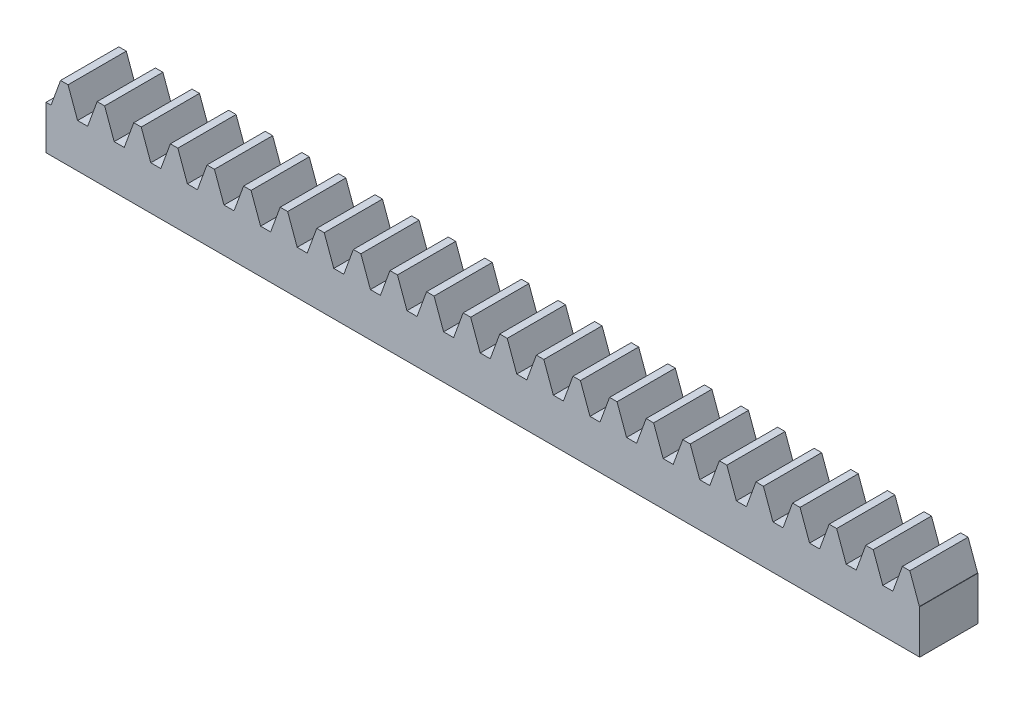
ISO-10303-21;
HEADER;
FILE_DESCRIPTION(('STEP AP214'),'2;1');
FILE_NAME('part.step','',(''),(''),'','','');
FILE_SCHEMA(('AUTOMOTIVE_DESIGN { 1 0 10303 214 1 1 1 1 }'));
ENDSEC;
DATA;
#1=APPLICATION_CONTEXT('core data for automotive mechanical design processes');
#2=APPLICATION_PROTOCOL_DEFINITION('international standard','automotive_design',2000,#1);
#3=PRODUCT_CONTEXT('',#1,'mechanical');
#4=PRODUCT('Part','Part','',(#3));
#5=PRODUCT_RELATED_PRODUCT_CATEGORY('part','',(#4));
#6=PRODUCT_DEFINITION_FORMATION('','',#4);
#7=PRODUCT_DEFINITION_CONTEXT('part definition',#1,'design');
#8=PRODUCT_DEFINITION('design','',#6,#7);
#9=PRODUCT_DEFINITION_SHAPE('','',#8);
#10=(LENGTH_UNIT() NAMED_UNIT(*) SI_UNIT(.MILLI.,.METRE.));
#11=(NAMED_UNIT(*) PLANE_ANGLE_UNIT() SI_UNIT($,.RADIAN.));
#12=(NAMED_UNIT(*) SI_UNIT($,.STERADIAN.) SOLID_ANGLE_UNIT());
#13=UNCERTAINTY_MEASURE_WITH_UNIT(LENGTH_MEASURE(1.E-05),#10,'distance_accuracy_value','');
#14=(GEOMETRIC_REPRESENTATION_CONTEXT(3) GLOBAL_UNCERTAINTY_ASSIGNED_CONTEXT((#13)) GLOBAL_UNIT_ASSIGNED_CONTEXT((#10,
#11,#12)) REPRESENTATION_CONTEXT('',''));
#15=CARTESIAN_POINT('',(0.,0.,0.));
#16=DIRECTION('',(0.,0.,1.));
#17=DIRECTION('',(1.,0.,0.));
#18=AXIS2_PLACEMENT_3D('',#15,#16,#17);
#19=CARTESIAN_POINT('',(0.,12.,-10.));
#20=DIRECTION('',(0.,1.,0.));
#21=DIRECTION('',(0.,0.,1.));
#22=AXIS2_PLACEMENT_3D('',#19,#20,#21);
#23=PLANE('',#22);
#24=DIRECTION('',(0.,0.,1.));
#25=VECTOR('',#24,1.);
#26=CARTESIAN_POINT('',(142.013525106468,12.,-10.));
#27=LINE('',#26,#25);
#28=CARTESIAN_POINT('',(142.013525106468,12.,-10.));
#29=VERTEX_POINT('',#28);
#30=CARTESIAN_POINT('',(142.013525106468,12.,0.));
#31=VERTEX_POINT('',#30);
#32=EDGE_CURVE('E694',#29,#31,#27,.T.);
#33=ORIENTED_EDGE('',*,*,#32,.F.);
#34=DIRECTION('',(-1.,0.,0.));
#35=VECTOR('',#34,1.);
#36=CARTESIAN_POINT('',(0.,12.,-10.));
#37=LINE('',#36,#35);
#38=CARTESIAN_POINT('',(140.729813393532,12.,-10.));
#39=VERTEX_POINT('',#38);
#40=EDGE_CURVE('E1253',#29,#39,#37,.T.);
#41=ORIENTED_EDGE('',*,*,#40,.T.);
#42=DIRECTION('',(0.,0.,-1.));
#43=VECTOR('',#42,1.);
#44=CARTESIAN_POINT('',(140.729813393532,12.,-10.));
#45=LINE('',#44,#43);
#46=CARTESIAN_POINT('',(140.729813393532,12.,0.));
#47=VERTEX_POINT('',#46);
#48=EDGE_CURVE('E714',#47,#39,#45,.T.);
#49=ORIENTED_EDGE('',*,*,#48,.F.);
#50=DIRECTION('',(-1.,0.,0.));
#51=VECTOR('',#50,1.);
#52=CARTESIAN_POINT('',(0.,12.,0.));
#53=LINE('',#52,#51);
#54=EDGE_CURVE('E1263',#31,#47,#53,.T.);
#55=ORIENTED_EDGE('',*,*,#54,.F.);
#56=EDGE_LOOP('',(#33,#41,#49,#55));
#57=FACE_BOUND('',#56,.T.);
#58=ADVANCED_FACE('F33',(#57),#23,.T.);
#59=DIRECTION('',(0.,0.,1.));
#60=VECTOR('',#59,1.);
#61=CARTESIAN_POINT('',(135.730339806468,12.,-10.));
#62=LINE('',#61,#60);
#63=CARTESIAN_POINT('',(135.730339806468,12.,-10.));
#64=VERTEX_POINT('',#63);
#65=CARTESIAN_POINT('',(135.730339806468,12.,0.));
#66=VERTEX_POINT('',#65);
#67=EDGE_CURVE('E718',#64,#66,#62,.T.);
#68=ORIENTED_EDGE('',*,*,#67,.F.);
#69=CARTESIAN_POINT('',(134.446628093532,12.,-10.));
#70=VERTEX_POINT('',#69);
#71=EDGE_CURVE('E1519',#64,#70,#37,.T.);
#72=ORIENTED_EDGE('',*,*,#71,.T.);
#73=DIRECTION('',(0.,0.,-1.));
#74=VECTOR('',#73,1.);
#75=CARTESIAN_POINT('',(134.446628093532,12.,-10.));
#76=LINE('',#75,#74);
#77=CARTESIAN_POINT('',(134.446628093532,12.,0.));
#78=VERTEX_POINT('',#77);
#79=EDGE_CURVE('E738',#78,#70,#76,.T.);
#80=ORIENTED_EDGE('',*,*,#79,.F.);
#81=EDGE_CURVE('E1348',#66,#78,#53,.T.);
#82=ORIENTED_EDGE('',*,*,#81,.F.);
#83=EDGE_LOOP('',(#68,#72,#80,#82));
#84=FACE_BOUND('',#83,.T.);
#85=ADVANCED_FACE('F1537',(#84),#23,.T.);
#86=DIRECTION('',(0.,0.,1.));
#87=VECTOR('',#86,1.);
#88=CARTESIAN_POINT('',(129.447154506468,12.,-10.));
#89=LINE('',#88,#87);
#90=CARTESIAN_POINT('',(129.447154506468,12.,-10.));
#91=VERTEX_POINT('',#90);
#92=CARTESIAN_POINT('',(129.447154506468,12.,0.));
#93=VERTEX_POINT('',#92);
#94=EDGE_CURVE('E742',#91,#93,#89,.T.);
#95=ORIENTED_EDGE('',*,*,#94,.F.);
#96=CARTESIAN_POINT('',(128.163442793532,12.,-10.));
#97=VERTEX_POINT('',#96);
#98=EDGE_CURVE('E1514',#91,#97,#37,.T.);
#99=ORIENTED_EDGE('',*,*,#98,.T.);
#100=DIRECTION('',(0.,0.,-1.));
#101=VECTOR('',#100,1.);
#102=CARTESIAN_POINT('',(128.163442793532,12.,-10.));
#103=LINE('',#102,#101);
#104=CARTESIAN_POINT('',(128.163442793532,12.,0.));
#105=VERTEX_POINT('',#104);
#106=EDGE_CURVE('E762',#105,#97,#103,.T.);
#107=ORIENTED_EDGE('',*,*,#106,.F.);
#108=EDGE_CURVE('E1349',#93,#105,#53,.T.);
#109=ORIENTED_EDGE('',*,*,#108,.F.);
#110=EDGE_LOOP('',(#95,#99,#107,#109));
#111=FACE_BOUND('',#110,.T.);
#112=ADVANCED_FACE('F1547',(#111),#23,.T.);
#113=DIRECTION('',(0.,0.,1.));
#114=VECTOR('',#113,1.);
#115=CARTESIAN_POINT('',(123.163969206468,12.,-10.));
#116=LINE('',#115,#114);
#117=CARTESIAN_POINT('',(123.163969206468,12.,-10.));
#118=VERTEX_POINT('',#117);
#119=CARTESIAN_POINT('',(123.163969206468,12.,0.));
#120=VERTEX_POINT('',#119);
#121=EDGE_CURVE('E766',#118,#120,#116,.T.);
#122=ORIENTED_EDGE('',*,*,#121,.F.);
#123=CARTESIAN_POINT('',(121.880257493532,12.,-10.));
#124=VERTEX_POINT('',#123);
#125=EDGE_CURVE('E1509',#118,#124,#37,.T.);
#126=ORIENTED_EDGE('',*,*,#125,.T.);
#127=DIRECTION('',(0.,0.,-1.));
#128=VECTOR('',#127,1.);
#129=CARTESIAN_POINT('',(121.880257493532,12.,-10.));
#130=LINE('',#129,#128);
#131=CARTESIAN_POINT('',(121.880257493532,12.,0.));
#132=VERTEX_POINT('',#131);
#133=EDGE_CURVE('E786',#132,#124,#130,.T.);
#134=ORIENTED_EDGE('',*,*,#133,.F.);
#135=EDGE_CURVE('E1352',#120,#132,#53,.T.);
#136=ORIENTED_EDGE('',*,*,#135,.F.);
#137=EDGE_LOOP('',(#122,#126,#134,#136));
#138=FACE_BOUND('',#137,.T.);
#139=ADVANCED_FACE('F1557',(#138),#23,.T.);
#140=DIRECTION('',(0.,0.,1.));
#141=VECTOR('',#140,1.);
#142=CARTESIAN_POINT('',(116.880783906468,12.,-10.));
#143=LINE('',#142,#141);
#144=CARTESIAN_POINT('',(116.880783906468,12.,-10.));
#145=VERTEX_POINT('',#144);
#146=CARTESIAN_POINT('',(116.880783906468,12.,0.));
#147=VERTEX_POINT('',#146);
#148=EDGE_CURVE('E790',#145,#147,#143,.T.);
#149=ORIENTED_EDGE('',*,*,#148,.F.);
#150=CARTESIAN_POINT('',(115.597072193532,12.,-10.));
#151=VERTEX_POINT('',#150);
#152=EDGE_CURVE('E1504',#145,#151,#37,.T.);
#153=ORIENTED_EDGE('',*,*,#152,.T.);
#154=DIRECTION('',(0.,0.,-1.));
#155=VECTOR('',#154,1.);
#156=CARTESIAN_POINT('',(115.597072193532,12.,-10.));
#157=LINE('',#156,#155);
#158=CARTESIAN_POINT('',(115.597072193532,12.,0.));
#159=VERTEX_POINT('',#158);
#160=EDGE_CURVE('E810',#159,#151,#157,.T.);
#161=ORIENTED_EDGE('',*,*,#160,.F.);
#162=EDGE_CURVE('E1355',#147,#159,#53,.T.);
#163=ORIENTED_EDGE('',*,*,#162,.F.);
#164=EDGE_LOOP('',(#149,#153,#161,#163));
#165=FACE_BOUND('',#164,.T.);
#166=ADVANCED_FACE('F1567',(#165),#23,.T.);
#167=DIRECTION('',(0.,0.,1.));
#168=VECTOR('',#167,1.);
#169=CARTESIAN_POINT('',(110.597598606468,12.,-10.));
#170=LINE('',#169,#168);
#171=CARTESIAN_POINT('',(110.597598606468,12.,-10.));
#172=VERTEX_POINT('',#171);
#173=CARTESIAN_POINT('',(110.597598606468,12.,0.));
#174=VERTEX_POINT('',#173);
#175=EDGE_CURVE('E814',#172,#174,#170,.T.);
#176=ORIENTED_EDGE('',*,*,#175,.F.);
#177=CARTESIAN_POINT('',(109.313886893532,12.,-10.));
#178=VERTEX_POINT('',#177);
#179=EDGE_CURVE('E1499',#172,#178,#37,.T.);
#180=ORIENTED_EDGE('',*,*,#179,.T.);
#181=DIRECTION('',(0.,0.,-1.));
#182=VECTOR('',#181,1.);
#183=CARTESIAN_POINT('',(109.313886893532,12.,-10.));
#184=LINE('',#183,#182);
#185=CARTESIAN_POINT('',(109.313886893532,12.,0.));
#186=VERTEX_POINT('',#185);
#187=EDGE_CURVE('E834',#186,#178,#184,.T.);
#188=ORIENTED_EDGE('',*,*,#187,.F.);
#189=EDGE_CURVE('E1358',#174,#186,#53,.T.);
#190=ORIENTED_EDGE('',*,*,#189,.F.);
#191=EDGE_LOOP('',(#176,#180,#188,#190));
#192=FACE_BOUND('',#191,.T.);
#193=ADVANCED_FACE('F1577',(#192),#23,.T.);
#194=DIRECTION('',(0.,0.,1.));
#195=VECTOR('',#194,1.);
#196=CARTESIAN_POINT('',(104.314413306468,12.,-10.));
#197=LINE('',#196,#195);
#198=CARTESIAN_POINT('',(104.314413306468,12.,-10.));
#199=VERTEX_POINT('',#198);
#200=CARTESIAN_POINT('',(104.314413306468,12.,0.));
#201=VERTEX_POINT('',#200);
#202=EDGE_CURVE('E838',#199,#201,#197,.T.);
#203=ORIENTED_EDGE('',*,*,#202,.F.);
#204=CARTESIAN_POINT('',(103.030701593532,12.,-10.));
#205=VERTEX_POINT('',#204);
#206=EDGE_CURVE('E1494',#199,#205,#37,.T.);
#207=ORIENTED_EDGE('',*,*,#206,.T.);
#208=DIRECTION('',(0.,0.,-1.));
#209=VECTOR('',#208,1.);
#210=CARTESIAN_POINT('',(103.030701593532,12.,-10.));
#211=LINE('',#210,#209);
#212=CARTESIAN_POINT('',(103.030701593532,12.,0.));
#213=VERTEX_POINT('',#212);
#214=EDGE_CURVE('E858',#213,#205,#211,.T.);
#215=ORIENTED_EDGE('',*,*,#214,.F.);
#216=EDGE_CURVE('E1361',#201,#213,#53,.T.);
#217=ORIENTED_EDGE('',*,*,#216,.F.);
#218=EDGE_LOOP('',(#203,#207,#215,#217));
#219=FACE_BOUND('',#218,.T.);
#220=ADVANCED_FACE('F1587',(#219),#23,.T.);
#221=DIRECTION('',(0.,0.,1.));
#222=VECTOR('',#221,1.);
#223=CARTESIAN_POINT('',(98.0312280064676,12.,-10.));
#224=LINE('',#223,#222);
#225=CARTESIAN_POINT('',(98.0312280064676,12.,-10.));
#226=VERTEX_POINT('',#225);
#227=CARTESIAN_POINT('',(98.0312280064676,12.,0.));
#228=VERTEX_POINT('',#227);
#229=EDGE_CURVE('E862',#226,#228,#224,.T.);
#230=ORIENTED_EDGE('',*,*,#229,.F.);
#231=CARTESIAN_POINT('',(96.7475162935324,12.,-10.));
#232=VERTEX_POINT('',#231);
#233=EDGE_CURVE('E1489',#226,#232,#37,.T.);
#234=ORIENTED_EDGE('',*,*,#233,.T.);
#235=DIRECTION('',(0.,0.,-1.));
#236=VECTOR('',#235,1.);
#237=CARTESIAN_POINT('',(96.7475162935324,12.,-10.));
#238=LINE('',#237,#236);
#239=CARTESIAN_POINT('',(96.7475162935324,12.,0.));
#240=VERTEX_POINT('',#239);
#241=EDGE_CURVE('E882',#240,#232,#238,.T.);
#242=ORIENTED_EDGE('',*,*,#241,.F.);
#243=EDGE_CURVE('E1364',#228,#240,#53,.T.);
#244=ORIENTED_EDGE('',*,*,#243,.F.);
#245=EDGE_LOOP('',(#230,#234,#242,#244));
#246=FACE_BOUND('',#245,.T.);
#247=ADVANCED_FACE('F1597',(#246),#23,.T.);
#248=DIRECTION('',(0.,0.,1.));
#249=VECTOR('',#248,1.);
#250=CARTESIAN_POINT('',(91.7480427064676,12.,-10.));
#251=LINE('',#250,#249);
#252=CARTESIAN_POINT('',(91.7480427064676,12.,-10.));
#253=VERTEX_POINT('',#252);
#254=CARTESIAN_POINT('',(91.7480427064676,12.,0.));
#255=VERTEX_POINT('',#254);
#256=EDGE_CURVE('E886',#253,#255,#251,.T.);
#257=ORIENTED_EDGE('',*,*,#256,.F.);
#258=CARTESIAN_POINT('',(90.4643309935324,12.,-10.));
#259=VERTEX_POINT('',#258);
#260=EDGE_CURVE('E1484',#253,#259,#37,.T.);
#261=ORIENTED_EDGE('',*,*,#260,.T.);
#262=DIRECTION('',(0.,0.,-1.));
#263=VECTOR('',#262,1.);
#264=CARTESIAN_POINT('',(90.4643309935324,12.,-10.));
#265=LINE('',#264,#263);
#266=CARTESIAN_POINT('',(90.4643309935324,12.,0.));
#267=VERTEX_POINT('',#266);
#268=EDGE_CURVE('E906',#267,#259,#265,.T.);
#269=ORIENTED_EDGE('',*,*,#268,.F.);
#270=EDGE_CURVE('E1367',#255,#267,#53,.T.);
#271=ORIENTED_EDGE('',*,*,#270,.F.);
#272=EDGE_LOOP('',(#257,#261,#269,#271));
#273=FACE_BOUND('',#272,.T.);
#274=ADVANCED_FACE('F1607',(#273),#23,.T.);
#275=DIRECTION('',(0.,0.,1.));
#276=VECTOR('',#275,1.);
#277=CARTESIAN_POINT('',(85.4648574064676,12.,-10.));
#278=LINE('',#277,#276);
#279=CARTESIAN_POINT('',(85.4648574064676,12.,-10.));
#280=VERTEX_POINT('',#279);
#281=CARTESIAN_POINT('',(85.4648574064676,12.,0.));
#282=VERTEX_POINT('',#281);
#283=EDGE_CURVE('E910',#280,#282,#278,.T.);
#284=ORIENTED_EDGE('',*,*,#283,.F.);
#285=CARTESIAN_POINT('',(84.1811456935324,12.,-10.));
#286=VERTEX_POINT('',#285);
#287=EDGE_CURVE('E1479',#280,#286,#37,.T.);
#288=ORIENTED_EDGE('',*,*,#287,.T.);
#289=DIRECTION('',(0.,0.,-1.));
#290=VECTOR('',#289,1.);
#291=CARTESIAN_POINT('',(84.1811456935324,12.,-10.));
#292=LINE('',#291,#290);
#293=CARTESIAN_POINT('',(84.1811456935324,12.,0.));
#294=VERTEX_POINT('',#293);
#295=EDGE_CURVE('E930',#294,#286,#292,.T.);
#296=ORIENTED_EDGE('',*,*,#295,.F.);
#297=EDGE_CURVE('E1370',#282,#294,#53,.T.);
#298=ORIENTED_EDGE('',*,*,#297,.F.);
#299=EDGE_LOOP('',(#284,#288,#296,#298));
#300=FACE_BOUND('',#299,.T.);
#301=ADVANCED_FACE('F1617',(#300),#23,.T.);
#302=DIRECTION('',(0.,0.,1.));
#303=VECTOR('',#302,1.);
#304=CARTESIAN_POINT('',(79.1816721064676,12.,-10.));
#305=LINE('',#304,#303);
#306=CARTESIAN_POINT('',(79.1816721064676,12.,-10.));
#307=VERTEX_POINT('',#306);
#308=CARTESIAN_POINT('',(79.1816721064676,12.,0.));
#309=VERTEX_POINT('',#308);
#310=EDGE_CURVE('E934',#307,#309,#305,.T.);
#311=ORIENTED_EDGE('',*,*,#310,.F.);
#312=CARTESIAN_POINT('',(77.8979603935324,12.,-10.));
#313=VERTEX_POINT('',#312);
#314=EDGE_CURVE('E1474',#307,#313,#37,.T.);
#315=ORIENTED_EDGE('',*,*,#314,.T.);
#316=DIRECTION('',(0.,0.,-1.));
#317=VECTOR('',#316,1.);
#318=CARTESIAN_POINT('',(77.8979603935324,12.,-10.));
#319=LINE('',#318,#317);
#320=CARTESIAN_POINT('',(77.8979603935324,12.,0.));
#321=VERTEX_POINT('',#320);
#322=EDGE_CURVE('E954',#321,#313,#319,.T.);
#323=ORIENTED_EDGE('',*,*,#322,.F.);
#324=EDGE_CURVE('E1373',#309,#321,#53,.T.);
#325=ORIENTED_EDGE('',*,*,#324,.F.);
#326=EDGE_LOOP('',(#311,#315,#323,#325));
#327=FACE_BOUND('',#326,.T.);
#328=ADVANCED_FACE('F1627',(#327),#23,.T.);
#329=DIRECTION('',(0.,0.,1.));
#330=VECTOR('',#329,1.);
#331=CARTESIAN_POINT('',(72.8984868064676,12.,-10.));
#332=LINE('',#331,#330);
#333=CARTESIAN_POINT('',(72.8984868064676,12.,-10.));
#334=VERTEX_POINT('',#333);
#335=CARTESIAN_POINT('',(72.8984868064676,12.,0.));
#336=VERTEX_POINT('',#335);
#337=EDGE_CURVE('E958',#334,#336,#332,.T.);
#338=ORIENTED_EDGE('',*,*,#337,.F.);
#339=CARTESIAN_POINT('',(71.6147750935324,12.,-10.));
#340=VERTEX_POINT('',#339);
#341=EDGE_CURVE('E1469',#334,#340,#37,.T.);
#342=ORIENTED_EDGE('',*,*,#341,.T.);
#343=DIRECTION('',(0.,0.,-1.));
#344=VECTOR('',#343,1.);
#345=CARTESIAN_POINT('',(71.6147750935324,12.,-10.));
#346=LINE('',#345,#344);
#347=CARTESIAN_POINT('',(71.6147750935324,12.,0.));
#348=VERTEX_POINT('',#347);
#349=EDGE_CURVE('E978',#348,#340,#346,.T.);
#350=ORIENTED_EDGE('',*,*,#349,.F.);
#351=EDGE_CURVE('E1376',#336,#348,#53,.T.);
#352=ORIENTED_EDGE('',*,*,#351,.F.);
#353=EDGE_LOOP('',(#338,#342,#350,#352));
#354=FACE_BOUND('',#353,.T.);
#355=ADVANCED_FACE('F1637',(#354),#23,.T.);
#356=DIRECTION('',(0.,0.,1.));
#357=VECTOR('',#356,1.);
#358=CARTESIAN_POINT('',(66.6153015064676,12.,-10.));
#359=LINE('',#358,#357);
#360=CARTESIAN_POINT('',(66.6153015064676,12.,-10.));
#361=VERTEX_POINT('',#360);
#362=CARTESIAN_POINT('',(66.6153015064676,12.,0.));
#363=VERTEX_POINT('',#362);
#364=EDGE_CURVE('E982',#361,#363,#359,.T.);
#365=ORIENTED_EDGE('',*,*,#364,.F.);
#366=CARTESIAN_POINT('',(65.3315897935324,12.,-10.));
#367=VERTEX_POINT('',#366);
#368=EDGE_CURVE('E1464',#361,#367,#37,.T.);
#369=ORIENTED_EDGE('',*,*,#368,.T.);
#370=DIRECTION('',(0.,0.,-1.));
#371=VECTOR('',#370,1.);
#372=CARTESIAN_POINT('',(65.3315897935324,12.,-10.));
#373=LINE('',#372,#371);
#374=CARTESIAN_POINT('',(65.3315897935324,12.,0.));
#375=VERTEX_POINT('',#374);
#376=EDGE_CURVE('E1002',#375,#367,#373,.T.);
#377=ORIENTED_EDGE('',*,*,#376,.F.);
#378=EDGE_CURVE('E1379',#363,#375,#53,.T.);
#379=ORIENTED_EDGE('',*,*,#378,.F.);
#380=EDGE_LOOP('',(#365,#369,#377,#379));
#381=FACE_BOUND('',#380,.T.);
#382=ADVANCED_FACE('F1647',(#381),#23,.T.);
#383=DIRECTION('',(0.,0.,1.));
#384=VECTOR('',#383,1.);
#385=CARTESIAN_POINT('',(60.3321162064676,12.,-10.));
#386=LINE('',#385,#384);
#387=CARTESIAN_POINT('',(60.3321162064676,12.,-10.));
#388=VERTEX_POINT('',#387);
#389=CARTESIAN_POINT('',(60.3321162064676,12.,0.));
#390=VERTEX_POINT('',#389);
#391=EDGE_CURVE('E1006',#388,#390,#386,.T.);
#392=ORIENTED_EDGE('',*,*,#391,.F.);
#393=CARTESIAN_POINT('',(59.0484044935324,12.,-10.));
#394=VERTEX_POINT('',#393);
#395=EDGE_CURVE('E1459',#388,#394,#37,.T.);
#396=ORIENTED_EDGE('',*,*,#395,.T.);
#397=DIRECTION('',(0.,0.,-1.));
#398=VECTOR('',#397,1.);
#399=CARTESIAN_POINT('',(59.0484044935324,12.,-10.));
#400=LINE('',#399,#398);
#401=CARTESIAN_POINT('',(59.0484044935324,12.,0.));
#402=VERTEX_POINT('',#401);
#403=EDGE_CURVE('E1026',#402,#394,#400,.T.);
#404=ORIENTED_EDGE('',*,*,#403,.F.);
#405=EDGE_CURVE('E1382',#390,#402,#53,.T.);
#406=ORIENTED_EDGE('',*,*,#405,.F.);
#407=EDGE_LOOP('',(#392,#396,#404,#406));
#408=FACE_BOUND('',#407,.T.);
#409=ADVANCED_FACE('F1657',(#408),#23,.T.);
#410=DIRECTION('',(0.,0.,1.));
#411=VECTOR('',#410,1.);
#412=CARTESIAN_POINT('',(54.0489309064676,12.,-10.));
#413=LINE('',#412,#411);
#414=CARTESIAN_POINT('',(54.0489309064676,12.,-10.));
#415=VERTEX_POINT('',#414);
#416=CARTESIAN_POINT('',(54.0489309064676,12.,0.));
#417=VERTEX_POINT('',#416);
#418=EDGE_CURVE('E1030',#415,#417,#413,.T.);
#419=ORIENTED_EDGE('',*,*,#418,.F.);
#420=CARTESIAN_POINT('',(52.7652191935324,12.,-10.));
#421=VERTEX_POINT('',#420);
#422=EDGE_CURVE('E1454',#415,#421,#37,.T.);
#423=ORIENTED_EDGE('',*,*,#422,.T.);
#424=DIRECTION('',(0.,0.,-1.));
#425=VECTOR('',#424,1.);
#426=CARTESIAN_POINT('',(52.7652191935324,12.,-10.));
#427=LINE('',#426,#425);
#428=CARTESIAN_POINT('',(52.7652191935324,12.,0.));
#429=VERTEX_POINT('',#428);
#430=EDGE_CURVE('E1050',#429,#421,#427,.T.);
#431=ORIENTED_EDGE('',*,*,#430,.F.);
#432=EDGE_CURVE('E1385',#417,#429,#53,.T.);
#433=ORIENTED_EDGE('',*,*,#432,.F.);
#434=EDGE_LOOP('',(#419,#423,#431,#433));
#435=FACE_BOUND('',#434,.T.);
#436=ADVANCED_FACE('F1667',(#435),#23,.T.);
#437=DIRECTION('',(0.,0.,1.));
#438=VECTOR('',#437,1.);
#439=CARTESIAN_POINT('',(47.7657456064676,12.,-10.));
#440=LINE('',#439,#438);
#441=CARTESIAN_POINT('',(47.7657456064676,12.,-10.));
#442=VERTEX_POINT('',#441);
#443=CARTESIAN_POINT('',(47.7657456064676,12.,0.));
#444=VERTEX_POINT('',#443);
#445=EDGE_CURVE('E1054',#442,#444,#440,.T.);
#446=ORIENTED_EDGE('',*,*,#445,.F.);
#447=CARTESIAN_POINT('',(46.4820338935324,12.,-10.));
#448=VERTEX_POINT('',#447);
#449=EDGE_CURVE('E1449',#442,#448,#37,.T.);
#450=ORIENTED_EDGE('',*,*,#449,.T.);
#451=DIRECTION('',(0.,0.,-1.));
#452=VECTOR('',#451,1.);
#453=CARTESIAN_POINT('',(46.4820338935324,12.,-10.));
#454=LINE('',#453,#452);
#455=CARTESIAN_POINT('',(46.4820338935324,12.,0.));
#456=VERTEX_POINT('',#455);
#457=EDGE_CURVE('E1074',#456,#448,#454,.T.);
#458=ORIENTED_EDGE('',*,*,#457,.F.);
#459=EDGE_CURVE('E1388',#444,#456,#53,.T.);
#460=ORIENTED_EDGE('',*,*,#459,.F.);
#461=EDGE_LOOP('',(#446,#450,#458,#460));
#462=FACE_BOUND('',#461,.T.);
#463=ADVANCED_FACE('F1677',(#462),#23,.T.);
#464=DIRECTION('',(0.,0.,1.));
#465=VECTOR('',#464,1.);
#466=CARTESIAN_POINT('',(41.4825603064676,12.,-10.));
#467=LINE('',#466,#465);
#468=CARTESIAN_POINT('',(41.4825603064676,12.,-10.));
#469=VERTEX_POINT('',#468);
#470=CARTESIAN_POINT('',(41.4825603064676,12.,0.));
#471=VERTEX_POINT('',#470);
#472=EDGE_CURVE('E1078',#469,#471,#467,.T.);
#473=ORIENTED_EDGE('',*,*,#472,.F.);
#474=CARTESIAN_POINT('',(40.1988485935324,12.,-10.));
#475=VERTEX_POINT('',#474);
#476=EDGE_CURVE('E1444',#469,#475,#37,.T.);
#477=ORIENTED_EDGE('',*,*,#476,.T.);
#478=DIRECTION('',(0.,0.,-1.));
#479=VECTOR('',#478,1.);
#480=CARTESIAN_POINT('',(40.1988485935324,12.,-10.));
#481=LINE('',#480,#479);
#482=CARTESIAN_POINT('',(40.1988485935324,12.,0.));
#483=VERTEX_POINT('',#482);
#484=EDGE_CURVE('E1098',#483,#475,#481,.T.);
#485=ORIENTED_EDGE('',*,*,#484,.F.);
#486=EDGE_CURVE('E1391',#471,#483,#53,.T.);
#487=ORIENTED_EDGE('',*,*,#486,.F.);
#488=EDGE_LOOP('',(#473,#477,#485,#487));
#489=FACE_BOUND('',#488,.T.);
#490=ADVANCED_FACE('F1687',(#489),#23,.T.);
#491=DIRECTION('',(0.,0.,1.));
#492=VECTOR('',#491,1.);
#493=CARTESIAN_POINT('',(35.1993750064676,12.,-10.));
#494=LINE('',#493,#492);
#495=CARTESIAN_POINT('',(35.1993750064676,12.,-10.));
#496=VERTEX_POINT('',#495);
#497=CARTESIAN_POINT('',(35.1993750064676,12.,0.));
#498=VERTEX_POINT('',#497);
#499=EDGE_CURVE('E1102',#496,#498,#494,.T.);
#500=ORIENTED_EDGE('',*,*,#499,.F.);
#501=CARTESIAN_POINT('',(33.9156632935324,12.,-10.));
#502=VERTEX_POINT('',#501);
#503=EDGE_CURVE('E1439',#496,#502,#37,.T.);
#504=ORIENTED_EDGE('',*,*,#503,.T.);
#505=DIRECTION('',(0.,0.,-1.));
#506=VECTOR('',#505,1.);
#507=CARTESIAN_POINT('',(33.9156632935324,12.,-10.));
#508=LINE('',#507,#506);
#509=CARTESIAN_POINT('',(33.9156632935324,12.,0.));
#510=VERTEX_POINT('',#509);
#511=EDGE_CURVE('E1122',#510,#502,#508,.T.);
#512=ORIENTED_EDGE('',*,*,#511,.F.);
#513=EDGE_CURVE('E1394',#498,#510,#53,.T.);
#514=ORIENTED_EDGE('',*,*,#513,.F.);
#515=EDGE_LOOP('',(#500,#504,#512,#514));
#516=FACE_BOUND('',#515,.T.);
#517=ADVANCED_FACE('F1697',(#516),#23,.T.);
#518=DIRECTION('',(0.,0.,1.));
#519=VECTOR('',#518,1.);
#520=CARTESIAN_POINT('',(28.9161897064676,12.,-10.));
#521=LINE('',#520,#519);
#522=CARTESIAN_POINT('',(28.9161897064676,12.,-10.));
#523=VERTEX_POINT('',#522);
#524=CARTESIAN_POINT('',(28.9161897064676,12.,0.));
#525=VERTEX_POINT('',#524);
#526=EDGE_CURVE('E1126',#523,#525,#521,.T.);
#527=ORIENTED_EDGE('',*,*,#526,.F.);
#528=CARTESIAN_POINT('',(27.6324779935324,12.,-10.));
#529=VERTEX_POINT('',#528);
#530=EDGE_CURVE('E1434',#523,#529,#37,.T.);
#531=ORIENTED_EDGE('',*,*,#530,.T.);
#532=DIRECTION('',(0.,0.,-1.));
#533=VECTOR('',#532,1.);
#534=CARTESIAN_POINT('',(27.6324779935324,12.,-10.));
#535=LINE('',#534,#533);
#536=CARTESIAN_POINT('',(27.6324779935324,12.,0.));
#537=VERTEX_POINT('',#536);
#538=EDGE_CURVE('E1146',#537,#529,#535,.T.);
#539=ORIENTED_EDGE('',*,*,#538,.F.);
#540=EDGE_CURVE('E1397',#525,#537,#53,.T.);
#541=ORIENTED_EDGE('',*,*,#540,.F.);
#542=EDGE_LOOP('',(#527,#531,#539,#541));
#543=FACE_BOUND('',#542,.T.);
#544=ADVANCED_FACE('F1707',(#543),#23,.T.);
#545=DIRECTION('',(0.,0.,1.));
#546=VECTOR('',#545,1.);
#547=CARTESIAN_POINT('',(22.6330044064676,12.,-10.));
#548=LINE('',#547,#546);
#549=CARTESIAN_POINT('',(22.6330044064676,12.,-10.));
#550=VERTEX_POINT('',#549);
#551=CARTESIAN_POINT('',(22.6330044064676,12.,0.));
#552=VERTEX_POINT('',#551);
#553=EDGE_CURVE('E1150',#550,#552,#548,.T.);
#554=ORIENTED_EDGE('',*,*,#553,.F.);
#555=CARTESIAN_POINT('',(21.3492926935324,12.,-10.));
#556=VERTEX_POINT('',#555);
#557=EDGE_CURVE('E1429',#550,#556,#37,.T.);
#558=ORIENTED_EDGE('',*,*,#557,.T.);
#559=DIRECTION('',(0.,0.,-1.));
#560=VECTOR('',#559,1.);
#561=CARTESIAN_POINT('',(21.3492926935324,12.,-10.));
#562=LINE('',#561,#560);
#563=CARTESIAN_POINT('',(21.3492926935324,12.,0.));
#564=VERTEX_POINT('',#563);
#565=EDGE_CURVE('E1170',#564,#556,#562,.T.);
#566=ORIENTED_EDGE('',*,*,#565,.F.);
#567=EDGE_CURVE('E1400',#552,#564,#53,.T.);
#568=ORIENTED_EDGE('',*,*,#567,.F.);
#569=EDGE_LOOP('',(#554,#558,#566,#568));
#570=FACE_BOUND('',#569,.T.);
#571=ADVANCED_FACE('F1717',(#570),#23,.T.);
#572=DIRECTION('',(0.,0.,1.));
#573=VECTOR('',#572,1.);
#574=CARTESIAN_POINT('',(16.3498191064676,12.,-10.));
#575=LINE('',#574,#573);
#576=CARTESIAN_POINT('',(16.3498191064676,12.,-10.));
#577=VERTEX_POINT('',#576);
#578=CARTESIAN_POINT('',(16.3498191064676,12.,0.));
#579=VERTEX_POINT('',#578);
#580=EDGE_CURVE('E1174',#577,#579,#575,.T.);
#581=ORIENTED_EDGE('',*,*,#580,.F.);
#582=CARTESIAN_POINT('',(15.0661073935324,12.,-10.));
#583=VERTEX_POINT('',#582);
#584=EDGE_CURVE('E1424',#577,#583,#37,.T.);
#585=ORIENTED_EDGE('',*,*,#584,.T.);
#586=DIRECTION('',(0.,0.,-1.));
#587=VECTOR('',#586,1.);
#588=CARTESIAN_POINT('',(15.0661073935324,12.,-10.));
#589=LINE('',#588,#587);
#590=CARTESIAN_POINT('',(15.0661073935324,12.,0.));
#591=VERTEX_POINT('',#590);
#592=EDGE_CURVE('E1194',#591,#583,#589,.T.);
#593=ORIENTED_EDGE('',*,*,#592,.F.);
#594=EDGE_CURVE('E1403',#579,#591,#53,.T.);
#595=ORIENTED_EDGE('',*,*,#594,.F.);
#596=EDGE_LOOP('',(#581,#585,#593,#595));
#597=FACE_BOUND('',#596,.T.);
#598=ADVANCED_FACE('F1727',(#597),#23,.T.);
#599=DIRECTION('',(0.,0.,1.));
#600=VECTOR('',#599,1.);
#601=CARTESIAN_POINT('',(10.0666338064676,12.,-10.));
#602=LINE('',#601,#600);
#603=CARTESIAN_POINT('',(10.0666338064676,12.,-10.));
#604=VERTEX_POINT('',#603);
#605=CARTESIAN_POINT('',(10.0666338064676,12.,0.));
#606=VERTEX_POINT('',#605);
#607=EDGE_CURVE('E1198',#604,#606,#602,.T.);
#608=ORIENTED_EDGE('',*,*,#607,.F.);
#609=CARTESIAN_POINT('',(8.78292209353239,12.,-10.));
#610=VERTEX_POINT('',#609);
#611=EDGE_CURVE('E1423',#604,#610,#37,.T.);
#612=ORIENTED_EDGE('',*,*,#611,.T.);
#613=DIRECTION('',(0.,0.,-1.));
#614=VECTOR('',#613,1.);
#615=CARTESIAN_POINT('',(8.78292209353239,12.,-10.));
#616=LINE('',#615,#614);
#617=CARTESIAN_POINT('',(8.78292209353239,12.,0.));
#618=VERTEX_POINT('',#617);
#619=EDGE_CURVE('E1218',#618,#610,#616,.T.);
#620=ORIENTED_EDGE('',*,*,#619,.F.);
#621=EDGE_CURVE('E1406',#606,#618,#53,.T.);
#622=ORIENTED_EDGE('',*,*,#621,.F.);
#623=EDGE_LOOP('',(#608,#612,#620,#622));
#624=FACE_BOUND('',#623,.T.);
#625=ADVANCED_FACE('F1737',(#624),#23,.T.);
#626=DIRECTION('',(0.,0.,1.));
#627=VECTOR('',#626,1.);
#628=CARTESIAN_POINT('',(3.78344850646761,12.,-10.));
#629=LINE('',#628,#627);
#630=CARTESIAN_POINT('',(3.78344850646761,12.,-10.));
#631=VERTEX_POINT('',#630);
#632=CARTESIAN_POINT('',(3.78344850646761,12.,0.));
#633=VERTEX_POINT('',#632);
#634=EDGE_CURVE('E1222',#631,#633,#629,.T.);
#635=ORIENTED_EDGE('',*,*,#634,.F.);
#636=CARTESIAN_POINT('',(2.49973679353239,12.,-10.));
#637=VERTEX_POINT('',#636);
#638=EDGE_CURVE('E1250',#631,#637,#37,.T.);
#639=ORIENTED_EDGE('',*,*,#638,.T.);
#640=DIRECTION('',(0.,0.,-1.));
#641=VECTOR('',#640,1.);
#642=CARTESIAN_POINT('',(2.49973679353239,12.,-10.));
#643=LINE('',#642,#641);
#644=CARTESIAN_POINT('',(2.49973679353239,12.,0.));
#645=VERTEX_POINT('',#644);
#646=EDGE_CURVE('E1238',#645,#637,#643,.T.);
#647=ORIENTED_EDGE('',*,*,#646,.F.);
#648=EDGE_CURVE('E1261',#633,#645,#53,.T.);
#649=ORIENTED_EDGE('',*,*,#648,.F.);
#650=EDGE_LOOP('',(#635,#639,#647,#649));
#651=FACE_BOUND('',#650,.T.);
#652=ADVANCED_FACE('F1421',(#651),#23,.T.);
#653=CARTESIAN_POINT('',(0.,0.,-10.));
#654=DIRECTION('',(-1.,0.,0.));
#655=DIRECTION('',(0.,0.,1.));
#656=AXIS2_PLACEMENT_3D('',#653,#654,#655);
#657=PLANE('',#656);
#658=DIRECTION('',(0.,0.,1.));
#659=VECTOR('',#658,1.);
#660=CARTESIAN_POINT('',(0.,7.5,-10.));
#661=LINE('',#660,#659);
#662=CARTESIAN_POINT('',(0.,7.5,-10.));
#663=VERTEX_POINT('',#662);
#664=CARTESIAN_POINT('',(0.,7.5,0.));
#665=VERTEX_POINT('',#664);
#666=EDGE_CURVE('E1236',#663,#665,#661,.T.);
#667=ORIENTED_EDGE('',*,*,#666,.F.);
#668=DIRECTION('',(0.,-1.,0.));
#669=VECTOR('',#668,1.);
#670=CARTESIAN_POINT('',(0.,0.,-10.));
#671=LINE('',#670,#669);
#672=CARTESIAN_POINT('',(0.,0.,-10.));
#673=VERTEX_POINT('',#672);
#674=EDGE_CURVE('E1242',#663,#673,#671,.T.);
#675=ORIENTED_EDGE('',*,*,#674,.T.);
#676=DIRECTION('',(0.,0.,1.));
#677=VECTOR('',#676,1.);
#678=CARTESIAN_POINT('',(0.,0.,-10.));
#679=LINE('',#678,#677);
#680=CARTESIAN_POINT('',(0.,0.,0.));
#681=VERTEX_POINT('',#680);
#682=EDGE_CURVE('E1252',#673,#681,#679,.T.);
#683=ORIENTED_EDGE('',*,*,#682,.T.);
#684=DIRECTION('',(0.,-1.,0.));
#685=VECTOR('',#684,1.);
#686=CARTESIAN_POINT('',(0.,0.,0.));
#687=LINE('',#686,#685);
#688=EDGE_CURVE('E1241',#665,#681,#687,.T.);
#689=ORIENTED_EDGE('',*,*,#688,.F.);
#690=EDGE_LOOP('',(#667,#675,#683,#689));
#691=FACE_BOUND('',#690,.T.);
#692=ADVANCED_FACE('F35',(#691),#657,.T.);
#693=DIRECTION('',(0.,0.,1.));
#694=VECTOR('',#693,1.);
#695=CARTESIAN_POINT('',(148.296710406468,12.,-10.));
#696=LINE('',#695,#694);
#697=CARTESIAN_POINT('',(148.296710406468,12.,-10.));
#698=VERTEX_POINT('',#697);
#699=CARTESIAN_POINT('',(148.296710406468,12.,0.));
#700=VERTEX_POINT('',#699);
#701=EDGE_CURVE('E673',#698,#700,#696,.T.);
#702=ORIENTED_EDGE('',*,*,#701,.F.);
#703=CARTESIAN_POINT('',(147.012998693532,12.,-10.));
#704=VERTEX_POINT('',#703);
#705=EDGE_CURVE('E667',#698,#704,#37,.T.);
#706=ORIENTED_EDGE('',*,*,#705,.T.);
#707=DIRECTION('',(0.,0.,-1.));
#708=VECTOR('',#707,1.);
#709=CARTESIAN_POINT('',(147.012998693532,12.,-10.));
#710=LINE('',#709,#708);
#711=CARTESIAN_POINT('',(147.012998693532,12.,0.));
#712=VERTEX_POINT('',#711);
#713=EDGE_CURVE('E690',#712,#704,#710,.T.);
#714=ORIENTED_EDGE('',*,*,#713,.F.);
#715=EDGE_CURVE('E1245',#700,#712,#53,.T.);
#716=ORIENTED_EDGE('',*,*,#715,.F.);
#717=EDGE_LOOP('',(#702,#706,#714,#716));
#718=FACE_BOUND('',#717,.T.);
#719=ADVANCED_FACE('F1760',(#718),#23,.T.);
#720=CARTESIAN_POINT('',(150.,0.,-10.));
#721=DIRECTION('',(1.,0.,0.));
#722=DIRECTION('',(0.,0.,-1.));
#723=AXIS2_PLACEMENT_3D('',#720,#721,#722);
#724=PLANE('',#723);
#725=DIRECTION('',(0.,0.,-1.));
#726=VECTOR('',#725,1.);
#727=CARTESIAN_POINT('',(150.,7.5,-10.));
#728=LINE('',#727,#726);
#729=CARTESIAN_POINT('',(150.,7.5,0.));
#730=VERTEX_POINT('',#729);
#731=CARTESIAN_POINT('',(150.,7.5,-10.));
#732=VERTEX_POINT('',#731);
#733=EDGE_CURVE('E654',#730,#732,#728,.T.);
#734=ORIENTED_EDGE('',*,*,#733,.F.);
#735=DIRECTION('',(0.,1.,0.));
#736=VECTOR('',#735,1.);
#737=CARTESIAN_POINT('',(150.,0.,0.));
#738=LINE('',#737,#736);
#739=CARTESIAN_POINT('',(150.,0.,0.));
#740=VERTEX_POINT('',#739);
#741=EDGE_CURVE('E1258',#740,#730,#738,.T.);
#742=ORIENTED_EDGE('',*,*,#741,.F.);
#743=DIRECTION('',(0.,0.,1.));
#744=VECTOR('',#743,1.);
#745=CARTESIAN_POINT('',(150.,0.,-10.));
#746=LINE('',#745,#744);
#747=CARTESIAN_POINT('',(150.,0.,-10.));
#748=VERTEX_POINT('',#747);
#749=EDGE_CURVE('E1264',#748,#740,#746,.T.);
#750=ORIENTED_EDGE('',*,*,#749,.F.);
#751=DIRECTION('',(0.,1.,0.));
#752=VECTOR('',#751,1.);
#753=CARTESIAN_POINT('',(150.,0.,-10.));
#754=LINE('',#753,#752);
#755=EDGE_CURVE('E1248',#748,#732,#754,.T.);
#756=ORIENTED_EDGE('',*,*,#755,.T.);
#757=EDGE_LOOP('',(#734,#742,#750,#756));
#758=FACE_BOUND('',#757,.T.);
#759=ADVANCED_FACE('F1767',(#758),#724,.T.);
#760=CARTESIAN_POINT('',(0.,0.,-10.));
#761=DIRECTION('',(0.,-1.,0.));
#762=DIRECTION('',(0.,0.,-1.));
#763=AXIS2_PLACEMENT_3D('',#760,#761,#762);
#764=PLANE('',#763);
#765=DIRECTION('',(1.,0.,0.));
#766=VECTOR('',#765,1.);
#767=CARTESIAN_POINT('',(0.,0.,0.));
#768=LINE('',#767,#766);
#769=EDGE_CURVE('E1255',#681,#740,#768,.T.);
#770=ORIENTED_EDGE('',*,*,#769,.F.);
#771=ORIENTED_EDGE('',*,*,#682,.F.);
#772=DIRECTION('',(1.,0.,0.));
#773=VECTOR('',#772,1.);
#774=CARTESIAN_POINT('',(0.,0.,-10.));
#775=LINE('',#774,#773);
#776=EDGE_CURVE('E1244',#673,#748,#775,.T.);
#777=ORIENTED_EDGE('',*,*,#776,.T.);
#778=ORIENTED_EDGE('',*,*,#749,.T.);
#779=EDGE_LOOP('',(#770,#771,#777,#778));
#780=FACE_BOUND('',#779,.T.);
#781=ADVANCED_FACE('F1773',(#780),#764,.T.);
#782=CARTESIAN_POINT('',(0.,12.,-10.));
#783=DIRECTION('',(0.,0.,-1.));
#784=DIRECTION('',(-1.,0.,0.));
#785=AXIS2_PLACEMENT_3D('',#782,#783,#784);
#786=PLANE('',#785);
#787=DIRECTION('',(0.342020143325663,-0.939692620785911,0.));
#788=VECTOR('',#787,1.);
#789=CARTESIAN_POINT('',(148.287465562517,12.0254,-10.));
#790=LINE('',#789,#788);
#791=CARTESIAN_POINT('',(149.934576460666,7.5,-10.));
#792=VERTEX_POINT('',#791);
#793=EDGE_CURVE('E651',#698,#792,#790,.T.);
#794=ORIENTED_EDGE('',*,*,#793,.T.);
#795=DIRECTION('',(1.,0.,0.));
#796=VECTOR('',#795,1.);
#797=CARTESIAN_POINT('',(151.658317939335,7.5,-10.));
#798=LINE('',#797,#796);
#799=EDGE_CURVE('E655',#792,#732,#798,.T.);
#800=ORIENTED_EDGE('',*,*,#799,.T.);
#801=ORIENTED_EDGE('',*,*,#755,.F.);
#802=ORIENTED_EDGE('',*,*,#776,.F.);
#803=ORIENTED_EDGE('',*,*,#674,.F.);
#804=DIRECTION('',(1.,0.,0.));
#805=VECTOR('',#804,1.);
#806=CARTESIAN_POINT('',(0.861870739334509,7.5,-10.));
#807=LINE('',#806,#805);
#808=CARTESIAN_POINT('',(0.861870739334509,7.5,-10.));
#809=VERTEX_POINT('',#808);
#810=EDGE_CURVE('E1225',#663,#809,#807,.T.);
#811=ORIENTED_EDGE('',*,*,#810,.T.);
#812=DIRECTION('',(0.342020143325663,0.939692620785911,0.));
#813=VECTOR('',#812,1.);
#814=CARTESIAN_POINT('',(2.50898163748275,12.0254,-10.));
#815=LINE('',#814,#813);
#816=EDGE_CURVE('E1228',#809,#637,#815,.T.);
#817=ORIENTED_EDGE('',*,*,#816,.T.);
#818=ORIENTED_EDGE('',*,*,#638,.F.);
#819=DIRECTION('',(0.342020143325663,-0.939692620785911,0.));
#820=VECTOR('',#819,1.);
#821=CARTESIAN_POINT('',(3.77420366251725,12.0254,-10.));
#822=LINE('',#821,#820);
#823=CARTESIAN_POINT('',(5.42131456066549,7.5,-10.));
#824=VERTEX_POINT('',#823);
#825=EDGE_CURVE('E1201',#631,#824,#822,.T.);
#826=ORIENTED_EDGE('',*,*,#825,.T.);
#827=DIRECTION('',(1.,0.,0.));
#828=VECTOR('',#827,1.);
#829=CARTESIAN_POINT('',(7.14505603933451,7.5,-10.));
#830=LINE('',#829,#828);
#831=CARTESIAN_POINT('',(7.14505603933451,7.5,-10.));
#832=VERTEX_POINT('',#831);
#833=EDGE_CURVE('E1204',#824,#832,#830,.T.);
#834=ORIENTED_EDGE('',*,*,#833,.T.);
#835=DIRECTION('',(0.342020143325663,0.939692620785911,0.));
#836=VECTOR('',#835,1.);
#837=CARTESIAN_POINT('',(8.79216693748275,12.0254,-10.));
#838=LINE('',#837,#836);
#839=EDGE_CURVE('E1208',#832,#610,#838,.T.);
#840=ORIENTED_EDGE('',*,*,#839,.T.);
#841=ORIENTED_EDGE('',*,*,#611,.F.);
#842=DIRECTION('',(0.342020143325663,-0.939692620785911,0.));
#843=VECTOR('',#842,1.);
#844=CARTESIAN_POINT('',(10.0573889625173,12.0254,-10.));
#845=LINE('',#844,#843);
#846=CARTESIAN_POINT('',(11.7044998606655,7.5,-10.));
#847=VERTEX_POINT('',#846);
#848=EDGE_CURVE('E1177',#604,#847,#845,.T.);
#849=ORIENTED_EDGE('',*,*,#848,.T.);
#850=DIRECTION('',(1.,0.,0.));
#851=VECTOR('',#850,1.);
#852=CARTESIAN_POINT('',(13.4282413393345,7.5,-10.));
#853=LINE('',#852,#851);
#854=CARTESIAN_POINT('',(13.4282413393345,7.5,-10.));
#855=VERTEX_POINT('',#854);
#856=EDGE_CURVE('E1180',#847,#855,#853,.T.);
#857=ORIENTED_EDGE('',*,*,#856,.T.);
#858=DIRECTION('',(0.342020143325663,0.939692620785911,0.));
#859=VECTOR('',#858,1.);
#860=CARTESIAN_POINT('',(15.0753522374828,12.0254,-10.));
#861=LINE('',#860,#859);
#862=EDGE_CURVE('E1184',#855,#583,#861,.T.);
#863=ORIENTED_EDGE('',*,*,#862,.T.);
#864=ORIENTED_EDGE('',*,*,#584,.F.);
#865=DIRECTION('',(0.342020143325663,-0.939692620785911,0.));
#866=VECTOR('',#865,1.);
#867=CARTESIAN_POINT('',(16.3405742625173,12.0254,-10.));
#868=LINE('',#867,#866);
#869=CARTESIAN_POINT('',(17.9876851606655,7.5,-10.));
#870=VERTEX_POINT('',#869);
#871=EDGE_CURVE('E1153',#577,#870,#868,.T.);
#872=ORIENTED_EDGE('',*,*,#871,.T.);
#873=DIRECTION('',(1.,0.,0.));
#874=VECTOR('',#873,1.);
#875=CARTESIAN_POINT('',(19.7114266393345,7.5,-10.));
#876=LINE('',#875,#874);
#877=CARTESIAN_POINT('',(19.7114266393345,7.5,-10.));
#878=VERTEX_POINT('',#877);
#879=EDGE_CURVE('E1156',#870,#878,#876,.T.);
#880=ORIENTED_EDGE('',*,*,#879,.T.);
#881=DIRECTION('',(0.342020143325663,0.939692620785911,0.));
#882=VECTOR('',#881,1.);
#883=CARTESIAN_POINT('',(21.3585375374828,12.0254,-10.));
#884=LINE('',#883,#882);
#885=EDGE_CURVE('E1160',#878,#556,#884,.T.);
#886=ORIENTED_EDGE('',*,*,#885,.T.);
#887=ORIENTED_EDGE('',*,*,#557,.F.);
#888=DIRECTION('',(0.342020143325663,-0.939692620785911,0.));
#889=VECTOR('',#888,1.);
#890=CARTESIAN_POINT('',(22.6237595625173,12.0254,-10.));
#891=LINE('',#890,#889);
#892=CARTESIAN_POINT('',(24.2708704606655,7.5,-10.));
#893=VERTEX_POINT('',#892);
#894=EDGE_CURVE('E1129',#550,#893,#891,.T.);
#895=ORIENTED_EDGE('',*,*,#894,.T.);
#896=DIRECTION('',(1.,0.,0.));
#897=VECTOR('',#896,1.);
#898=CARTESIAN_POINT('',(25.9946119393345,7.5,-10.));
#899=LINE('',#898,#897);
#900=CARTESIAN_POINT('',(25.9946119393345,7.5,-10.));
#901=VERTEX_POINT('',#900);
#902=EDGE_CURVE('E1132',#893,#901,#899,.T.);
#903=ORIENTED_EDGE('',*,*,#902,.T.);
#904=DIRECTION('',(0.342020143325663,0.939692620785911,0.));
#905=VECTOR('',#904,1.);
#906=CARTESIAN_POINT('',(27.6417228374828,12.0254,-10.));
#907=LINE('',#906,#905);
#908=EDGE_CURVE('E1136',#901,#529,#907,.T.);
#909=ORIENTED_EDGE('',*,*,#908,.T.);
#910=ORIENTED_EDGE('',*,*,#530,.F.);
#911=DIRECTION('',(0.342020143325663,-0.939692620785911,0.));
#912=VECTOR('',#911,1.);
#913=CARTESIAN_POINT('',(28.9069448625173,12.0254,-10.));
#914=LINE('',#913,#912);
#915=CARTESIAN_POINT('',(30.5540557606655,7.5,-10.));
#916=VERTEX_POINT('',#915);
#917=EDGE_CURVE('E1105',#523,#916,#914,.T.);
#918=ORIENTED_EDGE('',*,*,#917,.T.);
#919=DIRECTION('',(1.,0.,0.));
#920=VECTOR('',#919,1.);
#921=CARTESIAN_POINT('',(32.2777972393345,7.5,-10.));
#922=LINE('',#921,#920);
#923=CARTESIAN_POINT('',(32.2777972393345,7.5,-10.));
#924=VERTEX_POINT('',#923);
#925=EDGE_CURVE('E1108',#916,#924,#922,.T.);
#926=ORIENTED_EDGE('',*,*,#925,.T.);
#927=DIRECTION('',(0.342020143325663,0.939692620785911,0.));
#928=VECTOR('',#927,1.);
#929=CARTESIAN_POINT('',(33.9249081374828,12.0254,-10.));
#930=LINE('',#929,#928);
#931=EDGE_CURVE('E1112',#924,#502,#930,.T.);
#932=ORIENTED_EDGE('',*,*,#931,.T.);
#933=ORIENTED_EDGE('',*,*,#503,.F.);
#934=DIRECTION('',(0.342020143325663,-0.939692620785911,0.));
#935=VECTOR('',#934,1.);
#936=CARTESIAN_POINT('',(35.1901301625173,12.0254,-10.));
#937=LINE('',#936,#935);
#938=CARTESIAN_POINT('',(36.8372410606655,7.5,-10.));
#939=VERTEX_POINT('',#938);
#940=EDGE_CURVE('E1081',#496,#939,#937,.T.);
#941=ORIENTED_EDGE('',*,*,#940,.T.);
#942=DIRECTION('',(1.,0.,0.));
#943=VECTOR('',#942,1.);
#944=CARTESIAN_POINT('',(38.5609825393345,7.5,-10.));
#945=LINE('',#944,#943);
#946=CARTESIAN_POINT('',(38.5609825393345,7.5,-10.));
#947=VERTEX_POINT('',#946);
#948=EDGE_CURVE('E1084',#939,#947,#945,.T.);
#949=ORIENTED_EDGE('',*,*,#948,.T.);
#950=DIRECTION('',(0.342020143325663,0.939692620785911,0.));
#951=VECTOR('',#950,1.);
#952=CARTESIAN_POINT('',(40.2080934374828,12.0254,-10.));
#953=LINE('',#952,#951);
#954=EDGE_CURVE('E1088',#947,#475,#953,.T.);
#955=ORIENTED_EDGE('',*,*,#954,.T.);
#956=ORIENTED_EDGE('',*,*,#476,.F.);
#957=DIRECTION('',(0.342020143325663,-0.939692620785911,0.));
#958=VECTOR('',#957,1.);
#959=CARTESIAN_POINT('',(41.4733154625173,12.0254,-10.));
#960=LINE('',#959,#958);
#961=CARTESIAN_POINT('',(43.1204263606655,7.5,-10.));
#962=VERTEX_POINT('',#961);
#963=EDGE_CURVE('E1057',#469,#962,#960,.T.);
#964=ORIENTED_EDGE('',*,*,#963,.T.);
#965=DIRECTION('',(1.,0.,0.));
#966=VECTOR('',#965,1.);
#967=CARTESIAN_POINT('',(44.8441678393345,7.5,-10.));
#968=LINE('',#967,#966);
#969=CARTESIAN_POINT('',(44.8441678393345,7.5,-10.));
#970=VERTEX_POINT('',#969);
#971=EDGE_CURVE('E1060',#962,#970,#968,.T.);
#972=ORIENTED_EDGE('',*,*,#971,.T.);
#973=DIRECTION('',(0.342020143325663,0.939692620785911,0.));
#974=VECTOR('',#973,1.);
#975=CARTESIAN_POINT('',(46.4912787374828,12.0254,-10.));
#976=LINE('',#975,#974);
#977=EDGE_CURVE('E1064',#970,#448,#976,.T.);
#978=ORIENTED_EDGE('',*,*,#977,.T.);
#979=ORIENTED_EDGE('',*,*,#449,.F.);
#980=DIRECTION('',(0.342020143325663,-0.939692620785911,0.));
#981=VECTOR('',#980,1.);
#982=CARTESIAN_POINT('',(47.7565007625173,12.0254,-10.));
#983=LINE('',#982,#981);
#984=CARTESIAN_POINT('',(49.4036116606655,7.5,-10.));
#985=VERTEX_POINT('',#984);
#986=EDGE_CURVE('E1033',#442,#985,#983,.T.);
#987=ORIENTED_EDGE('',*,*,#986,.T.);
#988=DIRECTION('',(1.,0.,0.));
#989=VECTOR('',#988,1.);
#990=CARTESIAN_POINT('',(51.1273531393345,7.5,-10.));
#991=LINE('',#990,#989);
#992=CARTESIAN_POINT('',(51.1273531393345,7.5,-10.));
#993=VERTEX_POINT('',#992);
#994=EDGE_CURVE('E1036',#985,#993,#991,.T.);
#995=ORIENTED_EDGE('',*,*,#994,.T.);
#996=DIRECTION('',(0.342020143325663,0.939692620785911,0.));
#997=VECTOR('',#996,1.);
#998=CARTESIAN_POINT('',(52.7744640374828,12.0254,-10.));
#999=LINE('',#998,#997);
#1000=EDGE_CURVE('E1040',#993,#421,#999,.T.);
#1001=ORIENTED_EDGE('',*,*,#1000,.T.);
#1002=ORIENTED_EDGE('',*,*,#422,.F.);
#1003=DIRECTION('',(0.342020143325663,-0.939692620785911,0.));
#1004=VECTOR('',#1003,1.);
#1005=CARTESIAN_POINT('',(54.0396860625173,12.0254,-10.));
#1006=LINE('',#1005,#1004);
#1007=CARTESIAN_POINT('',(55.6867969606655,7.5,-10.));
#1008=VERTEX_POINT('',#1007);
#1009=EDGE_CURVE('E1009',#415,#1008,#1006,.T.);
#1010=ORIENTED_EDGE('',*,*,#1009,.T.);
#1011=DIRECTION('',(1.,0.,0.));
#1012=VECTOR('',#1011,1.);
#1013=CARTESIAN_POINT('',(57.4105384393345,7.5,-10.));
#1014=LINE('',#1013,#1012);
#1015=CARTESIAN_POINT('',(57.4105384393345,7.5,-10.));
#1016=VERTEX_POINT('',#1015);
#1017=EDGE_CURVE('E1012',#1008,#1016,#1014,.T.);
#1018=ORIENTED_EDGE('',*,*,#1017,.T.);
#1019=DIRECTION('',(0.342020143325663,0.939692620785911,0.));
#1020=VECTOR('',#1019,1.);
#1021=CARTESIAN_POINT('',(59.0576493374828,12.0254,-10.));
#1022=LINE('',#1021,#1020);
#1023=EDGE_CURVE('E1016',#1016,#394,#1022,.T.);
#1024=ORIENTED_EDGE('',*,*,#1023,.T.);
#1025=ORIENTED_EDGE('',*,*,#395,.F.);
#1026=DIRECTION('',(0.342020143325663,-0.939692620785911,0.));
#1027=VECTOR('',#1026,1.);
#1028=CARTESIAN_POINT('',(60.3228713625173,12.0254,-10.));
#1029=LINE('',#1028,#1027);
#1030=CARTESIAN_POINT('',(61.9699822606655,7.5,-10.));
#1031=VERTEX_POINT('',#1030);
#1032=EDGE_CURVE('E985',#388,#1031,#1029,.T.);
#1033=ORIENTED_EDGE('',*,*,#1032,.T.);
#1034=DIRECTION('',(1.,0.,0.));
#1035=VECTOR('',#1034,1.);
#1036=CARTESIAN_POINT('',(63.6937237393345,7.5,-10.));
#1037=LINE('',#1036,#1035);
#1038=CARTESIAN_POINT('',(63.6937237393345,7.5,-10.));
#1039=VERTEX_POINT('',#1038);
#1040=EDGE_CURVE('E988',#1031,#1039,#1037,.T.);
#1041=ORIENTED_EDGE('',*,*,#1040,.T.);
#1042=DIRECTION('',(0.342020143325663,0.939692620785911,0.));
#1043=VECTOR('',#1042,1.);
#1044=CARTESIAN_POINT('',(65.3408346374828,12.0254,-10.));
#1045=LINE('',#1044,#1043);
#1046=EDGE_CURVE('E992',#1039,#367,#1045,.T.);
#1047=ORIENTED_EDGE('',*,*,#1046,.T.);
#1048=ORIENTED_EDGE('',*,*,#368,.F.);
#1049=DIRECTION('',(0.342020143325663,-0.939692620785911,0.));
#1050=VECTOR('',#1049,1.);
#1051=CARTESIAN_POINT('',(66.6060566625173,12.0254,-10.));
#1052=LINE('',#1051,#1050);
#1053=CARTESIAN_POINT('',(68.2531675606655,7.5,-10.));
#1054=VERTEX_POINT('',#1053);
#1055=EDGE_CURVE('E961',#361,#1054,#1052,.T.);
#1056=ORIENTED_EDGE('',*,*,#1055,.T.);
#1057=DIRECTION('',(1.,0.,0.));
#1058=VECTOR('',#1057,1.);
#1059=CARTESIAN_POINT('',(69.9769090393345,7.5,-10.));
#1060=LINE('',#1059,#1058);
#1061=CARTESIAN_POINT('',(69.9769090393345,7.5,-10.));
#1062=VERTEX_POINT('',#1061);
#1063=EDGE_CURVE('E964',#1054,#1062,#1060,.T.);
#1064=ORIENTED_EDGE('',*,*,#1063,.T.);
#1065=DIRECTION('',(0.342020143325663,0.939692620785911,0.));
#1066=VECTOR('',#1065,1.);
#1067=CARTESIAN_POINT('',(71.6240199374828,12.0254,-10.));
#1068=LINE('',#1067,#1066);
#1069=EDGE_CURVE('E968',#1062,#340,#1068,.T.);
#1070=ORIENTED_EDGE('',*,*,#1069,.T.);
#1071=ORIENTED_EDGE('',*,*,#341,.F.);
#1072=DIRECTION('',(0.342020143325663,-0.939692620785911,0.));
#1073=VECTOR('',#1072,1.);
#1074=CARTESIAN_POINT('',(72.8892419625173,12.0254,-10.));
#1075=LINE('',#1074,#1073);
#1076=CARTESIAN_POINT('',(74.5363528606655,7.5,-10.));
#1077=VERTEX_POINT('',#1076);
#1078=EDGE_CURVE('E937',#334,#1077,#1075,.T.);
#1079=ORIENTED_EDGE('',*,*,#1078,.T.);
#1080=DIRECTION('',(1.,0.,0.));
#1081=VECTOR('',#1080,1.);
#1082=CARTESIAN_POINT('',(76.2600943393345,7.5,-10.));
#1083=LINE('',#1082,#1081);
#1084=CARTESIAN_POINT('',(76.2600943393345,7.5,-10.));
#1085=VERTEX_POINT('',#1084);
#1086=EDGE_CURVE('E940',#1077,#1085,#1083,.T.);
#1087=ORIENTED_EDGE('',*,*,#1086,.T.);
#1088=DIRECTION('',(0.342020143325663,0.939692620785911,0.));
#1089=VECTOR('',#1088,1.);
#1090=CARTESIAN_POINT('',(77.9072052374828,12.0254,-10.));
#1091=LINE('',#1090,#1089);
#1092=EDGE_CURVE('E944',#1085,#313,#1091,.T.);
#1093=ORIENTED_EDGE('',*,*,#1092,.T.);
#1094=ORIENTED_EDGE('',*,*,#314,.F.);
#1095=DIRECTION('',(0.342020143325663,-0.939692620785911,0.));
#1096=VECTOR('',#1095,1.);
#1097=CARTESIAN_POINT('',(79.1724272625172,12.0254,-10.));
#1098=LINE('',#1097,#1096);
#1099=CARTESIAN_POINT('',(80.8195381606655,7.5,-10.));
#1100=VERTEX_POINT('',#1099);
#1101=EDGE_CURVE('E913',#307,#1100,#1098,.T.);
#1102=ORIENTED_EDGE('',*,*,#1101,.T.);
#1103=DIRECTION('',(1.,0.,0.));
#1104=VECTOR('',#1103,1.);
#1105=CARTESIAN_POINT('',(82.5432796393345,7.5,-10.));
#1106=LINE('',#1105,#1104);
#1107=CARTESIAN_POINT('',(82.5432796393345,7.5,-10.));
#1108=VERTEX_POINT('',#1107);
#1109=EDGE_CURVE('E916',#1100,#1108,#1106,.T.);
#1110=ORIENTED_EDGE('',*,*,#1109,.T.);
#1111=DIRECTION('',(0.342020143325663,0.939692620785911,0.));
#1112=VECTOR('',#1111,1.);
#1113=CARTESIAN_POINT('',(84.1903905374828,12.0254,-10.));
#1114=LINE('',#1113,#1112);
#1115=EDGE_CURVE('E920',#1108,#286,#1114,.T.);
#1116=ORIENTED_EDGE('',*,*,#1115,.T.);
#1117=ORIENTED_EDGE('',*,*,#287,.F.);
#1118=DIRECTION('',(0.342020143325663,-0.939692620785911,0.));
#1119=VECTOR('',#1118,1.);
#1120=CARTESIAN_POINT('',(85.4556125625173,12.0254,-10.));
#1121=LINE('',#1120,#1119);
#1122=CARTESIAN_POINT('',(87.1027234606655,7.5,-10.));
#1123=VERTEX_POINT('',#1122);
#1124=EDGE_CURVE('E889',#280,#1123,#1121,.T.);
#1125=ORIENTED_EDGE('',*,*,#1124,.T.);
#1126=DIRECTION('',(1.,0.,0.));
#1127=VECTOR('',#1126,1.);
#1128=CARTESIAN_POINT('',(88.8264649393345,7.5,-10.));
#1129=LINE('',#1128,#1127);
#1130=CARTESIAN_POINT('',(88.8264649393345,7.5,-10.));
#1131=VERTEX_POINT('',#1130);
#1132=EDGE_CURVE('E892',#1123,#1131,#1129,.T.);
#1133=ORIENTED_EDGE('',*,*,#1132,.T.);
#1134=DIRECTION('',(0.342020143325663,0.939692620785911,0.));
#1135=VECTOR('',#1134,1.);
#1136=CARTESIAN_POINT('',(90.4735758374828,12.0254,-10.));
#1137=LINE('',#1136,#1135);
#1138=EDGE_CURVE('E896',#1131,#259,#1137,.T.);
#1139=ORIENTED_EDGE('',*,*,#1138,.T.);
#1140=ORIENTED_EDGE('',*,*,#260,.F.);
#1141=DIRECTION('',(0.342020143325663,-0.939692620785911,0.));
#1142=VECTOR('',#1141,1.);
#1143=CARTESIAN_POINT('',(91.7387978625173,12.0254,-10.));
#1144=LINE('',#1143,#1142);
#1145=CARTESIAN_POINT('',(93.3859087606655,7.5,-10.));
#1146=VERTEX_POINT('',#1145);
#1147=EDGE_CURVE('E865',#253,#1146,#1144,.T.);
#1148=ORIENTED_EDGE('',*,*,#1147,.T.);
#1149=DIRECTION('',(1.,0.,0.));
#1150=VECTOR('',#1149,1.);
#1151=CARTESIAN_POINT('',(95.1096502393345,7.5,-10.));
#1152=LINE('',#1151,#1150);
#1153=CARTESIAN_POINT('',(95.1096502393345,7.5,-10.));
#1154=VERTEX_POINT('',#1153);
#1155=EDGE_CURVE('E868',#1146,#1154,#1152,.T.);
#1156=ORIENTED_EDGE('',*,*,#1155,.T.);
#1157=DIRECTION('',(0.342020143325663,0.939692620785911,0.));
#1158=VECTOR('',#1157,1.);
#1159=CARTESIAN_POINT('',(96.7567611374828,12.0254,-10.));
#1160=LINE('',#1159,#1158);
#1161=EDGE_CURVE('E872',#1154,#232,#1160,.T.);
#1162=ORIENTED_EDGE('',*,*,#1161,.T.);
#1163=ORIENTED_EDGE('',*,*,#233,.F.);
#1164=DIRECTION('',(0.342020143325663,-0.939692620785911,0.));
#1165=VECTOR('',#1164,1.);
#1166=CARTESIAN_POINT('',(98.0219831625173,12.0254,-10.));
#1167=LINE('',#1166,#1165);
#1168=CARTESIAN_POINT('',(99.6690940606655,7.5,-10.));
#1169=VERTEX_POINT('',#1168);
#1170=EDGE_CURVE('E841',#226,#1169,#1167,.T.);
#1171=ORIENTED_EDGE('',*,*,#1170,.T.);
#1172=DIRECTION('',(1.,0.,0.));
#1173=VECTOR('',#1172,1.);
#1174=CARTESIAN_POINT('',(101.392835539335,7.5,-10.));
#1175=LINE('',#1174,#1173);
#1176=CARTESIAN_POINT('',(101.392835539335,7.5,-10.));
#1177=VERTEX_POINT('',#1176);
#1178=EDGE_CURVE('E844',#1169,#1177,#1175,.T.);
#1179=ORIENTED_EDGE('',*,*,#1178,.T.);
#1180=DIRECTION('',(0.342020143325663,0.939692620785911,0.));
#1181=VECTOR('',#1180,1.);
#1182=CARTESIAN_POINT('',(103.039946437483,12.0254,-10.));
#1183=LINE('',#1182,#1181);
#1184=EDGE_CURVE('E848',#1177,#205,#1183,.T.);
#1185=ORIENTED_EDGE('',*,*,#1184,.T.);
#1186=ORIENTED_EDGE('',*,*,#206,.F.);
#1187=DIRECTION('',(0.342020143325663,-0.939692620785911,0.));
#1188=VECTOR('',#1187,1.);
#1189=CARTESIAN_POINT('',(104.305168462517,12.0254,-10.));
#1190=LINE('',#1189,#1188);
#1191=CARTESIAN_POINT('',(105.952279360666,7.5,-10.));
#1192=VERTEX_POINT('',#1191);
#1193=EDGE_CURVE('E817',#199,#1192,#1190,.T.);
#1194=ORIENTED_EDGE('',*,*,#1193,.T.);
#1195=DIRECTION('',(1.,0.,0.));
#1196=VECTOR('',#1195,1.);
#1197=CARTESIAN_POINT('',(107.676020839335,7.5,-10.));
#1198=LINE('',#1197,#1196);
#1199=CARTESIAN_POINT('',(107.676020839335,7.5,-10.));
#1200=VERTEX_POINT('',#1199);
#1201=EDGE_CURVE('E820',#1192,#1200,#1198,.T.);
#1202=ORIENTED_EDGE('',*,*,#1201,.T.);
#1203=DIRECTION('',(0.342020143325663,0.939692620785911,0.));
#1204=VECTOR('',#1203,1.);
#1205=CARTESIAN_POINT('',(109.323131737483,12.0254,-10.));
#1206=LINE('',#1205,#1204);
#1207=EDGE_CURVE('E824',#1200,#178,#1206,.T.);
#1208=ORIENTED_EDGE('',*,*,#1207,.T.);
#1209=ORIENTED_EDGE('',*,*,#179,.F.);
#1210=DIRECTION('',(0.342020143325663,-0.939692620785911,0.));
#1211=VECTOR('',#1210,1.);
#1212=CARTESIAN_POINT('',(110.588353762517,12.0254,-10.));
#1213=LINE('',#1212,#1211);
#1214=CARTESIAN_POINT('',(112.235464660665,7.5,-10.));
#1215=VERTEX_POINT('',#1214);
#1216=EDGE_CURVE('E793',#172,#1215,#1213,.T.);
#1217=ORIENTED_EDGE('',*,*,#1216,.T.);
#1218=DIRECTION('',(1.,0.,0.));
#1219=VECTOR('',#1218,1.);
#1220=CARTESIAN_POINT('',(113.959206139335,7.5,-10.));
#1221=LINE('',#1220,#1219);
#1222=CARTESIAN_POINT('',(113.959206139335,7.5,-10.));
#1223=VERTEX_POINT('',#1222);
#1224=EDGE_CURVE('E796',#1215,#1223,#1221,.T.);
#1225=ORIENTED_EDGE('',*,*,#1224,.T.);
#1226=DIRECTION('',(0.342020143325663,0.939692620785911,0.));
#1227=VECTOR('',#1226,1.);
#1228=CARTESIAN_POINT('',(115.606317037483,12.0254,-10.));
#1229=LINE('',#1228,#1227);
#1230=EDGE_CURVE('E800',#1223,#151,#1229,.T.);
#1231=ORIENTED_EDGE('',*,*,#1230,.T.);
#1232=ORIENTED_EDGE('',*,*,#152,.F.);
#1233=DIRECTION('',(0.342020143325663,-0.939692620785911,0.));
#1234=VECTOR('',#1233,1.);
#1235=CARTESIAN_POINT('',(116.871539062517,12.0254,-10.));
#1236=LINE('',#1235,#1234);
#1237=CARTESIAN_POINT('',(118.518649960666,7.5,-10.));
#1238=VERTEX_POINT('',#1237);
#1239=EDGE_CURVE('E769',#145,#1238,#1236,.T.);
#1240=ORIENTED_EDGE('',*,*,#1239,.T.);
#1241=DIRECTION('',(1.,0.,0.));
#1242=VECTOR('',#1241,1.);
#1243=CARTESIAN_POINT('',(120.242391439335,7.5,-10.));
#1244=LINE('',#1243,#1242);
#1245=CARTESIAN_POINT('',(120.242391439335,7.5,-10.));
#1246=VERTEX_POINT('',#1245);
#1247=EDGE_CURVE('E772',#1238,#1246,#1244,.T.);
#1248=ORIENTED_EDGE('',*,*,#1247,.T.);
#1249=DIRECTION('',(0.342020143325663,0.939692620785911,0.));
#1250=VECTOR('',#1249,1.);
#1251=CARTESIAN_POINT('',(121.889502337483,12.0254,-10.));
#1252=LINE('',#1251,#1250);
#1253=EDGE_CURVE('E776',#1246,#124,#1252,.T.);
#1254=ORIENTED_EDGE('',*,*,#1253,.T.);
#1255=ORIENTED_EDGE('',*,*,#125,.F.);
#1256=DIRECTION('',(0.342020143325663,-0.939692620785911,0.));
#1257=VECTOR('',#1256,1.);
#1258=CARTESIAN_POINT('',(123.154724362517,12.0254,-10.));
#1259=LINE('',#1258,#1257);
#1260=CARTESIAN_POINT('',(124.801835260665,7.5,-10.));
#1261=VERTEX_POINT('',#1260);
#1262=EDGE_CURVE('E745',#118,#1261,#1259,.T.);
#1263=ORIENTED_EDGE('',*,*,#1262,.T.);
#1264=DIRECTION('',(1.,0.,0.));
#1265=VECTOR('',#1264,1.);
#1266=CARTESIAN_POINT('',(126.525576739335,7.5,-10.));
#1267=LINE('',#1266,#1265);
#1268=CARTESIAN_POINT('',(126.525576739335,7.5,-10.));
#1269=VERTEX_POINT('',#1268);
#1270=EDGE_CURVE('E748',#1261,#1269,#1267,.T.);
#1271=ORIENTED_EDGE('',*,*,#1270,.T.);
#1272=DIRECTION('',(0.342020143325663,0.939692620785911,0.));
#1273=VECTOR('',#1272,1.);
#1274=CARTESIAN_POINT('',(128.172687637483,12.0254,-10.));
#1275=LINE('',#1274,#1273);
#1276=EDGE_CURVE('E752',#1269,#97,#1275,.T.);
#1277=ORIENTED_EDGE('',*,*,#1276,.T.);
#1278=ORIENTED_EDGE('',*,*,#98,.F.);
#1279=DIRECTION('',(0.342020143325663,-0.939692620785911,0.));
#1280=VECTOR('',#1279,1.);
#1281=CARTESIAN_POINT('',(129.437909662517,12.0254,-10.));
#1282=LINE('',#1281,#1280);
#1283=CARTESIAN_POINT('',(131.085020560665,7.5,-10.));
#1284=VERTEX_POINT('',#1283);
#1285=EDGE_CURVE('E721',#91,#1284,#1282,.T.);
#1286=ORIENTED_EDGE('',*,*,#1285,.T.);
#1287=DIRECTION('',(1.,0.,0.));
#1288=VECTOR('',#1287,1.);
#1289=CARTESIAN_POINT('',(132.808762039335,7.5,-10.));
#1290=LINE('',#1289,#1288);
#1291=CARTESIAN_POINT('',(132.808762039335,7.5,-10.));
#1292=VERTEX_POINT('',#1291);
#1293=EDGE_CURVE('E724',#1284,#1292,#1290,.T.);
#1294=ORIENTED_EDGE('',*,*,#1293,.T.);
#1295=DIRECTION('',(0.342020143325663,0.939692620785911,0.));
#1296=VECTOR('',#1295,1.);
#1297=CARTESIAN_POINT('',(134.455872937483,12.0254,-10.));
#1298=LINE('',#1297,#1296);
#1299=EDGE_CURVE('E728',#1292,#70,#1298,.T.);
#1300=ORIENTED_EDGE('',*,*,#1299,.T.);
#1301=ORIENTED_EDGE('',*,*,#71,.F.);
#1302=DIRECTION('',(0.342020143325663,-0.939692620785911,0.));
#1303=VECTOR('',#1302,1.);
#1304=CARTESIAN_POINT('',(135.721094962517,12.0254,-10.));
#1305=LINE('',#1304,#1303);
#1306=CARTESIAN_POINT('',(137.368205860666,7.5,-10.));
#1307=VERTEX_POINT('',#1306);
#1308=EDGE_CURVE('E697',#64,#1307,#1305,.T.);
#1309=ORIENTED_EDGE('',*,*,#1308,.T.);
#1310=DIRECTION('',(1.,0.,0.));
#1311=VECTOR('',#1310,1.);
#1312=CARTESIAN_POINT('',(139.091947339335,7.5,-10.));
#1313=LINE('',#1312,#1311);
#1314=CARTESIAN_POINT('',(139.091947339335,7.5,-10.));
#1315=VERTEX_POINT('',#1314);
#1316=EDGE_CURVE('E700',#1307,#1315,#1313,.T.);
#1317=ORIENTED_EDGE('',*,*,#1316,.T.);
#1318=DIRECTION('',(0.342020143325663,0.939692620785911,0.));
#1319=VECTOR('',#1318,1.);
#1320=CARTESIAN_POINT('',(140.739058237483,12.0254,-10.));
#1321=LINE('',#1320,#1319);
#1322=EDGE_CURVE('E704',#1315,#39,#1321,.T.);
#1323=ORIENTED_EDGE('',*,*,#1322,.T.);
#1324=ORIENTED_EDGE('',*,*,#40,.F.);
#1325=DIRECTION('',(0.342020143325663,-0.939692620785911,0.));
#1326=VECTOR('',#1325,1.);
#1327=CARTESIAN_POINT('',(142.004280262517,12.0254,-10.));
#1328=LINE('',#1327,#1326);
#1329=CARTESIAN_POINT('',(143.651391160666,7.5,-10.));
#1330=VERTEX_POINT('',#1329);
#1331=EDGE_CURVE('E676',#29,#1330,#1328,.T.);
#1332=ORIENTED_EDGE('',*,*,#1331,.T.);
#1333=DIRECTION('',(1.,0.,0.));
#1334=VECTOR('',#1333,1.);
#1335=CARTESIAN_POINT('',(145.375132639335,7.5,-10.));
#1336=LINE('',#1335,#1334);
#1337=CARTESIAN_POINT('',(145.375132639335,7.5,-10.));
#1338=VERTEX_POINT('',#1337);
#1339=EDGE_CURVE('E679',#1330,#1338,#1336,.T.);
#1340=ORIENTED_EDGE('',*,*,#1339,.T.);
#1341=DIRECTION('',(0.342020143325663,0.939692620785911,0.));
#1342=VECTOR('',#1341,1.);
#1343=CARTESIAN_POINT('',(147.022243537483,12.0254,-10.));
#1344=LINE('',#1343,#1342);
#1345=EDGE_CURVE('E683',#1338,#704,#1344,.T.);
#1346=ORIENTED_EDGE('',*,*,#1345,.T.);
#1347=ORIENTED_EDGE('',*,*,#705,.F.);
#1348=EDGE_LOOP('',(#794,#800,#801,#802,#803,#811,#817,#818,#826,#834,#840,#841,#849,#857,#863,
#864,#872,#880,#886,#887,#895,#903,#909,#910,#918,#926,#932,#933,#941,#949,#955,#956,#964,#972,
#978,#979,#987,#995,#1001,#1002,#1010,#1018,#1024,#1025,#1033,#1041,#1047,#1048,#1056,#1064,
#1070,#1071,#1079,#1087,#1093,#1094,#1102,#1110,#1116,#1117,#1125,#1133,#1139,#1140,#1148,#1156,
#1162,#1163,#1171,#1179,#1185,#1186,#1194,#1202,#1208,#1209,#1217,#1225,#1231,#1232,#1240,#1248,
#1254,#1255,#1263,#1271,#1277,#1278,#1286,#1294,#1300,#1301,#1309,#1317,#1323,#1324,#1332,#1340,
#1346,#1347));
#1349=FACE_BOUND('',#1348,.T.);
#1350=ADVANCED_FACE('F665',(#1349),#786,.T.);
#1351=CARTESIAN_POINT('',(0.,12.,0.));
#1352=DIRECTION('',(0.,0.,-1.));
#1353=DIRECTION('',(-1.,0.,0.));
#1354=AXIS2_PLACEMENT_3D('',#1351,#1352,#1353);
#1355=PLANE('',#1354);
#1356=DIRECTION('',(1.,0.,0.));
#1357=VECTOR('',#1356,1.);
#1358=CARTESIAN_POINT('',(151.658317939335,7.5,0.));
#1359=LINE('',#1358,#1357);
#1360=CARTESIAN_POINT('',(149.934576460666,7.5,0.));
#1361=VERTEX_POINT('',#1360);
#1362=EDGE_CURVE('E668',#1361,#730,#1359,.T.);
#1363=ORIENTED_EDGE('',*,*,#1362,.F.);
#1364=DIRECTION('',(-0.342020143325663,0.939692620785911,0.));
#1365=VECTOR('',#1364,1.);
#1366=CARTESIAN_POINT('',(130.949290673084,59.6616440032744,0.));
#1367=LINE('',#1366,#1365);
#1368=EDGE_CURVE('E11',#1361,#700,#1367,.T.);
#1369=ORIENTED_EDGE('',*,*,#1368,.T.);
#1370=ORIENTED_EDGE('',*,*,#715,.T.);
#1371=DIRECTION('',(0.342020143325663,0.939692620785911,0.));
#1372=VECTOR('',#1371,1.);
#1373=CARTESIAN_POINT('',(147.022243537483,12.0254,0.));
#1374=LINE('',#1373,#1372);
#1375=CARTESIAN_POINT('',(145.375132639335,7.5,0.));
#1376=VERTEX_POINT('',#1375);
#1377=EDGE_CURVE('E680',#1376,#712,#1374,.T.);
#1378=ORIENTED_EDGE('',*,*,#1377,.F.);
#1379=DIRECTION('',(1.,0.,0.));
#1380=VECTOR('',#1379,1.);
#1381=CARTESIAN_POINT('',(145.375132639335,7.5,0.));
#1382=LINE('',#1381,#1380);
#1383=CARTESIAN_POINT('',(143.651391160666,7.5,0.));
#1384=VERTEX_POINT('',#1383);
#1385=EDGE_CURVE('E675',#1384,#1376,#1382,.T.);
#1386=ORIENTED_EDGE('',*,*,#1385,.F.);
#1387=DIRECTION('',(-0.342020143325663,0.939692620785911,0.));
#1388=VECTOR('',#1387,1.);
#1389=CARTESIAN_POINT('',(125.401098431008,57.6422671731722,0.));
#1390=LINE('',#1389,#1388);
#1391=EDGE_CURVE('E41',#1384,#31,#1390,.T.);
#1392=ORIENTED_EDGE('',*,*,#1391,.T.);
#1393=ORIENTED_EDGE('',*,*,#54,.T.);
#1394=DIRECTION('',(0.342020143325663,0.939692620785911,0.));
#1395=VECTOR('',#1394,1.);
#1396=CARTESIAN_POINT('',(140.739058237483,12.0254,0.));
#1397=LINE('',#1396,#1395);
#1398=CARTESIAN_POINT('',(139.091947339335,7.5,0.));
#1399=VERTEX_POINT('',#1398);
#1400=EDGE_CURVE('E701',#1399,#47,#1397,.T.);
#1401=ORIENTED_EDGE('',*,*,#1400,.F.);
#1402=DIRECTION('',(1.,0.,0.));
#1403=VECTOR('',#1402,1.);
#1404=CARTESIAN_POINT('',(139.091947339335,7.5,0.));
#1405=LINE('',#1404,#1403);
#1406=CARTESIAN_POINT('',(137.368205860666,7.5,0.));
#1407=VERTEX_POINT('',#1406);
#1408=EDGE_CURVE('E696',#1407,#1399,#1405,.T.);
#1409=ORIENTED_EDGE('',*,*,#1408,.F.);
#1410=DIRECTION('',(-0.342020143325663,0.939692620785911,0.));
#1411=VECTOR('',#1410,1.);
#1412=CARTESIAN_POINT('',(119.852906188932,55.6228903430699,0.));
#1413=LINE('',#1412,#1411);
#1414=EDGE_CURVE('E1334',#1407,#66,#1413,.T.);
#1415=ORIENTED_EDGE('',*,*,#1414,.T.);
#1416=ORIENTED_EDGE('',*,*,#81,.T.);
#1417=DIRECTION('',(0.342020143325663,0.939692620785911,0.));
#1418=VECTOR('',#1417,1.);
#1419=CARTESIAN_POINT('',(134.455872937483,12.0254,0.));
#1420=LINE('',#1419,#1418);
#1421=CARTESIAN_POINT('',(132.808762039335,7.5,0.));
#1422=VERTEX_POINT('',#1421);
#1423=EDGE_CURVE('E725',#1422,#78,#1420,.T.);
#1424=ORIENTED_EDGE('',*,*,#1423,.F.);
#1425=DIRECTION('',(1.,0.,0.));
#1426=VECTOR('',#1425,1.);
#1427=CARTESIAN_POINT('',(132.808762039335,7.5,0.));
#1428=LINE('',#1427,#1426);
#1429=CARTESIAN_POINT('',(131.085020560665,7.5,0.));
#1430=VERTEX_POINT('',#1429);
#1431=EDGE_CURVE('E720',#1430,#1422,#1428,.T.);
#1432=ORIENTED_EDGE('',*,*,#1431,.F.);
#1433=DIRECTION('',(-0.342020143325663,0.939692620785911,0.));
#1434=VECTOR('',#1433,1.);
#1435=CARTESIAN_POINT('',(114.304713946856,53.6035135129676,0.));
#1436=LINE('',#1435,#1434);
#1437=EDGE_CURVE('E1331',#1430,#93,#1436,.T.);
#1438=ORIENTED_EDGE('',*,*,#1437,.T.);
#1439=ORIENTED_EDGE('',*,*,#108,.T.);
#1440=DIRECTION('',(0.342020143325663,0.939692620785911,0.));
#1441=VECTOR('',#1440,1.);
#1442=CARTESIAN_POINT('',(128.172687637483,12.0254,0.));
#1443=LINE('',#1442,#1441);
#1444=CARTESIAN_POINT('',(126.525576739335,7.5,0.));
#1445=VERTEX_POINT('',#1444);
#1446=EDGE_CURVE('E749',#1445,#105,#1443,.T.);
#1447=ORIENTED_EDGE('',*,*,#1446,.F.);
#1448=DIRECTION('',(1.,0.,0.));
#1449=VECTOR('',#1448,1.);
#1450=CARTESIAN_POINT('',(126.525576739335,7.5,0.));
#1451=LINE('',#1450,#1449);
#1452=CARTESIAN_POINT('',(124.801835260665,7.5,0.));
#1453=VERTEX_POINT('',#1452);
#1454=EDGE_CURVE('E744',#1453,#1445,#1451,.T.);
#1455=ORIENTED_EDGE('',*,*,#1454,.F.);
#1456=DIRECTION('',(-0.342020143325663,0.939692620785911,0.));
#1457=VECTOR('',#1456,1.);
#1458=CARTESIAN_POINT('',(108.75652170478,51.5841366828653,0.));
#1459=LINE('',#1458,#1457);
#1460=EDGE_CURVE('E1328',#1453,#120,#1459,.T.);
#1461=ORIENTED_EDGE('',*,*,#1460,.T.);
#1462=ORIENTED_EDGE('',*,*,#135,.T.);
#1463=DIRECTION('',(0.342020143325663,0.939692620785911,0.));
#1464=VECTOR('',#1463,1.);
#1465=CARTESIAN_POINT('',(121.889502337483,12.0254,0.));
#1466=LINE('',#1465,#1464);
#1467=CARTESIAN_POINT('',(120.242391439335,7.5,0.));
#1468=VERTEX_POINT('',#1467);
#1469=EDGE_CURVE('E773',#1468,#132,#1466,.T.);
#1470=ORIENTED_EDGE('',*,*,#1469,.F.);
#1471=DIRECTION('',(1.,0.,0.));
#1472=VECTOR('',#1471,1.);
#1473=CARTESIAN_POINT('',(120.242391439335,7.5,0.));
#1474=LINE('',#1473,#1472);
#1475=CARTESIAN_POINT('',(118.518649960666,7.5,0.));
#1476=VERTEX_POINT('',#1475);
#1477=EDGE_CURVE('E768',#1476,#1468,#1474,.T.);
#1478=ORIENTED_EDGE('',*,*,#1477,.F.);
#1479=DIRECTION('',(-0.342020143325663,0.939692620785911,0.));
#1480=VECTOR('',#1479,1.);
#1481=CARTESIAN_POINT('',(103.208329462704,49.5647598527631,0.));
#1482=LINE('',#1481,#1480);
#1483=EDGE_CURVE('E1325',#1476,#147,#1482,.T.);
#1484=ORIENTED_EDGE('',*,*,#1483,.T.);
#1485=ORIENTED_EDGE('',*,*,#162,.T.);
#1486=DIRECTION('',(0.342020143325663,0.939692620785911,0.));
#1487=VECTOR('',#1486,1.);
#1488=CARTESIAN_POINT('',(115.606317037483,12.0254,0.));
#1489=LINE('',#1488,#1487);
#1490=CARTESIAN_POINT('',(113.959206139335,7.5,0.));
#1491=VERTEX_POINT('',#1490);
#1492=EDGE_CURVE('E797',#1491,#159,#1489,.T.);
#1493=ORIENTED_EDGE('',*,*,#1492,.F.);
#1494=DIRECTION('',(1.,0.,0.));
#1495=VECTOR('',#1494,1.);
#1496=CARTESIAN_POINT('',(113.959206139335,7.5,0.));
#1497=LINE('',#1496,#1495);
#1498=CARTESIAN_POINT('',(112.235464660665,7.5,0.));
#1499=VERTEX_POINT('',#1498);
#1500=EDGE_CURVE('E792',#1499,#1491,#1497,.T.);
#1501=ORIENTED_EDGE('',*,*,#1500,.F.);
#1502=DIRECTION('',(-0.342020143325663,0.939692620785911,0.));
#1503=VECTOR('',#1502,1.);
#1504=CARTESIAN_POINT('',(97.6601372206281,47.5453830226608,0.));
#1505=LINE('',#1504,#1503);
#1506=EDGE_CURVE('E1322',#1499,#174,#1505,.T.);
#1507=ORIENTED_EDGE('',*,*,#1506,.T.);
#1508=ORIENTED_EDGE('',*,*,#189,.T.);
#1509=DIRECTION('',(0.342020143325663,0.939692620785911,0.));
#1510=VECTOR('',#1509,1.);
#1511=CARTESIAN_POINT('',(109.323131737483,12.0254,0.));
#1512=LINE('',#1511,#1510);
#1513=CARTESIAN_POINT('',(107.676020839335,7.5,0.));
#1514=VERTEX_POINT('',#1513);
#1515=EDGE_CURVE('E821',#1514,#186,#1512,.T.);
#1516=ORIENTED_EDGE('',*,*,#1515,.F.);
#1517=DIRECTION('',(1.,0.,0.));
#1518=VECTOR('',#1517,1.);
#1519=CARTESIAN_POINT('',(107.676020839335,7.5,0.));
#1520=LINE('',#1519,#1518);
#1521=CARTESIAN_POINT('',(105.952279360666,7.5,0.));
#1522=VERTEX_POINT('',#1521);
#1523=EDGE_CURVE('E816',#1522,#1514,#1520,.T.);
#1524=ORIENTED_EDGE('',*,*,#1523,.F.);
#1525=DIRECTION('',(-0.342020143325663,0.939692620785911,0.));
#1526=VECTOR('',#1525,1.);
#1527=CARTESIAN_POINT('',(92.1119449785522,45.5260061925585,0.));
#1528=LINE('',#1527,#1526);
#1529=EDGE_CURVE('E1319',#1522,#201,#1528,.T.);
#1530=ORIENTED_EDGE('',*,*,#1529,.T.);
#1531=ORIENTED_EDGE('',*,*,#216,.T.);
#1532=DIRECTION('',(0.342020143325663,0.939692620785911,0.));
#1533=VECTOR('',#1532,1.);
#1534=CARTESIAN_POINT('',(103.039946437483,12.0254,0.));
#1535=LINE('',#1534,#1533);
#1536=CARTESIAN_POINT('',(101.392835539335,7.5,0.));
#1537=VERTEX_POINT('',#1536);
#1538=EDGE_CURVE('E845',#1537,#213,#1535,.T.);
#1539=ORIENTED_EDGE('',*,*,#1538,.F.);
#1540=DIRECTION('',(1.,0.,0.));
#1541=VECTOR('',#1540,1.);
#1542=CARTESIAN_POINT('',(101.392835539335,7.5,0.));
#1543=LINE('',#1542,#1541);
#1544=CARTESIAN_POINT('',(99.6690940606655,7.5,0.));
#1545=VERTEX_POINT('',#1544);
#1546=EDGE_CURVE('E840',#1545,#1537,#1543,.T.);
#1547=ORIENTED_EDGE('',*,*,#1546,.F.);
#1548=DIRECTION('',(-0.342020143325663,0.939692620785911,0.));
#1549=VECTOR('',#1548,1.);
#1550=CARTESIAN_POINT('',(86.5637527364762,43.5066293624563,0.));
#1551=LINE('',#1550,#1549);
#1552=EDGE_CURVE('E1316',#1545,#228,#1551,.T.);
#1553=ORIENTED_EDGE('',*,*,#1552,.T.);
#1554=ORIENTED_EDGE('',*,*,#243,.T.);
#1555=DIRECTION('',(0.342020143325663,0.939692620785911,0.));
#1556=VECTOR('',#1555,1.);
#1557=CARTESIAN_POINT('',(96.7567611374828,12.0254,0.));
#1558=LINE('',#1557,#1556);
#1559=CARTESIAN_POINT('',(95.1096502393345,7.5,0.));
#1560=VERTEX_POINT('',#1559);
#1561=EDGE_CURVE('E869',#1560,#240,#1558,.T.);
#1562=ORIENTED_EDGE('',*,*,#1561,.F.);
#1563=DIRECTION('',(1.,0.,0.));
#1564=VECTOR('',#1563,1.);
#1565=CARTESIAN_POINT('',(95.1096502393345,7.5,0.));
#1566=LINE('',#1565,#1564);
#1567=CARTESIAN_POINT('',(93.3859087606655,7.5,0.));
#1568=VERTEX_POINT('',#1567);
#1569=EDGE_CURVE('E864',#1568,#1560,#1566,.T.);
#1570=ORIENTED_EDGE('',*,*,#1569,.F.);
#1571=DIRECTION('',(-0.342020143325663,0.939692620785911,0.));
#1572=VECTOR('',#1571,1.);
#1573=CARTESIAN_POINT('',(81.0155604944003,41.487252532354,0.));
#1574=LINE('',#1573,#1572);
#1575=EDGE_CURVE('E1313',#1568,#255,#1574,.T.);
#1576=ORIENTED_EDGE('',*,*,#1575,.T.);
#1577=ORIENTED_EDGE('',*,*,#270,.T.);
#1578=DIRECTION('',(0.342020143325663,0.939692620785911,0.));
#1579=VECTOR('',#1578,1.);
#1580=CARTESIAN_POINT('',(90.4735758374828,12.0254,0.));
#1581=LINE('',#1580,#1579);
#1582=CARTESIAN_POINT('',(88.8264649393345,7.5,0.));
#1583=VERTEX_POINT('',#1582);
#1584=EDGE_CURVE('E893',#1583,#267,#1581,.T.);
#1585=ORIENTED_EDGE('',*,*,#1584,.F.);
#1586=DIRECTION('',(1.,0.,0.));
#1587=VECTOR('',#1586,1.);
#1588=CARTESIAN_POINT('',(88.8264649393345,7.5,0.));
#1589=LINE('',#1588,#1587);
#1590=CARTESIAN_POINT('',(87.1027234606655,7.5,0.));
#1591=VERTEX_POINT('',#1590);
#1592=EDGE_CURVE('E888',#1591,#1583,#1589,.T.);
#1593=ORIENTED_EDGE('',*,*,#1592,.F.);
#1594=DIRECTION('',(-0.342020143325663,0.939692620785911,0.));
#1595=VECTOR('',#1594,1.);
#1596=CARTESIAN_POINT('',(75.4673682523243,39.4678757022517,0.));
#1597=LINE('',#1596,#1595);
#1598=EDGE_CURVE('E1310',#1591,#282,#1597,.T.);
#1599=ORIENTED_EDGE('',*,*,#1598,.T.);
#1600=ORIENTED_EDGE('',*,*,#297,.T.);
#1601=DIRECTION('',(0.342020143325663,0.939692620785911,0.));
#1602=VECTOR('',#1601,1.);
#1603=CARTESIAN_POINT('',(84.1903905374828,12.0254,0.));
#1604=LINE('',#1603,#1602);
#1605=CARTESIAN_POINT('',(82.5432796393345,7.5,0.));
#1606=VERTEX_POINT('',#1605);
#1607=EDGE_CURVE('E917',#1606,#294,#1604,.T.);
#1608=ORIENTED_EDGE('',*,*,#1607,.F.);
#1609=DIRECTION('',(1.,0.,0.));
#1610=VECTOR('',#1609,1.);
#1611=CARTESIAN_POINT('',(82.5432796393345,7.5,0.));
#1612=LINE('',#1611,#1610);
#1613=CARTESIAN_POINT('',(80.8195381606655,7.5,0.));
#1614=VERTEX_POINT('',#1613);
#1615=EDGE_CURVE('E912',#1614,#1606,#1612,.T.);
#1616=ORIENTED_EDGE('',*,*,#1615,.F.);
#1617=DIRECTION('',(-0.342020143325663,0.939692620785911,0.));
#1618=VECTOR('',#1617,1.);
#1619=CARTESIAN_POINT('',(69.9191760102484,37.4484988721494,0.));
#1620=LINE('',#1619,#1618);
#1621=EDGE_CURVE('E1307',#1614,#309,#1620,.T.);
#1622=ORIENTED_EDGE('',*,*,#1621,.T.);
#1623=ORIENTED_EDGE('',*,*,#324,.T.);
#1624=DIRECTION('',(0.342020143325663,0.939692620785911,0.));
#1625=VECTOR('',#1624,1.);
#1626=CARTESIAN_POINT('',(77.9072052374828,12.0254,0.));
#1627=LINE('',#1626,#1625);
#1628=CARTESIAN_POINT('',(76.2600943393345,7.5,0.));
#1629=VERTEX_POINT('',#1628);
#1630=EDGE_CURVE('E941',#1629,#321,#1627,.T.);
#1631=ORIENTED_EDGE('',*,*,#1630,.F.);
#1632=DIRECTION('',(1.,0.,0.));
#1633=VECTOR('',#1632,1.);
#1634=CARTESIAN_POINT('',(76.2600943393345,7.5,0.));
#1635=LINE('',#1634,#1633);
#1636=CARTESIAN_POINT('',(74.5363528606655,7.5,0.));
#1637=VERTEX_POINT('',#1636);
#1638=EDGE_CURVE('E936',#1637,#1629,#1635,.T.);
#1639=ORIENTED_EDGE('',*,*,#1638,.F.);
#1640=DIRECTION('',(-0.342020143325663,0.939692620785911,0.));
#1641=VECTOR('',#1640,1.);
#1642=CARTESIAN_POINT('',(64.3709837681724,35.4291220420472,0.));
#1643=LINE('',#1642,#1641);
#1644=EDGE_CURVE('E1304',#1637,#336,#1643,.T.);
#1645=ORIENTED_EDGE('',*,*,#1644,.T.);
#1646=ORIENTED_EDGE('',*,*,#351,.T.);
#1647=DIRECTION('',(0.342020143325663,0.939692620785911,0.));
#1648=VECTOR('',#1647,1.);
#1649=CARTESIAN_POINT('',(71.6240199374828,12.0254,0.));
#1650=LINE('',#1649,#1648);
#1651=CARTESIAN_POINT('',(69.9769090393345,7.5,0.));
#1652=VERTEX_POINT('',#1651);
#1653=EDGE_CURVE('E965',#1652,#348,#1650,.T.);
#1654=ORIENTED_EDGE('',*,*,#1653,.F.);
#1655=DIRECTION('',(1.,0.,0.));
#1656=VECTOR('',#1655,1.);
#1657=CARTESIAN_POINT('',(69.9769090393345,7.5,0.));
#1658=LINE('',#1657,#1656);
#1659=CARTESIAN_POINT('',(68.2531675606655,7.5,0.));
#1660=VERTEX_POINT('',#1659);
#1661=EDGE_CURVE('E960',#1660,#1652,#1658,.T.);
#1662=ORIENTED_EDGE('',*,*,#1661,.F.);
#1663=DIRECTION('',(-0.342020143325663,0.939692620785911,0.));
#1664=VECTOR('',#1663,1.);
#1665=CARTESIAN_POINT('',(58.8227915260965,33.4097452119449,0.));
#1666=LINE('',#1665,#1664);
#1667=EDGE_CURVE('E1301',#1660,#363,#1666,.T.);
#1668=ORIENTED_EDGE('',*,*,#1667,.T.);
#1669=ORIENTED_EDGE('',*,*,#378,.T.);
#1670=DIRECTION('',(0.342020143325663,0.939692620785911,0.));
#1671=VECTOR('',#1670,1.);
#1672=CARTESIAN_POINT('',(65.3408346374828,12.0254,0.));
#1673=LINE('',#1672,#1671);
#1674=CARTESIAN_POINT('',(63.6937237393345,7.5,0.));
#1675=VERTEX_POINT('',#1674);
#1676=EDGE_CURVE('E989',#1675,#375,#1673,.T.);
#1677=ORIENTED_EDGE('',*,*,#1676,.F.);
#1678=DIRECTION('',(1.,0.,0.));
#1679=VECTOR('',#1678,1.);
#1680=CARTESIAN_POINT('',(63.6937237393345,7.5,0.));
#1681=LINE('',#1680,#1679);
#1682=CARTESIAN_POINT('',(61.9699822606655,7.5,0.));
#1683=VERTEX_POINT('',#1682);
#1684=EDGE_CURVE('E984',#1683,#1675,#1681,.T.);
#1685=ORIENTED_EDGE('',*,*,#1684,.F.);
#1686=DIRECTION('',(-0.342020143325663,0.939692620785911,0.));
#1687=VECTOR('',#1686,1.);
#1688=CARTESIAN_POINT('',(53.2745992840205,31.3903683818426,0.));
#1689=LINE('',#1688,#1687);
#1690=EDGE_CURVE('E1298',#1683,#390,#1689,.T.);
#1691=ORIENTED_EDGE('',*,*,#1690,.T.);
#1692=ORIENTED_EDGE('',*,*,#405,.T.);
#1693=DIRECTION('',(0.342020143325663,0.939692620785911,0.));
#1694=VECTOR('',#1693,1.);
#1695=CARTESIAN_POINT('',(59.0576493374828,12.0254,0.));
#1696=LINE('',#1695,#1694);
#1697=CARTESIAN_POINT('',(57.4105384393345,7.5,0.));
#1698=VERTEX_POINT('',#1697);
#1699=EDGE_CURVE('E1013',#1698,#402,#1696,.T.);
#1700=ORIENTED_EDGE('',*,*,#1699,.F.);
#1701=DIRECTION('',(1.,0.,0.));
#1702=VECTOR('',#1701,1.);
#1703=CARTESIAN_POINT('',(57.4105384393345,7.5,0.));
#1704=LINE('',#1703,#1702);
#1705=CARTESIAN_POINT('',(55.6867969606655,7.5,0.));
#1706=VERTEX_POINT('',#1705);
#1707=EDGE_CURVE('E1008',#1706,#1698,#1704,.T.);
#1708=ORIENTED_EDGE('',*,*,#1707,.F.);
#1709=DIRECTION('',(-0.342020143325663,0.939692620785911,0.));
#1710=VECTOR('',#1709,1.);
#1711=CARTESIAN_POINT('',(47.7264070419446,29.3709915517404,0.));
#1712=LINE('',#1711,#1710);
#1713=EDGE_CURVE('E1295',#1706,#417,#1712,.T.);
#1714=ORIENTED_EDGE('',*,*,#1713,.T.);
#1715=ORIENTED_EDGE('',*,*,#432,.T.);
#1716=DIRECTION('',(0.342020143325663,0.939692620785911,0.));
#1717=VECTOR('',#1716,1.);
#1718=CARTESIAN_POINT('',(52.7744640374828,12.0254,0.));
#1719=LINE('',#1718,#1717);
#1720=CARTESIAN_POINT('',(51.1273531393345,7.5,0.));
#1721=VERTEX_POINT('',#1720);
#1722=EDGE_CURVE('E1037',#1721,#429,#1719,.T.);
#1723=ORIENTED_EDGE('',*,*,#1722,.F.);
#1724=DIRECTION('',(1.,0.,0.));
#1725=VECTOR('',#1724,1.);
#1726=CARTESIAN_POINT('',(51.1273531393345,7.5,0.));
#1727=LINE('',#1726,#1725);
#1728=CARTESIAN_POINT('',(49.4036116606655,7.5,0.));
#1729=VERTEX_POINT('',#1728);
#1730=EDGE_CURVE('E1032',#1729,#1721,#1727,.T.);
#1731=ORIENTED_EDGE('',*,*,#1730,.F.);
#1732=DIRECTION('',(-0.342020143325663,0.939692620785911,0.));
#1733=VECTOR('',#1732,1.);
#1734=CARTESIAN_POINT('',(42.1782147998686,27.3516147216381,0.));
#1735=LINE('',#1734,#1733);
#1736=EDGE_CURVE('E1292',#1729,#444,#1735,.T.);
#1737=ORIENTED_EDGE('',*,*,#1736,.T.);
#1738=ORIENTED_EDGE('',*,*,#459,.T.);
#1739=DIRECTION('',(0.342020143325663,0.939692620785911,0.));
#1740=VECTOR('',#1739,1.);
#1741=CARTESIAN_POINT('',(46.4912787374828,12.0254,0.));
#1742=LINE('',#1741,#1740);
#1743=CARTESIAN_POINT('',(44.8441678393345,7.5,0.));
#1744=VERTEX_POINT('',#1743);
#1745=EDGE_CURVE('E1061',#1744,#456,#1742,.T.);
#1746=ORIENTED_EDGE('',*,*,#1745,.F.);
#1747=DIRECTION('',(1.,0.,0.));
#1748=VECTOR('',#1747,1.);
#1749=CARTESIAN_POINT('',(44.8441678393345,7.5,0.));
#1750=LINE('',#1749,#1748);
#1751=CARTESIAN_POINT('',(43.1204263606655,7.5,0.));
#1752=VERTEX_POINT('',#1751);
#1753=EDGE_CURVE('E1056',#1752,#1744,#1750,.T.);
#1754=ORIENTED_EDGE('',*,*,#1753,.F.);
#1755=DIRECTION('',(-0.342020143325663,0.939692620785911,0.));
#1756=VECTOR('',#1755,1.);
#1757=CARTESIAN_POINT('',(36.6300225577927,25.3322378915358,0.));
#1758=LINE('',#1757,#1756);
#1759=EDGE_CURVE('E1289',#1752,#471,#1758,.T.);
#1760=ORIENTED_EDGE('',*,*,#1759,.T.);
#1761=ORIENTED_EDGE('',*,*,#486,.T.);
#1762=DIRECTION('',(0.342020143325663,0.939692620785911,0.));
#1763=VECTOR('',#1762,1.);
#1764=CARTESIAN_POINT('',(40.2080934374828,12.0254,0.));
#1765=LINE('',#1764,#1763);
#1766=CARTESIAN_POINT('',(38.5609825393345,7.5,0.));
#1767=VERTEX_POINT('',#1766);
#1768=EDGE_CURVE('E1085',#1767,#483,#1765,.T.);
#1769=ORIENTED_EDGE('',*,*,#1768,.F.);
#1770=DIRECTION('',(1.,0.,0.));
#1771=VECTOR('',#1770,1.);
#1772=CARTESIAN_POINT('',(38.5609825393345,7.5,0.));
#1773=LINE('',#1772,#1771);
#1774=CARTESIAN_POINT('',(36.8372410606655,7.5,0.));
#1775=VERTEX_POINT('',#1774);
#1776=EDGE_CURVE('E1080',#1775,#1767,#1773,.T.);
#1777=ORIENTED_EDGE('',*,*,#1776,.F.);
#1778=DIRECTION('',(-0.342020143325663,0.939692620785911,0.));
#1779=VECTOR('',#1778,1.);
#1780=CARTESIAN_POINT('',(31.0818303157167,23.3128610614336,0.));
#1781=LINE('',#1780,#1779);
#1782=EDGE_CURVE('E1286',#1775,#498,#1781,.T.);
#1783=ORIENTED_EDGE('',*,*,#1782,.T.);
#1784=ORIENTED_EDGE('',*,*,#513,.T.);
#1785=DIRECTION('',(0.342020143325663,0.939692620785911,0.));
#1786=VECTOR('',#1785,1.);
#1787=CARTESIAN_POINT('',(33.9249081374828,12.0254,0.));
#1788=LINE('',#1787,#1786);
#1789=CARTESIAN_POINT('',(32.2777972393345,7.5,0.));
#1790=VERTEX_POINT('',#1789);
#1791=EDGE_CURVE('E1109',#1790,#510,#1788,.T.);
#1792=ORIENTED_EDGE('',*,*,#1791,.F.);
#1793=DIRECTION('',(1.,0.,0.));
#1794=VECTOR('',#1793,1.);
#1795=CARTESIAN_POINT('',(32.2777972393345,7.5,0.));
#1796=LINE('',#1795,#1794);
#1797=CARTESIAN_POINT('',(30.5540557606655,7.5,0.));
#1798=VERTEX_POINT('',#1797);
#1799=EDGE_CURVE('E1104',#1798,#1790,#1796,.T.);
#1800=ORIENTED_EDGE('',*,*,#1799,.F.);
#1801=DIRECTION('',(-0.342020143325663,0.939692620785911,0.));
#1802=VECTOR('',#1801,1.);
#1803=CARTESIAN_POINT('',(25.5336380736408,21.2934842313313,0.));
#1804=LINE('',#1803,#1802);
#1805=EDGE_CURVE('E1283',#1798,#525,#1804,.T.);
#1806=ORIENTED_EDGE('',*,*,#1805,.T.);
#1807=ORIENTED_EDGE('',*,*,#540,.T.);
#1808=DIRECTION('',(0.342020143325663,0.939692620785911,0.));
#1809=VECTOR('',#1808,1.);
#1810=CARTESIAN_POINT('',(27.6417228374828,12.0254,0.));
#1811=LINE('',#1810,#1809);
#1812=CARTESIAN_POINT('',(25.9946119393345,7.5,0.));
#1813=VERTEX_POINT('',#1812);
#1814=EDGE_CURVE('E1133',#1813,#537,#1811,.T.);
#1815=ORIENTED_EDGE('',*,*,#1814,.F.);
#1816=DIRECTION('',(1.,0.,0.));
#1817=VECTOR('',#1816,1.);
#1818=CARTESIAN_POINT('',(25.9946119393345,7.5,0.));
#1819=LINE('',#1818,#1817);
#1820=CARTESIAN_POINT('',(24.2708704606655,7.5,0.));
#1821=VERTEX_POINT('',#1820);
#1822=EDGE_CURVE('E1128',#1821,#1813,#1819,.T.);
#1823=ORIENTED_EDGE('',*,*,#1822,.F.);
#1824=DIRECTION('',(-0.342020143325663,0.939692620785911,0.));
#1825=VECTOR('',#1824,1.);
#1826=CARTESIAN_POINT('',(19.9854458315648,19.274107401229,0.));
#1827=LINE('',#1826,#1825);
#1828=EDGE_CURVE('E1280',#1821,#552,#1827,.T.);
#1829=ORIENTED_EDGE('',*,*,#1828,.T.);
#1830=ORIENTED_EDGE('',*,*,#567,.T.);
#1831=DIRECTION('',(0.342020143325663,0.939692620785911,0.));
#1832=VECTOR('',#1831,1.);
#1833=CARTESIAN_POINT('',(21.3585375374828,12.0254,0.));
#1834=LINE('',#1833,#1832);
#1835=CARTESIAN_POINT('',(19.7114266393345,7.5,0.));
#1836=VERTEX_POINT('',#1835);
#1837=EDGE_CURVE('E1157',#1836,#564,#1834,.T.);
#1838=ORIENTED_EDGE('',*,*,#1837,.F.);
#1839=DIRECTION('',(1.,0.,0.));
#1840=VECTOR('',#1839,1.);
#1841=CARTESIAN_POINT('',(19.7114266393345,7.5,0.));
#1842=LINE('',#1841,#1840);
#1843=CARTESIAN_POINT('',(17.9876851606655,7.5,0.));
#1844=VERTEX_POINT('',#1843);
#1845=EDGE_CURVE('E1152',#1844,#1836,#1842,.T.);
#1846=ORIENTED_EDGE('',*,*,#1845,.F.);
#1847=DIRECTION('',(-0.342020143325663,0.939692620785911,0.));
#1848=VECTOR('',#1847,1.);
#1849=CARTESIAN_POINT('',(14.4372535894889,17.2547305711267,0.));
#1850=LINE('',#1849,#1848);
#1851=EDGE_CURVE('E1277',#1844,#579,#1850,.T.);
#1852=ORIENTED_EDGE('',*,*,#1851,.T.);
#1853=ORIENTED_EDGE('',*,*,#594,.T.);
#1854=DIRECTION('',(0.342020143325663,0.939692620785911,0.));
#1855=VECTOR('',#1854,1.);
#1856=CARTESIAN_POINT('',(15.0753522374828,12.0254,0.));
#1857=LINE('',#1856,#1855);
#1858=CARTESIAN_POINT('',(13.4282413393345,7.5,0.));
#1859=VERTEX_POINT('',#1858);
#1860=EDGE_CURVE('E1181',#1859,#591,#1857,.T.);
#1861=ORIENTED_EDGE('',*,*,#1860,.F.);
#1862=DIRECTION('',(1.,0.,0.));
#1863=VECTOR('',#1862,1.);
#1864=CARTESIAN_POINT('',(13.4282413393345,7.5,0.));
#1865=LINE('',#1864,#1863);
#1866=CARTESIAN_POINT('',(11.7044998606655,7.5,0.));
#1867=VERTEX_POINT('',#1866);
#1868=EDGE_CURVE('E1176',#1867,#1859,#1865,.T.);
#1869=ORIENTED_EDGE('',*,*,#1868,.F.);
#1870=DIRECTION('',(-0.342020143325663,0.939692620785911,0.));
#1871=VECTOR('',#1870,1.);
#1872=CARTESIAN_POINT('',(8.88906134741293,15.2353537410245,0.));
#1873=LINE('',#1872,#1871);
#1874=EDGE_CURVE('E1274',#1867,#606,#1873,.T.);
#1875=ORIENTED_EDGE('',*,*,#1874,.T.);
#1876=ORIENTED_EDGE('',*,*,#621,.T.);
#1877=DIRECTION('',(0.342020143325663,0.939692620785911,0.));
#1878=VECTOR('',#1877,1.);
#1879=CARTESIAN_POINT('',(8.79216693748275,12.0254,0.));
#1880=LINE('',#1879,#1878);
#1881=CARTESIAN_POINT('',(7.14505603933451,7.5,0.));
#1882=VERTEX_POINT('',#1881);
#1883=EDGE_CURVE('E1205',#1882,#618,#1880,.T.);
#1884=ORIENTED_EDGE('',*,*,#1883,.F.);
#1885=DIRECTION('',(1.,0.,0.));
#1886=VECTOR('',#1885,1.);
#1887=CARTESIAN_POINT('',(7.14505603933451,7.5,0.));
#1888=LINE('',#1887,#1886);
#1889=CARTESIAN_POINT('',(5.42131456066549,7.5,0.));
#1890=VERTEX_POINT('',#1889);
#1891=EDGE_CURVE('E1200',#1890,#1882,#1888,.T.);
#1892=ORIENTED_EDGE('',*,*,#1891,.F.);
#1893=DIRECTION('',(-0.342020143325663,0.939692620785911,0.));
#1894=VECTOR('',#1893,1.);
#1895=CARTESIAN_POINT('',(3.34086910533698,13.2159769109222,0.));
#1896=LINE('',#1895,#1894);
#1897=EDGE_CURVE('E1271',#1890,#633,#1896,.T.);
#1898=ORIENTED_EDGE('',*,*,#1897,.T.);
#1899=ORIENTED_EDGE('',*,*,#648,.T.);
#1900=DIRECTION('',(0.342020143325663,0.939692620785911,0.));
#1901=VECTOR('',#1900,1.);
#1902=CARTESIAN_POINT('',(2.50898163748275,12.0254,0.));
#1903=LINE('',#1902,#1901);
#1904=CARTESIAN_POINT('',(0.861870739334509,7.5,0.));
#1905=VERTEX_POINT('',#1904);
#1906=EDGE_CURVE('E1224',#1905,#645,#1903,.T.);
#1907=ORIENTED_EDGE('',*,*,#1906,.F.);
#1908=DIRECTION('',(-1.,0.,0.));
#1909=VECTOR('',#1908,1.);
#1910=CARTESIAN_POINT('',(0.,7.5,0.));
#1911=LINE('',#1910,#1909);
#1912=EDGE_CURVE('E1266',#1905,#665,#1911,.T.);
#1913=ORIENTED_EDGE('',*,*,#1912,.T.);
#1914=ORIENTED_EDGE('',*,*,#688,.T.);
#1915=ORIENTED_EDGE('',*,*,#769,.T.);
#1916=ORIENTED_EDGE('',*,*,#741,.T.);
#1917=EDGE_LOOP('',(#1363,#1369,#1370,#1378,#1386,#1392,#1393,#1401,#1409,#1415,#1416,#1424,
#1432,#1438,#1439,#1447,#1455,#1461,#1462,#1470,#1478,#1484,#1485,#1493,#1501,#1507,#1508,#1516,
#1524,#1530,#1531,#1539,#1547,#1553,#1554,#1562,#1570,#1576,#1577,#1585,#1593,#1599,#1600,#1608,
#1616,#1622,#1623,#1631,#1639,#1645,#1646,#1654,#1662,#1668,#1669,#1677,#1685,#1691,#1692,#1700,
#1708,#1714,#1715,#1723,#1731,#1737,#1738,#1746,#1754,#1760,#1761,#1769,#1777,#1783,#1784,#1792,
#1800,#1806,#1807,#1815,#1823,#1829,#1830,#1838,#1846,#1852,#1853,#1861,#1869,#1875,#1876,#1884,
#1892,#1898,#1899,#1907,#1913,#1914,#1915,#1916));
#1918=FACE_BOUND('',#1917,.T.);
#1919=ADVANCED_FACE('F1340',(#1918),#1355,.F.);
#1920=CARTESIAN_POINT('',(2.50898163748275,12.0254,-10.));
#1921=DIRECTION('',(0.93969262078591,-0.342020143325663,0.));
#1922=DIRECTION('',(0.342020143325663,0.939692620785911,0.));
#1923=AXIS2_PLACEMENT_3D('',#1920,#1921,#1922);
#1924=PLANE('',#1923);
#1925=ORIENTED_EDGE('',*,*,#646,.T.);
#1926=ORIENTED_EDGE('',*,*,#816,.F.);
#1927=DIRECTION('',(0.,0.,1.));
#1928=VECTOR('',#1927,1.);
#1929=CARTESIAN_POINT('',(0.861870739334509,7.5,-10.));
#1930=LINE('',#1929,#1928);
#1931=EDGE_CURVE('E1231',#809,#1905,#1930,.T.);
#1932=ORIENTED_EDGE('',*,*,#1931,.T.);
#1933=ORIENTED_EDGE('',*,*,#1906,.T.);
#1934=EDGE_LOOP('',(#1925,#1926,#1932,#1933));
#1935=FACE_BOUND('',#1934,.T.);
#1936=ADVANCED_FACE('F1419',(#1935),#1924,.F.);
#1937=CARTESIAN_POINT('',(0.861870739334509,7.5,-10.));
#1938=DIRECTION('',(0.,-1.,0.));
#1939=DIRECTION('',(0.,0.,-1.));
#1940=AXIS2_PLACEMENT_3D('',#1937,#1938,#1939);
#1941=PLANE('',#1940);
#1942=ORIENTED_EDGE('',*,*,#666,.T.);
#1943=ORIENTED_EDGE('',*,*,#1912,.F.);
#1944=ORIENTED_EDGE('',*,*,#1931,.F.);
#1945=ORIENTED_EDGE('',*,*,#810,.F.);
#1946=EDGE_LOOP('',(#1942,#1943,#1944,#1945));
#1947=FACE_BOUND('',#1946,.T.);
#1948=ADVANCED_FACE('F1747',(#1947),#1941,.F.);
#1949=CARTESIAN_POINT('',(3.77420366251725,12.0254,-10.));
#1950=DIRECTION('',(-0.93969262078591,-0.342020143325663,0.));
#1951=DIRECTION('',(0.342020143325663,-0.939692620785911,0.));
#1952=AXIS2_PLACEMENT_3D('',#1949,#1950,#1951);
#1953=PLANE('',#1952);
#1954=ORIENTED_EDGE('',*,*,#634,.T.);
#1955=ORIENTED_EDGE('',*,*,#1897,.F.);
#1956=DIRECTION('',(0.,0.,1.));
#1957=VECTOR('',#1956,1.);
#1958=CARTESIAN_POINT('',(5.42131456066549,7.5,-10.));
#1959=LINE('',#1958,#1957);
#1960=EDGE_CURVE('E1211',#824,#1890,#1959,.T.);
#1961=ORIENTED_EDGE('',*,*,#1960,.F.);
#1962=ORIENTED_EDGE('',*,*,#825,.F.);
#1963=EDGE_LOOP('',(#1954,#1955,#1961,#1962));
#1964=FACE_BOUND('',#1963,.T.);
#1965=ADVANCED_FACE('F1745',(#1964),#1953,.F.);
#1966=CARTESIAN_POINT('',(8.79216693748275,12.0254,-10.));
#1967=DIRECTION('',(0.93969262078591,-0.342020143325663,0.));
#1968=DIRECTION('',(0.342020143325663,0.939692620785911,0.));
#1969=AXIS2_PLACEMENT_3D('',#1966,#1967,#1968);
#1970=PLANE('',#1969);
#1971=ORIENTED_EDGE('',*,*,#619,.T.);
#1972=ORIENTED_EDGE('',*,*,#839,.F.);
#1973=DIRECTION('',(0.,0.,1.));
#1974=VECTOR('',#1973,1.);
#1975=CARTESIAN_POINT('',(7.14505603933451,7.5,-10.));
#1976=LINE('',#1975,#1974);
#1977=EDGE_CURVE('E1216',#832,#1882,#1976,.T.);
#1978=ORIENTED_EDGE('',*,*,#1977,.T.);
#1979=ORIENTED_EDGE('',*,*,#1883,.T.);
#1980=EDGE_LOOP('',(#1971,#1972,#1978,#1979));
#1981=FACE_BOUND('',#1980,.T.);
#1982=ADVANCED_FACE('F1740',(#1981),#1970,.F.);
#1983=CARTESIAN_POINT('',(7.14505603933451,7.5,-10.));
#1984=DIRECTION('',(0.,-1.,0.));
#1985=DIRECTION('',(0.,0.,-1.));
#1986=AXIS2_PLACEMENT_3D('',#1983,#1984,#1985);
#1987=PLANE('',#1986);
#1988=ORIENTED_EDGE('',*,*,#1891,.T.);
#1989=ORIENTED_EDGE('',*,*,#1977,.F.);
#1990=ORIENTED_EDGE('',*,*,#833,.F.);
#1991=ORIENTED_EDGE('',*,*,#1960,.T.);
#1992=EDGE_LOOP('',(#1988,#1989,#1990,#1991));
#1993=FACE_BOUND('',#1992,.T.);
#1994=ADVANCED_FACE('F1743',(#1993),#1987,.F.);
#1995=CARTESIAN_POINT('',(10.0573889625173,12.0254,-10.));
#1996=DIRECTION('',(-0.93969262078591,-0.342020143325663,0.));
#1997=DIRECTION('',(0.342020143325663,-0.939692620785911,0.));
#1998=AXIS2_PLACEMENT_3D('',#1995,#1996,#1997);
#1999=PLANE('',#1998);
#2000=ORIENTED_EDGE('',*,*,#607,.T.);
#2001=ORIENTED_EDGE('',*,*,#1874,.F.);
#2002=DIRECTION('',(0.,0.,1.));
#2003=VECTOR('',#2002,1.);
#2004=CARTESIAN_POINT('',(11.7044998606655,7.5,-10.));
#2005=LINE('',#2004,#2003);
#2006=EDGE_CURVE('E1187',#847,#1867,#2005,.T.);
#2007=ORIENTED_EDGE('',*,*,#2006,.F.);
#2008=ORIENTED_EDGE('',*,*,#848,.F.);
#2009=EDGE_LOOP('',(#2000,#2001,#2007,#2008));
#2010=FACE_BOUND('',#2009,.T.);
#2011=ADVANCED_FACE('F1911',(#2010),#1999,.F.);
#2012=CARTESIAN_POINT('',(15.0753522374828,12.0254,-10.));
#2013=DIRECTION('',(0.93969262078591,-0.342020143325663,0.));
#2014=DIRECTION('',(0.342020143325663,0.939692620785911,0.));
#2015=AXIS2_PLACEMENT_3D('',#2012,#2013,#2014);
#2016=PLANE('',#2015);
#2017=ORIENTED_EDGE('',*,*,#592,.T.);
#2018=ORIENTED_EDGE('',*,*,#862,.F.);
#2019=DIRECTION('',(0.,0.,1.));
#2020=VECTOR('',#2019,1.);
#2021=CARTESIAN_POINT('',(13.4282413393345,7.5,-10.));
#2022=LINE('',#2021,#2020);
#2023=EDGE_CURVE('E1192',#855,#1859,#2022,.T.);
#2024=ORIENTED_EDGE('',*,*,#2023,.T.);
#2025=ORIENTED_EDGE('',*,*,#1860,.T.);
#2026=EDGE_LOOP('',(#2017,#2018,#2024,#2025));
#2027=FACE_BOUND('',#2026,.T.);
#2028=ADVANCED_FACE('F1730',(#2027),#2016,.F.);
#2029=CARTESIAN_POINT('',(13.4282413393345,7.5,-10.));
#2030=DIRECTION('',(0.,-1.,0.));
#2031=DIRECTION('',(0.,0.,-1.));
#2032=AXIS2_PLACEMENT_3D('',#2029,#2030,#2031);
#2033=PLANE('',#2032);
#2034=ORIENTED_EDGE('',*,*,#1868,.T.);
#2035=ORIENTED_EDGE('',*,*,#2023,.F.);
#2036=ORIENTED_EDGE('',*,*,#856,.F.);
#2037=ORIENTED_EDGE('',*,*,#2006,.T.);
#2038=EDGE_LOOP('',(#2034,#2035,#2036,#2037));
#2039=FACE_BOUND('',#2038,.T.);
#2040=ADVANCED_FACE('F1733',(#2039),#2033,.F.);
#2041=CARTESIAN_POINT('',(16.3405742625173,12.0254,-10.));
#2042=DIRECTION('',(-0.93969262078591,-0.342020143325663,0.));
#2043=DIRECTION('',(0.342020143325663,-0.939692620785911,0.));
#2044=AXIS2_PLACEMENT_3D('',#2041,#2042,#2043);
#2045=PLANE('',#2044);
#2046=ORIENTED_EDGE('',*,*,#580,.T.);
#2047=ORIENTED_EDGE('',*,*,#1851,.F.);
#2048=DIRECTION('',(0.,0.,1.));
#2049=VECTOR('',#2048,1.);
#2050=CARTESIAN_POINT('',(17.9876851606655,7.5,-10.));
#2051=LINE('',#2050,#2049);
#2052=EDGE_CURVE('E1163',#870,#1844,#2051,.T.);
#2053=ORIENTED_EDGE('',*,*,#2052,.F.);
#2054=ORIENTED_EDGE('',*,*,#871,.F.);
#2055=EDGE_LOOP('',(#2046,#2047,#2053,#2054));
#2056=FACE_BOUND('',#2055,.T.);
#2057=ADVANCED_FACE('F1935',(#2056),#2045,.F.);
#2058=CARTESIAN_POINT('',(21.3585375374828,12.0254,-10.));
#2059=DIRECTION('',(0.93969262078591,-0.342020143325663,0.));
#2060=DIRECTION('',(0.342020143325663,0.939692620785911,0.));
#2061=AXIS2_PLACEMENT_3D('',#2058,#2059,#2060);
#2062=PLANE('',#2061);
#2063=ORIENTED_EDGE('',*,*,#565,.T.);
#2064=ORIENTED_EDGE('',*,*,#885,.F.);
#2065=DIRECTION('',(0.,0.,1.));
#2066=VECTOR('',#2065,1.);
#2067=CARTESIAN_POINT('',(19.7114266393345,7.5,-10.));
#2068=LINE('',#2067,#2066);
#2069=EDGE_CURVE('E1168',#878,#1836,#2068,.T.);
#2070=ORIENTED_EDGE('',*,*,#2069,.T.);
#2071=ORIENTED_EDGE('',*,*,#1837,.T.);
#2072=EDGE_LOOP('',(#2063,#2064,#2070,#2071));
#2073=FACE_BOUND('',#2072,.T.);
#2074=ADVANCED_FACE('F1720',(#2073),#2062,.F.);
#2075=CARTESIAN_POINT('',(19.7114266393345,7.5,-10.));
#2076=DIRECTION('',(0.,-1.,0.));
#2077=DIRECTION('',(0.,0.,-1.));
#2078=AXIS2_PLACEMENT_3D('',#2075,#2076,#2077);
#2079=PLANE('',#2078);
#2080=ORIENTED_EDGE('',*,*,#1845,.T.);
#2081=ORIENTED_EDGE('',*,*,#2069,.F.);
#2082=ORIENTED_EDGE('',*,*,#879,.F.);
#2083=ORIENTED_EDGE('',*,*,#2052,.T.);
#2084=EDGE_LOOP('',(#2080,#2081,#2082,#2083));
#2085=FACE_BOUND('',#2084,.T.);
#2086=ADVANCED_FACE('F1723',(#2085),#2079,.F.);
#2087=CARTESIAN_POINT('',(22.6237595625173,12.0254,-10.));
#2088=DIRECTION('',(-0.93969262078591,-0.342020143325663,0.));
#2089=DIRECTION('',(0.342020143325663,-0.939692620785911,0.));
#2090=AXIS2_PLACEMENT_3D('',#2087,#2088,#2089);
#2091=PLANE('',#2090);
#2092=ORIENTED_EDGE('',*,*,#553,.T.);
#2093=ORIENTED_EDGE('',*,*,#1828,.F.);
#2094=DIRECTION('',(0.,0.,1.));
#2095=VECTOR('',#2094,1.);
#2096=CARTESIAN_POINT('',(24.2708704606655,7.5,-10.));
#2097=LINE('',#2096,#2095);
#2098=EDGE_CURVE('E1139',#893,#1821,#2097,.T.);
#2099=ORIENTED_EDGE('',*,*,#2098,.F.);
#2100=ORIENTED_EDGE('',*,*,#894,.F.);
#2101=EDGE_LOOP('',(#2092,#2093,#2099,#2100));
#2102=FACE_BOUND('',#2101,.T.);
#2103=ADVANCED_FACE('F1960',(#2102),#2091,.F.);
#2104=CARTESIAN_POINT('',(27.6417228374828,12.0254,-10.));
#2105=DIRECTION('',(0.93969262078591,-0.342020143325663,0.));
#2106=DIRECTION('',(0.342020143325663,0.939692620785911,0.));
#2107=AXIS2_PLACEMENT_3D('',#2104,#2105,#2106);
#2108=PLANE('',#2107);
#2109=ORIENTED_EDGE('',*,*,#538,.T.);
#2110=ORIENTED_EDGE('',*,*,#908,.F.);
#2111=DIRECTION('',(0.,0.,1.));
#2112=VECTOR('',#2111,1.);
#2113=CARTESIAN_POINT('',(25.9946119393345,7.5,-10.));
#2114=LINE('',#2113,#2112);
#2115=EDGE_CURVE('E1144',#901,#1813,#2114,.T.);
#2116=ORIENTED_EDGE('',*,*,#2115,.T.);
#2117=ORIENTED_EDGE('',*,*,#1814,.T.);
#2118=EDGE_LOOP('',(#2109,#2110,#2116,#2117));
#2119=FACE_BOUND('',#2118,.T.);
#2120=ADVANCED_FACE('F1710',(#2119),#2108,.F.);
#2121=CARTESIAN_POINT('',(25.9946119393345,7.5,-10.));
#2122=DIRECTION('',(0.,-1.,0.));
#2123=DIRECTION('',(0.,0.,-1.));
#2124=AXIS2_PLACEMENT_3D('',#2121,#2122,#2123);
#2125=PLANE('',#2124);
#2126=ORIENTED_EDGE('',*,*,#1822,.T.);
#2127=ORIENTED_EDGE('',*,*,#2115,.F.);
#2128=ORIENTED_EDGE('',*,*,#902,.F.);
#2129=ORIENTED_EDGE('',*,*,#2098,.T.);
#2130=EDGE_LOOP('',(#2126,#2127,#2128,#2129));
#2131=FACE_BOUND('',#2130,.T.);
#2132=ADVANCED_FACE('F1713',(#2131),#2125,.F.);
#2133=CARTESIAN_POINT('',(28.9069448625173,12.0254,-10.));
#2134=DIRECTION('',(-0.93969262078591,-0.342020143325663,0.));
#2135=DIRECTION('',(0.342020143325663,-0.939692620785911,0.));
#2136=AXIS2_PLACEMENT_3D('',#2133,#2134,#2135);
#2137=PLANE('',#2136);
#2138=ORIENTED_EDGE('',*,*,#526,.T.);
#2139=ORIENTED_EDGE('',*,*,#1805,.F.);
#2140=DIRECTION('',(0.,0.,1.));
#2141=VECTOR('',#2140,1.);
#2142=CARTESIAN_POINT('',(30.5540557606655,7.5,-10.));
#2143=LINE('',#2142,#2141);
#2144=EDGE_CURVE('E1115',#916,#1798,#2143,.T.);
#2145=ORIENTED_EDGE('',*,*,#2144,.F.);
#2146=ORIENTED_EDGE('',*,*,#917,.F.);
#2147=EDGE_LOOP('',(#2138,#2139,#2145,#2146));
#2148=FACE_BOUND('',#2147,.T.);
#2149=ADVANCED_FACE('F1985',(#2148),#2137,.F.);
#2150=CARTESIAN_POINT('',(33.9249081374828,12.0254,-10.));
#2151=DIRECTION('',(0.93969262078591,-0.342020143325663,0.));
#2152=DIRECTION('',(0.342020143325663,0.939692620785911,0.));
#2153=AXIS2_PLACEMENT_3D('',#2150,#2151,#2152);
#2154=PLANE('',#2153);
#2155=ORIENTED_EDGE('',*,*,#511,.T.);
#2156=ORIENTED_EDGE('',*,*,#931,.F.);
#2157=DIRECTION('',(0.,0.,1.));
#2158=VECTOR('',#2157,1.);
#2159=CARTESIAN_POINT('',(32.2777972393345,7.5,-10.));
#2160=LINE('',#2159,#2158);
#2161=EDGE_CURVE('E1120',#924,#1790,#2160,.T.);
#2162=ORIENTED_EDGE('',*,*,#2161,.T.);
#2163=ORIENTED_EDGE('',*,*,#1791,.T.);
#2164=EDGE_LOOP('',(#2155,#2156,#2162,#2163));
#2165=FACE_BOUND('',#2164,.T.);
#2166=ADVANCED_FACE('F1700',(#2165),#2154,.F.);
#2167=CARTESIAN_POINT('',(32.2777972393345,7.5,-10.));
#2168=DIRECTION('',(0.,-1.,0.));
#2169=DIRECTION('',(0.,0.,-1.));
#2170=AXIS2_PLACEMENT_3D('',#2167,#2168,#2169);
#2171=PLANE('',#2170);
#2172=ORIENTED_EDGE('',*,*,#1799,.T.);
#2173=ORIENTED_EDGE('',*,*,#2161,.F.);
#2174=ORIENTED_EDGE('',*,*,#925,.F.);
#2175=ORIENTED_EDGE('',*,*,#2144,.T.);
#2176=EDGE_LOOP('',(#2172,#2173,#2174,#2175));
#2177=FACE_BOUND('',#2176,.T.);
#2178=ADVANCED_FACE('F1703',(#2177),#2171,.F.);
#2179=CARTESIAN_POINT('',(35.1901301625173,12.0254,-10.));
#2180=DIRECTION('',(-0.93969262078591,-0.342020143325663,0.));
#2181=DIRECTION('',(0.342020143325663,-0.939692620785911,0.));
#2182=AXIS2_PLACEMENT_3D('',#2179,#2180,#2181);
#2183=PLANE('',#2182);
#2184=ORIENTED_EDGE('',*,*,#499,.T.);
#2185=ORIENTED_EDGE('',*,*,#1782,.F.);
#2186=DIRECTION('',(0.,0.,1.));
#2187=VECTOR('',#2186,1.);
#2188=CARTESIAN_POINT('',(36.8372410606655,7.5,-10.));
#2189=LINE('',#2188,#2187);
#2190=EDGE_CURVE('E1091',#939,#1775,#2189,.T.);
#2191=ORIENTED_EDGE('',*,*,#2190,.F.);
#2192=ORIENTED_EDGE('',*,*,#940,.F.);
#2193=EDGE_LOOP('',(#2184,#2185,#2191,#2192));
#2194=FACE_BOUND('',#2193,.T.);
#2195=ADVANCED_FACE('F2010',(#2194),#2183,.F.);
#2196=CARTESIAN_POINT('',(40.2080934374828,12.0254,-10.));
#2197=DIRECTION('',(0.93969262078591,-0.342020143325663,0.));
#2198=DIRECTION('',(0.342020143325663,0.939692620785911,0.));
#2199=AXIS2_PLACEMENT_3D('',#2196,#2197,#2198);
#2200=PLANE('',#2199);
#2201=ORIENTED_EDGE('',*,*,#484,.T.);
#2202=ORIENTED_EDGE('',*,*,#954,.F.);
#2203=DIRECTION('',(0.,0.,1.));
#2204=VECTOR('',#2203,1.);
#2205=CARTESIAN_POINT('',(38.5609825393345,7.5,-10.));
#2206=LINE('',#2205,#2204);
#2207=EDGE_CURVE('E1096',#947,#1767,#2206,.T.);
#2208=ORIENTED_EDGE('',*,*,#2207,.T.);
#2209=ORIENTED_EDGE('',*,*,#1768,.T.);
#2210=EDGE_LOOP('',(#2201,#2202,#2208,#2209));
#2211=FACE_BOUND('',#2210,.T.);
#2212=ADVANCED_FACE('F1690',(#2211),#2200,.F.);
#2213=CARTESIAN_POINT('',(38.5609825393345,7.5,-10.));
#2214=DIRECTION('',(0.,-1.,0.));
#2215=DIRECTION('',(0.,0.,-1.));
#2216=AXIS2_PLACEMENT_3D('',#2213,#2214,#2215);
#2217=PLANE('',#2216);
#2218=ORIENTED_EDGE('',*,*,#1776,.T.);
#2219=ORIENTED_EDGE('',*,*,#2207,.F.);
#2220=ORIENTED_EDGE('',*,*,#948,.F.);
#2221=ORIENTED_EDGE('',*,*,#2190,.T.);
#2222=EDGE_LOOP('',(#2218,#2219,#2220,#2221));
#2223=FACE_BOUND('',#2222,.T.);
#2224=ADVANCED_FACE('F1693',(#2223),#2217,.F.);
#2225=CARTESIAN_POINT('',(41.4733154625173,12.0254,-10.));
#2226=DIRECTION('',(-0.93969262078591,-0.342020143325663,0.));
#2227=DIRECTION('',(0.342020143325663,-0.939692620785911,0.));
#2228=AXIS2_PLACEMENT_3D('',#2225,#2226,#2227);
#2229=PLANE('',#2228);
#2230=ORIENTED_EDGE('',*,*,#472,.T.);
#2231=ORIENTED_EDGE('',*,*,#1759,.F.);
#2232=DIRECTION('',(0.,0.,1.));
#2233=VECTOR('',#2232,1.);
#2234=CARTESIAN_POINT('',(43.1204263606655,7.5,-10.));
#2235=LINE('',#2234,#2233);
#2236=EDGE_CURVE('E1067',#962,#1752,#2235,.T.);
#2237=ORIENTED_EDGE('',*,*,#2236,.F.);
#2238=ORIENTED_EDGE('',*,*,#963,.F.);
#2239=EDGE_LOOP('',(#2230,#2231,#2237,#2238));
#2240=FACE_BOUND('',#2239,.T.);
#2241=ADVANCED_FACE('F2035',(#2240),#2229,.F.);
#2242=CARTESIAN_POINT('',(46.4912787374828,12.0254,-10.));
#2243=DIRECTION('',(0.93969262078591,-0.342020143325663,0.));
#2244=DIRECTION('',(0.342020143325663,0.939692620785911,0.));
#2245=AXIS2_PLACEMENT_3D('',#2242,#2243,#2244);
#2246=PLANE('',#2245);
#2247=ORIENTED_EDGE('',*,*,#457,.T.);
#2248=ORIENTED_EDGE('',*,*,#977,.F.);
#2249=DIRECTION('',(0.,0.,1.));
#2250=VECTOR('',#2249,1.);
#2251=CARTESIAN_POINT('',(44.8441678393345,7.5,-10.));
#2252=LINE('',#2251,#2250);
#2253=EDGE_CURVE('E1072',#970,#1744,#2252,.T.);
#2254=ORIENTED_EDGE('',*,*,#2253,.T.);
#2255=ORIENTED_EDGE('',*,*,#1745,.T.);
#2256=EDGE_LOOP('',(#2247,#2248,#2254,#2255));
#2257=FACE_BOUND('',#2256,.T.);
#2258=ADVANCED_FACE('F1680',(#2257),#2246,.F.);
#2259=CARTESIAN_POINT('',(44.8441678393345,7.5,-10.));
#2260=DIRECTION('',(0.,-1.,0.));
#2261=DIRECTION('',(0.,0.,-1.));
#2262=AXIS2_PLACEMENT_3D('',#2259,#2260,#2261);
#2263=PLANE('',#2262);
#2264=ORIENTED_EDGE('',*,*,#1753,.T.);
#2265=ORIENTED_EDGE('',*,*,#2253,.F.);
#2266=ORIENTED_EDGE('',*,*,#971,.F.);
#2267=ORIENTED_EDGE('',*,*,#2236,.T.);
#2268=EDGE_LOOP('',(#2264,#2265,#2266,#2267));
#2269=FACE_BOUND('',#2268,.T.);
#2270=ADVANCED_FACE('F1683',(#2269),#2263,.F.);
#2271=CARTESIAN_POINT('',(47.7565007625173,12.0254,-10.));
#2272=DIRECTION('',(-0.93969262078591,-0.342020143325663,0.));
#2273=DIRECTION('',(0.342020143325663,-0.939692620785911,0.));
#2274=AXIS2_PLACEMENT_3D('',#2271,#2272,#2273);
#2275=PLANE('',#2274);
#2276=ORIENTED_EDGE('',*,*,#445,.T.);
#2277=ORIENTED_EDGE('',*,*,#1736,.F.);
#2278=DIRECTION('',(0.,0.,1.));
#2279=VECTOR('',#2278,1.);
#2280=CARTESIAN_POINT('',(49.4036116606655,7.5,-10.));
#2281=LINE('',#2280,#2279);
#2282=EDGE_CURVE('E1043',#985,#1729,#2281,.T.);
#2283=ORIENTED_EDGE('',*,*,#2282,.F.);
#2284=ORIENTED_EDGE('',*,*,#986,.F.);
#2285=EDGE_LOOP('',(#2276,#2277,#2283,#2284));
#2286=FACE_BOUND('',#2285,.T.);
#2287=ADVANCED_FACE('F2060',(#2286),#2275,.F.);
#2288=CARTESIAN_POINT('',(52.7744640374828,12.0254,-10.));
#2289=DIRECTION('',(0.93969262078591,-0.342020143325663,0.));
#2290=DIRECTION('',(0.342020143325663,0.939692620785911,0.));
#2291=AXIS2_PLACEMENT_3D('',#2288,#2289,#2290);
#2292=PLANE('',#2291);
#2293=ORIENTED_EDGE('',*,*,#430,.T.);
#2294=ORIENTED_EDGE('',*,*,#1000,.F.);
#2295=DIRECTION('',(0.,0.,1.));
#2296=VECTOR('',#2295,1.);
#2297=CARTESIAN_POINT('',(51.1273531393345,7.5,-10.));
#2298=LINE('',#2297,#2296);
#2299=EDGE_CURVE('E1048',#993,#1721,#2298,.T.);
#2300=ORIENTED_EDGE('',*,*,#2299,.T.);
#2301=ORIENTED_EDGE('',*,*,#1722,.T.);
#2302=EDGE_LOOP('',(#2293,#2294,#2300,#2301));
#2303=FACE_BOUND('',#2302,.T.);
#2304=ADVANCED_FACE('F1670',(#2303),#2292,.F.);
#2305=CARTESIAN_POINT('',(51.1273531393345,7.5,-10.));
#2306=DIRECTION('',(0.,-1.,0.));
#2307=DIRECTION('',(0.,0.,-1.));
#2308=AXIS2_PLACEMENT_3D('',#2305,#2306,#2307);
#2309=PLANE('',#2308);
#2310=ORIENTED_EDGE('',*,*,#1730,.T.);
#2311=ORIENTED_EDGE('',*,*,#2299,.F.);
#2312=ORIENTED_EDGE('',*,*,#994,.F.);
#2313=ORIENTED_EDGE('',*,*,#2282,.T.);
#2314=EDGE_LOOP('',(#2310,#2311,#2312,#2313));
#2315=FACE_BOUND('',#2314,.T.);
#2316=ADVANCED_FACE('F1673',(#2315),#2309,.F.);
#2317=CARTESIAN_POINT('',(54.0396860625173,12.0254,-10.));
#2318=DIRECTION('',(-0.93969262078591,-0.342020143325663,0.));
#2319=DIRECTION('',(0.342020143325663,-0.939692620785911,0.));
#2320=AXIS2_PLACEMENT_3D('',#2317,#2318,#2319);
#2321=PLANE('',#2320);
#2322=ORIENTED_EDGE('',*,*,#418,.T.);
#2323=ORIENTED_EDGE('',*,*,#1713,.F.);
#2324=DIRECTION('',(0.,0.,1.));
#2325=VECTOR('',#2324,1.);
#2326=CARTESIAN_POINT('',(55.6867969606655,7.5,-10.));
#2327=LINE('',#2326,#2325);
#2328=EDGE_CURVE('E1019',#1008,#1706,#2327,.T.);
#2329=ORIENTED_EDGE('',*,*,#2328,.F.);
#2330=ORIENTED_EDGE('',*,*,#1009,.F.);
#2331=EDGE_LOOP('',(#2322,#2323,#2329,#2330));
#2332=FACE_BOUND('',#2331,.T.);
#2333=ADVANCED_FACE('F2085',(#2332),#2321,.F.);
#2334=CARTESIAN_POINT('',(59.0576493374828,12.0254,-10.));
#2335=DIRECTION('',(0.93969262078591,-0.342020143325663,0.));
#2336=DIRECTION('',(0.342020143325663,0.939692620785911,0.));
#2337=AXIS2_PLACEMENT_3D('',#2334,#2335,#2336);
#2338=PLANE('',#2337);
#2339=ORIENTED_EDGE('',*,*,#403,.T.);
#2340=ORIENTED_EDGE('',*,*,#1023,.F.);
#2341=DIRECTION('',(0.,0.,1.));
#2342=VECTOR('',#2341,1.);
#2343=CARTESIAN_POINT('',(57.4105384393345,7.5,-10.));
#2344=LINE('',#2343,#2342);
#2345=EDGE_CURVE('E1024',#1016,#1698,#2344,.T.);
#2346=ORIENTED_EDGE('',*,*,#2345,.T.);
#2347=ORIENTED_EDGE('',*,*,#1699,.T.);
#2348=EDGE_LOOP('',(#2339,#2340,#2346,#2347));
#2349=FACE_BOUND('',#2348,.T.);
#2350=ADVANCED_FACE('F1660',(#2349),#2338,.F.);
#2351=CARTESIAN_POINT('',(57.4105384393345,7.5,-10.));
#2352=DIRECTION('',(0.,-1.,0.));
#2353=DIRECTION('',(0.,0.,-1.));
#2354=AXIS2_PLACEMENT_3D('',#2351,#2352,#2353);
#2355=PLANE('',#2354);
#2356=ORIENTED_EDGE('',*,*,#1707,.T.);
#2357=ORIENTED_EDGE('',*,*,#2345,.F.);
#2358=ORIENTED_EDGE('',*,*,#1017,.F.);
#2359=ORIENTED_EDGE('',*,*,#2328,.T.);
#2360=EDGE_LOOP('',(#2356,#2357,#2358,#2359));
#2361=FACE_BOUND('',#2360,.T.);
#2362=ADVANCED_FACE('F1663',(#2361),#2355,.F.);
#2363=CARTESIAN_POINT('',(60.3228713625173,12.0254,-10.));
#2364=DIRECTION('',(-0.93969262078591,-0.342020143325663,0.));
#2365=DIRECTION('',(0.342020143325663,-0.939692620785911,0.));
#2366=AXIS2_PLACEMENT_3D('',#2363,#2364,#2365);
#2367=PLANE('',#2366);
#2368=ORIENTED_EDGE('',*,*,#391,.T.);
#2369=ORIENTED_EDGE('',*,*,#1690,.F.);
#2370=DIRECTION('',(0.,0.,1.));
#2371=VECTOR('',#2370,1.);
#2372=CARTESIAN_POINT('',(61.9699822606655,7.5,-10.));
#2373=LINE('',#2372,#2371);
#2374=EDGE_CURVE('E995',#1031,#1683,#2373,.T.);
#2375=ORIENTED_EDGE('',*,*,#2374,.F.);
#2376=ORIENTED_EDGE('',*,*,#1032,.F.);
#2377=EDGE_LOOP('',(#2368,#2369,#2375,#2376));
#2378=FACE_BOUND('',#2377,.T.);
#2379=ADVANCED_FACE('F2110',(#2378),#2367,.F.);
#2380=CARTESIAN_POINT('',(65.3408346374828,12.0254,-10.));
#2381=DIRECTION('',(0.93969262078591,-0.342020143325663,0.));
#2382=DIRECTION('',(0.342020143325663,0.939692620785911,0.));
#2383=AXIS2_PLACEMENT_3D('',#2380,#2381,#2382);
#2384=PLANE('',#2383);
#2385=ORIENTED_EDGE('',*,*,#376,.T.);
#2386=ORIENTED_EDGE('',*,*,#1046,.F.);
#2387=DIRECTION('',(0.,0.,1.));
#2388=VECTOR('',#2387,1.);
#2389=CARTESIAN_POINT('',(63.6937237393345,7.5,-10.));
#2390=LINE('',#2389,#2388);
#2391=EDGE_CURVE('E1000',#1039,#1675,#2390,.T.);
#2392=ORIENTED_EDGE('',*,*,#2391,.T.);
#2393=ORIENTED_EDGE('',*,*,#1676,.T.);
#2394=EDGE_LOOP('',(#2385,#2386,#2392,#2393));
#2395=FACE_BOUND('',#2394,.T.);
#2396=ADVANCED_FACE('F1650',(#2395),#2384,.F.);
#2397=CARTESIAN_POINT('',(63.6937237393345,7.5,-10.));
#2398=DIRECTION('',(0.,-1.,0.));
#2399=DIRECTION('',(0.,0.,-1.));
#2400=AXIS2_PLACEMENT_3D('',#2397,#2398,#2399);
#2401=PLANE('',#2400);
#2402=ORIENTED_EDGE('',*,*,#1684,.T.);
#2403=ORIENTED_EDGE('',*,*,#2391,.F.);
#2404=ORIENTED_EDGE('',*,*,#1040,.F.);
#2405=ORIENTED_EDGE('',*,*,#2374,.T.);
#2406=EDGE_LOOP('',(#2402,#2403,#2404,#2405));
#2407=FACE_BOUND('',#2406,.T.);
#2408=ADVANCED_FACE('F1653',(#2407),#2401,.F.);
#2409=CARTESIAN_POINT('',(66.6060566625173,12.0254,-10.));
#2410=DIRECTION('',(-0.93969262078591,-0.342020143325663,0.));
#2411=DIRECTION('',(0.342020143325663,-0.939692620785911,0.));
#2412=AXIS2_PLACEMENT_3D('',#2409,#2410,#2411);
#2413=PLANE('',#2412);
#2414=ORIENTED_EDGE('',*,*,#364,.T.);
#2415=ORIENTED_EDGE('',*,*,#1667,.F.);
#2416=DIRECTION('',(0.,0.,1.));
#2417=VECTOR('',#2416,1.);
#2418=CARTESIAN_POINT('',(68.2531675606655,7.5,-10.));
#2419=LINE('',#2418,#2417);
#2420=EDGE_CURVE('E971',#1054,#1660,#2419,.T.);
#2421=ORIENTED_EDGE('',*,*,#2420,.F.);
#2422=ORIENTED_EDGE('',*,*,#1055,.F.);
#2423=EDGE_LOOP('',(#2414,#2415,#2421,#2422));
#2424=FACE_BOUND('',#2423,.T.);
#2425=ADVANCED_FACE('F2135',(#2424),#2413,.F.);
#2426=CARTESIAN_POINT('',(71.6240199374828,12.0254,-10.));
#2427=DIRECTION('',(0.93969262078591,-0.342020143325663,0.));
#2428=DIRECTION('',(0.342020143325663,0.939692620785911,0.));
#2429=AXIS2_PLACEMENT_3D('',#2426,#2427,#2428);
#2430=PLANE('',#2429);
#2431=ORIENTED_EDGE('',*,*,#349,.T.);
#2432=ORIENTED_EDGE('',*,*,#1069,.F.);
#2433=DIRECTION('',(0.,0.,1.));
#2434=VECTOR('',#2433,1.);
#2435=CARTESIAN_POINT('',(69.9769090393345,7.5,-10.));
#2436=LINE('',#2435,#2434);
#2437=EDGE_CURVE('E976',#1062,#1652,#2436,.T.);
#2438=ORIENTED_EDGE('',*,*,#2437,.T.);
#2439=ORIENTED_EDGE('',*,*,#1653,.T.);
#2440=EDGE_LOOP('',(#2431,#2432,#2438,#2439));
#2441=FACE_BOUND('',#2440,.T.);
#2442=ADVANCED_FACE('F1640',(#2441),#2430,.F.);
#2443=CARTESIAN_POINT('',(69.9769090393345,7.5,-10.));
#2444=DIRECTION('',(0.,-1.,0.));
#2445=DIRECTION('',(0.,0.,-1.));
#2446=AXIS2_PLACEMENT_3D('',#2443,#2444,#2445);
#2447=PLANE('',#2446);
#2448=ORIENTED_EDGE('',*,*,#1661,.T.);
#2449=ORIENTED_EDGE('',*,*,#2437,.F.);
#2450=ORIENTED_EDGE('',*,*,#1063,.F.);
#2451=ORIENTED_EDGE('',*,*,#2420,.T.);
#2452=EDGE_LOOP('',(#2448,#2449,#2450,#2451));
#2453=FACE_BOUND('',#2452,.T.);
#2454=ADVANCED_FACE('F1643',(#2453),#2447,.F.);
#2455=CARTESIAN_POINT('',(72.8892419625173,12.0254,-10.));
#2456=DIRECTION('',(-0.93969262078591,-0.342020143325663,0.));
#2457=DIRECTION('',(0.342020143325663,-0.939692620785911,0.));
#2458=AXIS2_PLACEMENT_3D('',#2455,#2456,#2457);
#2459=PLANE('',#2458);
#2460=ORIENTED_EDGE('',*,*,#337,.T.);
#2461=ORIENTED_EDGE('',*,*,#1644,.F.);
#2462=DIRECTION('',(0.,0.,1.));
#2463=VECTOR('',#2462,1.);
#2464=CARTESIAN_POINT('',(74.5363528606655,7.5,-10.));
#2465=LINE('',#2464,#2463);
#2466=EDGE_CURVE('E947',#1077,#1637,#2465,.T.);
#2467=ORIENTED_EDGE('',*,*,#2466,.F.);
#2468=ORIENTED_EDGE('',*,*,#1078,.F.);
#2469=EDGE_LOOP('',(#2460,#2461,#2467,#2468));
#2470=FACE_BOUND('',#2469,.T.);
#2471=ADVANCED_FACE('F2160',(#2470),#2459,.F.);
#2472=CARTESIAN_POINT('',(77.9072052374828,12.0254,-10.));
#2473=DIRECTION('',(0.93969262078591,-0.342020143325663,0.));
#2474=DIRECTION('',(0.342020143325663,0.939692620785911,0.));
#2475=AXIS2_PLACEMENT_3D('',#2472,#2473,#2474);
#2476=PLANE('',#2475);
#2477=ORIENTED_EDGE('',*,*,#322,.T.);
#2478=ORIENTED_EDGE('',*,*,#1092,.F.);
#2479=DIRECTION('',(0.,0.,1.));
#2480=VECTOR('',#2479,1.);
#2481=CARTESIAN_POINT('',(76.2600943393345,7.5,-10.));
#2482=LINE('',#2481,#2480);
#2483=EDGE_CURVE('E952',#1085,#1629,#2482,.T.);
#2484=ORIENTED_EDGE('',*,*,#2483,.T.);
#2485=ORIENTED_EDGE('',*,*,#1630,.T.);
#2486=EDGE_LOOP('',(#2477,#2478,#2484,#2485));
#2487=FACE_BOUND('',#2486,.T.);
#2488=ADVANCED_FACE('F1630',(#2487),#2476,.F.);
#2489=CARTESIAN_POINT('',(76.2600943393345,7.5,-10.));
#2490=DIRECTION('',(0.,-1.,0.));
#2491=DIRECTION('',(0.,0.,-1.));
#2492=AXIS2_PLACEMENT_3D('',#2489,#2490,#2491);
#2493=PLANE('',#2492);
#2494=ORIENTED_EDGE('',*,*,#1638,.T.);
#2495=ORIENTED_EDGE('',*,*,#2483,.F.);
#2496=ORIENTED_EDGE('',*,*,#1086,.F.);
#2497=ORIENTED_EDGE('',*,*,#2466,.T.);
#2498=EDGE_LOOP('',(#2494,#2495,#2496,#2497));
#2499=FACE_BOUND('',#2498,.T.);
#2500=ADVANCED_FACE('F1633',(#2499),#2493,.F.);
#2501=CARTESIAN_POINT('',(79.1724272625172,12.0254,-10.));
#2502=DIRECTION('',(-0.93969262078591,-0.342020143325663,0.));
#2503=DIRECTION('',(0.342020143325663,-0.939692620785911,0.));
#2504=AXIS2_PLACEMENT_3D('',#2501,#2502,#2503);
#2505=PLANE('',#2504);
#2506=ORIENTED_EDGE('',*,*,#310,.T.);
#2507=ORIENTED_EDGE('',*,*,#1621,.F.);
#2508=DIRECTION('',(0.,0.,1.));
#2509=VECTOR('',#2508,1.);
#2510=CARTESIAN_POINT('',(80.8195381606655,7.5,-10.));
#2511=LINE('',#2510,#2509);
#2512=EDGE_CURVE('E923',#1100,#1614,#2511,.T.);
#2513=ORIENTED_EDGE('',*,*,#2512,.F.);
#2514=ORIENTED_EDGE('',*,*,#1101,.F.);
#2515=EDGE_LOOP('',(#2506,#2507,#2513,#2514));
#2516=FACE_BOUND('',#2515,.T.);
#2517=ADVANCED_FACE('F2185',(#2516),#2505,.F.);
#2518=CARTESIAN_POINT('',(84.1903905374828,12.0254,-10.));
#2519=DIRECTION('',(0.93969262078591,-0.342020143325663,0.));
#2520=DIRECTION('',(0.342020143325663,0.939692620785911,0.));
#2521=AXIS2_PLACEMENT_3D('',#2518,#2519,#2520);
#2522=PLANE('',#2521);
#2523=ORIENTED_EDGE('',*,*,#295,.T.);
#2524=ORIENTED_EDGE('',*,*,#1115,.F.);
#2525=DIRECTION('',(0.,0.,1.));
#2526=VECTOR('',#2525,1.);
#2527=CARTESIAN_POINT('',(82.5432796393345,7.5,-10.));
#2528=LINE('',#2527,#2526);
#2529=EDGE_CURVE('E928',#1108,#1606,#2528,.T.);
#2530=ORIENTED_EDGE('',*,*,#2529,.T.);
#2531=ORIENTED_EDGE('',*,*,#1607,.T.);
#2532=EDGE_LOOP('',(#2523,#2524,#2530,#2531));
#2533=FACE_BOUND('',#2532,.T.);
#2534=ADVANCED_FACE('F1620',(#2533),#2522,.F.);
#2535=CARTESIAN_POINT('',(82.5432796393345,7.5,-10.));
#2536=DIRECTION('',(0.,-1.,0.));
#2537=DIRECTION('',(0.,0.,-1.));
#2538=AXIS2_PLACEMENT_3D('',#2535,#2536,#2537);
#2539=PLANE('',#2538);
#2540=ORIENTED_EDGE('',*,*,#1615,.T.);
#2541=ORIENTED_EDGE('',*,*,#2529,.F.);
#2542=ORIENTED_EDGE('',*,*,#1109,.F.);
#2543=ORIENTED_EDGE('',*,*,#2512,.T.);
#2544=EDGE_LOOP('',(#2540,#2541,#2542,#2543));
#2545=FACE_BOUND('',#2544,.T.);
#2546=ADVANCED_FACE('F1623',(#2545),#2539,.F.);
#2547=CARTESIAN_POINT('',(85.4556125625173,12.0254,-10.));
#2548=DIRECTION('',(-0.93969262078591,-0.342020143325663,0.));
#2549=DIRECTION('',(0.342020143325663,-0.939692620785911,0.));
#2550=AXIS2_PLACEMENT_3D('',#2547,#2548,#2549);
#2551=PLANE('',#2550);
#2552=ORIENTED_EDGE('',*,*,#283,.T.);
#2553=ORIENTED_EDGE('',*,*,#1598,.F.);
#2554=DIRECTION('',(0.,0.,1.));
#2555=VECTOR('',#2554,1.);
#2556=CARTESIAN_POINT('',(87.1027234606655,7.5,-10.));
#2557=LINE('',#2556,#2555);
#2558=EDGE_CURVE('E899',#1123,#1591,#2557,.T.);
#2559=ORIENTED_EDGE('',*,*,#2558,.F.);
#2560=ORIENTED_EDGE('',*,*,#1124,.F.);
#2561=EDGE_LOOP('',(#2552,#2553,#2559,#2560));
#2562=FACE_BOUND('',#2561,.T.);
#2563=ADVANCED_FACE('F2210',(#2562),#2551,.F.);
#2564=CARTESIAN_POINT('',(90.4735758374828,12.0254,-10.));
#2565=DIRECTION('',(0.93969262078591,-0.342020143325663,0.));
#2566=DIRECTION('',(0.342020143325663,0.939692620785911,0.));
#2567=AXIS2_PLACEMENT_3D('',#2564,#2565,#2566);
#2568=PLANE('',#2567);
#2569=ORIENTED_EDGE('',*,*,#268,.T.);
#2570=ORIENTED_EDGE('',*,*,#1138,.F.);
#2571=DIRECTION('',(0.,0.,1.));
#2572=VECTOR('',#2571,1.);
#2573=CARTESIAN_POINT('',(88.8264649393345,7.5,-10.));
#2574=LINE('',#2573,#2572);
#2575=EDGE_CURVE('E904',#1131,#1583,#2574,.T.);
#2576=ORIENTED_EDGE('',*,*,#2575,.T.);
#2577=ORIENTED_EDGE('',*,*,#1584,.T.);
#2578=EDGE_LOOP('',(#2569,#2570,#2576,#2577));
#2579=FACE_BOUND('',#2578,.T.);
#2580=ADVANCED_FACE('F1610',(#2579),#2568,.F.);
#2581=CARTESIAN_POINT('',(88.8264649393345,7.5,-10.));
#2582=DIRECTION('',(0.,-1.,0.));
#2583=DIRECTION('',(0.,0.,-1.));
#2584=AXIS2_PLACEMENT_3D('',#2581,#2582,#2583);
#2585=PLANE('',#2584);
#2586=ORIENTED_EDGE('',*,*,#1592,.T.);
#2587=ORIENTED_EDGE('',*,*,#2575,.F.);
#2588=ORIENTED_EDGE('',*,*,#1132,.F.);
#2589=ORIENTED_EDGE('',*,*,#2558,.T.);
#2590=EDGE_LOOP('',(#2586,#2587,#2588,#2589));
#2591=FACE_BOUND('',#2590,.T.);
#2592=ADVANCED_FACE('F1613',(#2591),#2585,.F.);
#2593=CARTESIAN_POINT('',(91.7387978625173,12.0254,-10.));
#2594=DIRECTION('',(-0.93969262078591,-0.342020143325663,0.));
#2595=DIRECTION('',(0.342020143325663,-0.939692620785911,0.));
#2596=AXIS2_PLACEMENT_3D('',#2593,#2594,#2595);
#2597=PLANE('',#2596);
#2598=ORIENTED_EDGE('',*,*,#256,.T.);
#2599=ORIENTED_EDGE('',*,*,#1575,.F.);
#2600=DIRECTION('',(0.,0.,1.));
#2601=VECTOR('',#2600,1.);
#2602=CARTESIAN_POINT('',(93.3859087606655,7.5,-10.));
#2603=LINE('',#2602,#2601);
#2604=EDGE_CURVE('E875',#1146,#1568,#2603,.T.);
#2605=ORIENTED_EDGE('',*,*,#2604,.F.);
#2606=ORIENTED_EDGE('',*,*,#1147,.F.);
#2607=EDGE_LOOP('',(#2598,#2599,#2605,#2606));
#2608=FACE_BOUND('',#2607,.T.);
#2609=ADVANCED_FACE('F2235',(#2608),#2597,.F.);
#2610=CARTESIAN_POINT('',(96.7567611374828,12.0254,-10.));
#2611=DIRECTION('',(0.93969262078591,-0.342020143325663,0.));
#2612=DIRECTION('',(0.342020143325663,0.939692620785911,0.));
#2613=AXIS2_PLACEMENT_3D('',#2610,#2611,#2612);
#2614=PLANE('',#2613);
#2615=ORIENTED_EDGE('',*,*,#241,.T.);
#2616=ORIENTED_EDGE('',*,*,#1161,.F.);
#2617=DIRECTION('',(0.,0.,1.));
#2618=VECTOR('',#2617,1.);
#2619=CARTESIAN_POINT('',(95.1096502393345,7.5,-10.));
#2620=LINE('',#2619,#2618);
#2621=EDGE_CURVE('E880',#1154,#1560,#2620,.T.);
#2622=ORIENTED_EDGE('',*,*,#2621,.T.);
#2623=ORIENTED_EDGE('',*,*,#1561,.T.);
#2624=EDGE_LOOP('',(#2615,#2616,#2622,#2623));
#2625=FACE_BOUND('',#2624,.T.);
#2626=ADVANCED_FACE('F1600',(#2625),#2614,.F.);
#2627=CARTESIAN_POINT('',(95.1096502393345,7.5,-10.));
#2628=DIRECTION('',(0.,-1.,0.));
#2629=DIRECTION('',(0.,0.,-1.));
#2630=AXIS2_PLACEMENT_3D('',#2627,#2628,#2629);
#2631=PLANE('',#2630);
#2632=ORIENTED_EDGE('',*,*,#1569,.T.);
#2633=ORIENTED_EDGE('',*,*,#2621,.F.);
#2634=ORIENTED_EDGE('',*,*,#1155,.F.);
#2635=ORIENTED_EDGE('',*,*,#2604,.T.);
#2636=EDGE_LOOP('',(#2632,#2633,#2634,#2635));
#2637=FACE_BOUND('',#2636,.T.);
#2638=ADVANCED_FACE('F1603',(#2637),#2631,.F.);
#2639=CARTESIAN_POINT('',(98.0219831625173,12.0254,-10.));
#2640=DIRECTION('',(-0.93969262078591,-0.342020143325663,0.));
#2641=DIRECTION('',(0.342020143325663,-0.939692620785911,0.));
#2642=AXIS2_PLACEMENT_3D('',#2639,#2640,#2641);
#2643=PLANE('',#2642);
#2644=ORIENTED_EDGE('',*,*,#229,.T.);
#2645=ORIENTED_EDGE('',*,*,#1552,.F.);
#2646=DIRECTION('',(0.,0.,1.));
#2647=VECTOR('',#2646,1.);
#2648=CARTESIAN_POINT('',(99.6690940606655,7.5,-10.));
#2649=LINE('',#2648,#2647);
#2650=EDGE_CURVE('E851',#1169,#1545,#2649,.T.);
#2651=ORIENTED_EDGE('',*,*,#2650,.F.);
#2652=ORIENTED_EDGE('',*,*,#1170,.F.);
#2653=EDGE_LOOP('',(#2644,#2645,#2651,#2652));
#2654=FACE_BOUND('',#2653,.T.);
#2655=ADVANCED_FACE('F2260',(#2654),#2643,.F.);
#2656=CARTESIAN_POINT('',(103.039946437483,12.0254,-10.));
#2657=DIRECTION('',(0.93969262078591,-0.342020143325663,0.));
#2658=DIRECTION('',(0.342020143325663,0.939692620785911,0.));
#2659=AXIS2_PLACEMENT_3D('',#2656,#2657,#2658);
#2660=PLANE('',#2659);
#2661=ORIENTED_EDGE('',*,*,#214,.T.);
#2662=ORIENTED_EDGE('',*,*,#1184,.F.);
#2663=DIRECTION('',(0.,0.,1.));
#2664=VECTOR('',#2663,1.);
#2665=CARTESIAN_POINT('',(101.392835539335,7.5,-10.));
#2666=LINE('',#2665,#2664);
#2667=EDGE_CURVE('E856',#1177,#1537,#2666,.T.);
#2668=ORIENTED_EDGE('',*,*,#2667,.T.);
#2669=ORIENTED_EDGE('',*,*,#1538,.T.);
#2670=EDGE_LOOP('',(#2661,#2662,#2668,#2669));
#2671=FACE_BOUND('',#2670,.T.);
#2672=ADVANCED_FACE('F1590',(#2671),#2660,.F.);
#2673=CARTESIAN_POINT('',(101.392835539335,7.5,-10.));
#2674=DIRECTION('',(0.,-1.,0.));
#2675=DIRECTION('',(0.,0.,-1.));
#2676=AXIS2_PLACEMENT_3D('',#2673,#2674,#2675);
#2677=PLANE('',#2676);
#2678=ORIENTED_EDGE('',*,*,#1546,.T.);
#2679=ORIENTED_EDGE('',*,*,#2667,.F.);
#2680=ORIENTED_EDGE('',*,*,#1178,.F.);
#2681=ORIENTED_EDGE('',*,*,#2650,.T.);
#2682=EDGE_LOOP('',(#2678,#2679,#2680,#2681));
#2683=FACE_BOUND('',#2682,.T.);
#2684=ADVANCED_FACE('F1593',(#2683),#2677,.F.);
#2685=CARTESIAN_POINT('',(104.305168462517,12.0254,-10.));
#2686=DIRECTION('',(-0.93969262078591,-0.342020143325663,0.));
#2687=DIRECTION('',(0.342020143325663,-0.939692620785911,0.));
#2688=AXIS2_PLACEMENT_3D('',#2685,#2686,#2687);
#2689=PLANE('',#2688);
#2690=ORIENTED_EDGE('',*,*,#202,.T.);
#2691=ORIENTED_EDGE('',*,*,#1529,.F.);
#2692=DIRECTION('',(0.,0.,1.));
#2693=VECTOR('',#2692,1.);
#2694=CARTESIAN_POINT('',(105.952279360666,7.5,-10.));
#2695=LINE('',#2694,#2693);
#2696=EDGE_CURVE('E827',#1192,#1522,#2695,.T.);
#2697=ORIENTED_EDGE('',*,*,#2696,.F.);
#2698=ORIENTED_EDGE('',*,*,#1193,.F.);
#2699=EDGE_LOOP('',(#2690,#2691,#2697,#2698));
#2700=FACE_BOUND('',#2699,.T.);
#2701=ADVANCED_FACE('F2285',(#2700),#2689,.F.);
#2702=CARTESIAN_POINT('',(109.323131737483,12.0254,-10.));
#2703=DIRECTION('',(0.93969262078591,-0.342020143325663,0.));
#2704=DIRECTION('',(0.342020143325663,0.939692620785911,0.));
#2705=AXIS2_PLACEMENT_3D('',#2702,#2703,#2704);
#2706=PLANE('',#2705);
#2707=ORIENTED_EDGE('',*,*,#187,.T.);
#2708=ORIENTED_EDGE('',*,*,#1207,.F.);
#2709=DIRECTION('',(0.,0.,1.));
#2710=VECTOR('',#2709,1.);
#2711=CARTESIAN_POINT('',(107.676020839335,7.5,-10.));
#2712=LINE('',#2711,#2710);
#2713=EDGE_CURVE('E832',#1200,#1514,#2712,.T.);
#2714=ORIENTED_EDGE('',*,*,#2713,.T.);
#2715=ORIENTED_EDGE('',*,*,#1515,.T.);
#2716=EDGE_LOOP('',(#2707,#2708,#2714,#2715));
#2717=FACE_BOUND('',#2716,.T.);
#2718=ADVANCED_FACE('F1580',(#2717),#2706,.F.);
#2719=CARTESIAN_POINT('',(107.676020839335,7.5,-10.));
#2720=DIRECTION('',(0.,-1.,0.));
#2721=DIRECTION('',(0.,0.,-1.));
#2722=AXIS2_PLACEMENT_3D('',#2719,#2720,#2721);
#2723=PLANE('',#2722);
#2724=ORIENTED_EDGE('',*,*,#1523,.T.);
#2725=ORIENTED_EDGE('',*,*,#2713,.F.);
#2726=ORIENTED_EDGE('',*,*,#1201,.F.);
#2727=ORIENTED_EDGE('',*,*,#2696,.T.);
#2728=EDGE_LOOP('',(#2724,#2725,#2726,#2727));
#2729=FACE_BOUND('',#2728,.T.);
#2730=ADVANCED_FACE('F1583',(#2729),#2723,.F.);
#2731=CARTESIAN_POINT('',(110.588353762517,12.0254,-10.));
#2732=DIRECTION('',(-0.93969262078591,-0.342020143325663,0.));
#2733=DIRECTION('',(0.342020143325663,-0.939692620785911,0.));
#2734=AXIS2_PLACEMENT_3D('',#2731,#2732,#2733);
#2735=PLANE('',#2734);
#2736=ORIENTED_EDGE('',*,*,#175,.T.);
#2737=ORIENTED_EDGE('',*,*,#1506,.F.);
#2738=DIRECTION('',(0.,0.,1.));
#2739=VECTOR('',#2738,1.);
#2740=CARTESIAN_POINT('',(112.235464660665,7.5,-10.));
#2741=LINE('',#2740,#2739);
#2742=EDGE_CURVE('E803',#1215,#1499,#2741,.T.);
#2743=ORIENTED_EDGE('',*,*,#2742,.F.);
#2744=ORIENTED_EDGE('',*,*,#1216,.F.);
#2745=EDGE_LOOP('',(#2736,#2737,#2743,#2744));
#2746=FACE_BOUND('',#2745,.T.);
#2747=ADVANCED_FACE('F2310',(#2746),#2735,.F.);
#2748=CARTESIAN_POINT('',(115.606317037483,12.0254,-10.));
#2749=DIRECTION('',(0.93969262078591,-0.342020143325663,0.));
#2750=DIRECTION('',(0.342020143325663,0.939692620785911,0.));
#2751=AXIS2_PLACEMENT_3D('',#2748,#2749,#2750);
#2752=PLANE('',#2751);
#2753=ORIENTED_EDGE('',*,*,#160,.T.);
#2754=ORIENTED_EDGE('',*,*,#1230,.F.);
#2755=DIRECTION('',(0.,0.,1.));
#2756=VECTOR('',#2755,1.);
#2757=CARTESIAN_POINT('',(113.959206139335,7.5,-10.));
#2758=LINE('',#2757,#2756);
#2759=EDGE_CURVE('E808',#1223,#1491,#2758,.T.);
#2760=ORIENTED_EDGE('',*,*,#2759,.T.);
#2761=ORIENTED_EDGE('',*,*,#1492,.T.);
#2762=EDGE_LOOP('',(#2753,#2754,#2760,#2761));
#2763=FACE_BOUND('',#2762,.T.);
#2764=ADVANCED_FACE('F1570',(#2763),#2752,.F.);
#2765=CARTESIAN_POINT('',(113.959206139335,7.5,-10.));
#2766=DIRECTION('',(0.,-1.,0.));
#2767=DIRECTION('',(0.,0.,-1.));
#2768=AXIS2_PLACEMENT_3D('',#2765,#2766,#2767);
#2769=PLANE('',#2768);
#2770=ORIENTED_EDGE('',*,*,#1500,.T.);
#2771=ORIENTED_EDGE('',*,*,#2759,.F.);
#2772=ORIENTED_EDGE('',*,*,#1224,.F.);
#2773=ORIENTED_EDGE('',*,*,#2742,.T.);
#2774=EDGE_LOOP('',(#2770,#2771,#2772,#2773));
#2775=FACE_BOUND('',#2774,.T.);
#2776=ADVANCED_FACE('F1573',(#2775),#2769,.F.);
#2777=CARTESIAN_POINT('',(116.871539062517,12.0254,-10.));
#2778=DIRECTION('',(-0.93969262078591,-0.342020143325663,0.));
#2779=DIRECTION('',(0.342020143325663,-0.939692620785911,0.));
#2780=AXIS2_PLACEMENT_3D('',#2777,#2778,#2779);
#2781=PLANE('',#2780);
#2782=ORIENTED_EDGE('',*,*,#148,.T.);
#2783=ORIENTED_EDGE('',*,*,#1483,.F.);
#2784=DIRECTION('',(0.,0.,1.));
#2785=VECTOR('',#2784,1.);
#2786=CARTESIAN_POINT('',(118.518649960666,7.5,-10.));
#2787=LINE('',#2786,#2785);
#2788=EDGE_CURVE('E779',#1238,#1476,#2787,.T.);
#2789=ORIENTED_EDGE('',*,*,#2788,.F.);
#2790=ORIENTED_EDGE('',*,*,#1239,.F.);
#2791=EDGE_LOOP('',(#2782,#2783,#2789,#2790));
#2792=FACE_BOUND('',#2791,.T.);
#2793=ADVANCED_FACE('F2335',(#2792),#2781,.F.);
#2794=CARTESIAN_POINT('',(121.889502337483,12.0254,-10.));
#2795=DIRECTION('',(0.93969262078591,-0.342020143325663,0.));
#2796=DIRECTION('',(0.342020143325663,0.939692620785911,0.));
#2797=AXIS2_PLACEMENT_3D('',#2794,#2795,#2796);
#2798=PLANE('',#2797);
#2799=ORIENTED_EDGE('',*,*,#133,.T.);
#2800=ORIENTED_EDGE('',*,*,#1253,.F.);
#2801=DIRECTION('',(0.,0.,1.));
#2802=VECTOR('',#2801,1.);
#2803=CARTESIAN_POINT('',(120.242391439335,7.5,-10.));
#2804=LINE('',#2803,#2802);
#2805=EDGE_CURVE('E784',#1246,#1468,#2804,.T.);
#2806=ORIENTED_EDGE('',*,*,#2805,.T.);
#2807=ORIENTED_EDGE('',*,*,#1469,.T.);
#2808=EDGE_LOOP('',(#2799,#2800,#2806,#2807));
#2809=FACE_BOUND('',#2808,.T.);
#2810=ADVANCED_FACE('F1560',(#2809),#2798,.F.);
#2811=CARTESIAN_POINT('',(120.242391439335,7.5,-10.));
#2812=DIRECTION('',(0.,-1.,0.));
#2813=DIRECTION('',(0.,0.,-1.));
#2814=AXIS2_PLACEMENT_3D('',#2811,#2812,#2813);
#2815=PLANE('',#2814);
#2816=ORIENTED_EDGE('',*,*,#1477,.T.);
#2817=ORIENTED_EDGE('',*,*,#2805,.F.);
#2818=ORIENTED_EDGE('',*,*,#1247,.F.);
#2819=ORIENTED_EDGE('',*,*,#2788,.T.);
#2820=EDGE_LOOP('',(#2816,#2817,#2818,#2819));
#2821=FACE_BOUND('',#2820,.T.);
#2822=ADVANCED_FACE('F1563',(#2821),#2815,.F.);
#2823=CARTESIAN_POINT('',(123.154724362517,12.0254,-10.));
#2824=DIRECTION('',(-0.93969262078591,-0.342020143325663,0.));
#2825=DIRECTION('',(0.342020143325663,-0.939692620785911,0.));
#2826=AXIS2_PLACEMENT_3D('',#2823,#2824,#2825);
#2827=PLANE('',#2826);
#2828=ORIENTED_EDGE('',*,*,#121,.T.);
#2829=ORIENTED_EDGE('',*,*,#1460,.F.);
#2830=DIRECTION('',(0.,0.,1.));
#2831=VECTOR('',#2830,1.);
#2832=CARTESIAN_POINT('',(124.801835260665,7.5,-10.));
#2833=LINE('',#2832,#2831);
#2834=EDGE_CURVE('E755',#1261,#1453,#2833,.T.);
#2835=ORIENTED_EDGE('',*,*,#2834,.F.);
#2836=ORIENTED_EDGE('',*,*,#1262,.F.);
#2837=EDGE_LOOP('',(#2828,#2829,#2835,#2836));
#2838=FACE_BOUND('',#2837,.T.);
#2839=ADVANCED_FACE('F2360',(#2838),#2827,.F.);
#2840=CARTESIAN_POINT('',(128.172687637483,12.0254,-10.));
#2841=DIRECTION('',(0.93969262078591,-0.342020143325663,0.));
#2842=DIRECTION('',(0.342020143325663,0.939692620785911,0.));
#2843=AXIS2_PLACEMENT_3D('',#2840,#2841,#2842);
#2844=PLANE('',#2843);
#2845=ORIENTED_EDGE('',*,*,#106,.T.);
#2846=ORIENTED_EDGE('',*,*,#1276,.F.);
#2847=DIRECTION('',(0.,0.,1.));
#2848=VECTOR('',#2847,1.);
#2849=CARTESIAN_POINT('',(126.525576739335,7.5,-10.));
#2850=LINE('',#2849,#2848);
#2851=EDGE_CURVE('E760',#1269,#1445,#2850,.T.);
#2852=ORIENTED_EDGE('',*,*,#2851,.T.);
#2853=ORIENTED_EDGE('',*,*,#1446,.T.);
#2854=EDGE_LOOP('',(#2845,#2846,#2852,#2853));
#2855=FACE_BOUND('',#2854,.T.);
#2856=ADVANCED_FACE('F1550',(#2855),#2844,.F.);
#2857=CARTESIAN_POINT('',(126.525576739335,7.5,-10.));
#2858=DIRECTION('',(0.,-1.,0.));
#2859=DIRECTION('',(0.,0.,-1.));
#2860=AXIS2_PLACEMENT_3D('',#2857,#2858,#2859);
#2861=PLANE('',#2860);
#2862=ORIENTED_EDGE('',*,*,#1454,.T.);
#2863=ORIENTED_EDGE('',*,*,#2851,.F.);
#2864=ORIENTED_EDGE('',*,*,#1270,.F.);
#2865=ORIENTED_EDGE('',*,*,#2834,.T.);
#2866=EDGE_LOOP('',(#2862,#2863,#2864,#2865));
#2867=FACE_BOUND('',#2866,.T.);
#2868=ADVANCED_FACE('F1553',(#2867),#2861,.F.);
#2869=CARTESIAN_POINT('',(129.437909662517,12.0254,-10.));
#2870=DIRECTION('',(-0.93969262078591,-0.342020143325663,0.));
#2871=DIRECTION('',(0.342020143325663,-0.939692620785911,0.));
#2872=AXIS2_PLACEMENT_3D('',#2869,#2870,#2871);
#2873=PLANE('',#2872);
#2874=ORIENTED_EDGE('',*,*,#94,.T.);
#2875=ORIENTED_EDGE('',*,*,#1437,.F.);
#2876=DIRECTION('',(0.,0.,1.));
#2877=VECTOR('',#2876,1.);
#2878=CARTESIAN_POINT('',(131.085020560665,7.5,-10.));
#2879=LINE('',#2878,#2877);
#2880=EDGE_CURVE('E731',#1284,#1430,#2879,.T.);
#2881=ORIENTED_EDGE('',*,*,#2880,.F.);
#2882=ORIENTED_EDGE('',*,*,#1285,.F.);
#2883=EDGE_LOOP('',(#2874,#2875,#2881,#2882));
#2884=FACE_BOUND('',#2883,.T.);
#2885=ADVANCED_FACE('F2385',(#2884),#2873,.F.);
#2886=CARTESIAN_POINT('',(134.455872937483,12.0254,-10.));
#2887=DIRECTION('',(0.93969262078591,-0.342020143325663,0.));
#2888=DIRECTION('',(0.342020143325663,0.939692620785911,0.));
#2889=AXIS2_PLACEMENT_3D('',#2886,#2887,#2888);
#2890=PLANE('',#2889);
#2891=ORIENTED_EDGE('',*,*,#79,.T.);
#2892=ORIENTED_EDGE('',*,*,#1299,.F.);
#2893=DIRECTION('',(0.,0.,1.));
#2894=VECTOR('',#2893,1.);
#2895=CARTESIAN_POINT('',(132.808762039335,7.5,-10.));
#2896=LINE('',#2895,#2894);
#2897=EDGE_CURVE('E736',#1292,#1422,#2896,.T.);
#2898=ORIENTED_EDGE('',*,*,#2897,.T.);
#2899=ORIENTED_EDGE('',*,*,#1423,.T.);
#2900=EDGE_LOOP('',(#2891,#2892,#2898,#2899));
#2901=FACE_BOUND('',#2900,.T.);
#2902=ADVANCED_FACE('F1540',(#2901),#2890,.F.);
#2903=CARTESIAN_POINT('',(132.808762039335,7.5,-10.));
#2904=DIRECTION('',(0.,-1.,0.));
#2905=DIRECTION('',(0.,0.,-1.));
#2906=AXIS2_PLACEMENT_3D('',#2903,#2904,#2905);
#2907=PLANE('',#2906);
#2908=ORIENTED_EDGE('',*,*,#1431,.T.);
#2909=ORIENTED_EDGE('',*,*,#2897,.F.);
#2910=ORIENTED_EDGE('',*,*,#1293,.F.);
#2911=ORIENTED_EDGE('',*,*,#2880,.T.);
#2912=EDGE_LOOP('',(#2908,#2909,#2910,#2911));
#2913=FACE_BOUND('',#2912,.T.);
#2914=ADVANCED_FACE('F1543',(#2913),#2907,.F.);
#2915=CARTESIAN_POINT('',(135.721094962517,12.0254,-10.));
#2916=DIRECTION('',(-0.93969262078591,-0.342020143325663,0.));
#2917=DIRECTION('',(0.342020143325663,-0.939692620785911,0.));
#2918=AXIS2_PLACEMENT_3D('',#2915,#2916,#2917);
#2919=PLANE('',#2918);
#2920=ORIENTED_EDGE('',*,*,#67,.T.);
#2921=ORIENTED_EDGE('',*,*,#1414,.F.);
#2922=DIRECTION('',(0.,0.,1.));
#2923=VECTOR('',#2922,1.);
#2924=CARTESIAN_POINT('',(137.368205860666,7.5,-10.));
#2925=LINE('',#2924,#2923);
#2926=EDGE_CURVE('E707',#1307,#1407,#2925,.T.);
#2927=ORIENTED_EDGE('',*,*,#2926,.F.);
#2928=ORIENTED_EDGE('',*,*,#1308,.F.);
#2929=EDGE_LOOP('',(#2920,#2921,#2927,#2928));
#2930=FACE_BOUND('',#2929,.T.);
#2931=ADVANCED_FACE('F2410',(#2930),#2919,.F.);
#2932=CARTESIAN_POINT('',(140.739058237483,12.0254,-10.));
#2933=DIRECTION('',(0.93969262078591,-0.342020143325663,0.));
#2934=DIRECTION('',(0.342020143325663,0.939692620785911,0.));
#2935=AXIS2_PLACEMENT_3D('',#2932,#2933,#2934);
#2936=PLANE('',#2935);
#2937=ORIENTED_EDGE('',*,*,#48,.T.);
#2938=ORIENTED_EDGE('',*,*,#1322,.F.);
#2939=DIRECTION('',(0.,0.,1.));
#2940=VECTOR('',#2939,1.);
#2941=CARTESIAN_POINT('',(139.091947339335,7.5,-10.));
#2942=LINE('',#2941,#2940);
#2943=EDGE_CURVE('E712',#1315,#1399,#2942,.T.);
#2944=ORIENTED_EDGE('',*,*,#2943,.T.);
#2945=ORIENTED_EDGE('',*,*,#1400,.T.);
#2946=EDGE_LOOP('',(#2937,#2938,#2944,#2945));
#2947=FACE_BOUND('',#2946,.T.);
#2948=ADVANCED_FACE('F1530',(#2947),#2936,.F.);
#2949=CARTESIAN_POINT('',(139.091947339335,7.5,-10.));
#2950=DIRECTION('',(0.,-1.,0.));
#2951=DIRECTION('',(0.,0.,-1.));
#2952=AXIS2_PLACEMENT_3D('',#2949,#2950,#2951);
#2953=PLANE('',#2952);
#2954=ORIENTED_EDGE('',*,*,#1408,.T.);
#2955=ORIENTED_EDGE('',*,*,#2943,.F.);
#2956=ORIENTED_EDGE('',*,*,#1316,.F.);
#2957=ORIENTED_EDGE('',*,*,#2926,.T.);
#2958=EDGE_LOOP('',(#2954,#2955,#2956,#2957));
#2959=FACE_BOUND('',#2958,.T.);
#2960=ADVANCED_FACE('F1533',(#2959),#2953,.F.);
#2961=CARTESIAN_POINT('',(142.004280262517,12.0254,-10.));
#2962=DIRECTION('',(-0.93969262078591,-0.342020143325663,0.));
#2963=DIRECTION('',(0.342020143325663,-0.939692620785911,0.));
#2964=AXIS2_PLACEMENT_3D('',#2961,#2962,#2963);
#2965=PLANE('',#2964);
#2966=ORIENTED_EDGE('',*,*,#32,.T.);
#2967=ORIENTED_EDGE('',*,*,#1391,.F.);
#2968=DIRECTION('',(0.,0.,1.));
#2969=VECTOR('',#2968,1.);
#2970=CARTESIAN_POINT('',(143.651391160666,7.5,-10.));
#2971=LINE('',#2970,#2969);
#2972=EDGE_CURVE('E56',#1330,#1384,#2971,.T.);
#2973=ORIENTED_EDGE('',*,*,#2972,.F.);
#2974=ORIENTED_EDGE('',*,*,#1331,.F.);
#2975=EDGE_LOOP('',(#2966,#2967,#2973,#2974));
#2976=FACE_BOUND('',#2975,.T.);
#2977=ADVANCED_FACE('F2435',(#2976),#2965,.F.);
#2978=CARTESIAN_POINT('',(147.022243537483,12.0254,-10.));
#2979=DIRECTION('',(0.93969262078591,-0.342020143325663,0.));
#2980=DIRECTION('',(0.342020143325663,0.939692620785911,0.));
#2981=AXIS2_PLACEMENT_3D('',#2978,#2979,#2980);
#2982=PLANE('',#2981);
#2983=ORIENTED_EDGE('',*,*,#713,.T.);
#2984=ORIENTED_EDGE('',*,*,#1345,.F.);
#2985=DIRECTION('',(0.,0.,1.));
#2986=VECTOR('',#2985,1.);
#2987=CARTESIAN_POINT('',(145.375132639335,7.5,-10.));
#2988=LINE('',#2987,#2986);
#2989=EDGE_CURVE('E688',#1338,#1376,#2988,.T.);
#2990=ORIENTED_EDGE('',*,*,#2989,.T.);
#2991=ORIENTED_EDGE('',*,*,#1377,.T.);
#2992=EDGE_LOOP('',(#2983,#2984,#2990,#2991));
#2993=FACE_BOUND('',#2992,.T.);
#2994=ADVANCED_FACE('F2444',(#2993),#2982,.F.);
#2995=CARTESIAN_POINT('',(145.375132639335,7.5,-10.));
#2996=DIRECTION('',(0.,-1.,0.));
#2997=DIRECTION('',(0.,0.,-1.));
#2998=AXIS2_PLACEMENT_3D('',#2995,#2996,#2997);
#2999=PLANE('',#2998);
#3000=ORIENTED_EDGE('',*,*,#1385,.T.);
#3001=ORIENTED_EDGE('',*,*,#2989,.F.);
#3002=ORIENTED_EDGE('',*,*,#1339,.F.);
#3003=ORIENTED_EDGE('',*,*,#2972,.T.);
#3004=EDGE_LOOP('',(#3000,#3001,#3002,#3003));
#3005=FACE_BOUND('',#3004,.T.);
#3006=ADVANCED_FACE('F2453',(#3005),#2999,.F.);
#3007=CARTESIAN_POINT('',(148.287465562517,12.0254,-10.));
#3008=DIRECTION('',(-0.93969262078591,-0.342020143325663,0.));
#3009=DIRECTION('',(0.342020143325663,-0.939692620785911,0.));
#3010=AXIS2_PLACEMENT_3D('',#3007,#3008,#3009);
#3011=PLANE('',#3010);
#3012=ORIENTED_EDGE('',*,*,#701,.T.);
#3013=ORIENTED_EDGE('',*,*,#1368,.F.);
#3014=DIRECTION('',(0.,0.,1.));
#3015=VECTOR('',#3014,1.);
#3016=CARTESIAN_POINT('',(149.934576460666,7.5,-10.));
#3017=LINE('',#3016,#3015);
#3018=EDGE_CURVE('E48',#792,#1361,#3017,.T.);
#3019=ORIENTED_EDGE('',*,*,#3018,.F.);
#3020=ORIENTED_EDGE('',*,*,#793,.F.);
#3021=EDGE_LOOP('',(#3012,#3013,#3019,#3020));
#3022=FACE_BOUND('',#3021,.T.);
#3023=ADVANCED_FACE('F649',(#3022),#3011,.F.);
#3024=CARTESIAN_POINT('',(151.658317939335,7.5,-10.));
#3025=DIRECTION('',(0.,-1.,0.));
#3026=DIRECTION('',(0.,0.,-1.));
#3027=AXIS2_PLACEMENT_3D('',#3024,#3025,#3026);
#3028=PLANE('',#3027);
#3029=ORIENTED_EDGE('',*,*,#733,.T.);
#3030=ORIENTED_EDGE('',*,*,#799,.F.);
#3031=ORIENTED_EDGE('',*,*,#3018,.T.);
#3032=ORIENTED_EDGE('',*,*,#1362,.T.);
#3033=EDGE_LOOP('',(#3029,#3030,#3031,#3032));
#3034=FACE_BOUND('',#3033,.T.);
#3035=ADVANCED_FACE('F658',(#3034),#3028,.F.);
#3036=CLOSED_SHELL('',(#58,#85,#112,#139,#166,#193,#220,#247,#274,#301,#328,#355,#382,#409,#436,
#463,#490,#517,#544,#571,#598,#625,#652,#692,#719,#759,#781,#1350,#1919,#1936,#1948,#1965,#1982,
#1994,#2011,#2028,#2040,#2057,#2074,#2086,#2103,#2120,#2132,#2149,#2166,#2178,#2195,#2212,#2224,
#2241,#2258,#2270,#2287,#2304,#2316,#2333,#2350,#2362,#2379,#2396,#2408,#2425,#2442,#2454,#2471,
#2488,#2500,#2517,#2534,#2546,#2563,#2580,#2592,#2609,#2626,#2638,#2655,#2672,#2684,#2701,#2718,
#2730,#2747,#2764,#2776,#2793,#2810,#2822,#2839,#2856,#2868,#2885,#2902,#2914,#2931,#2948,#2960,
#2977,#2994,#3006,#3023,#3035));
#3037=MANIFOLD_SOLID_BREP('B2',#3036);
#3038=ADVANCED_BREP_SHAPE_REPRESENTATION('',(#18,#3037),#14);
#3039=SHAPE_DEFINITION_REPRESENTATION(#9,#3038);
ENDSEC;
END-ISO-10303-21;
